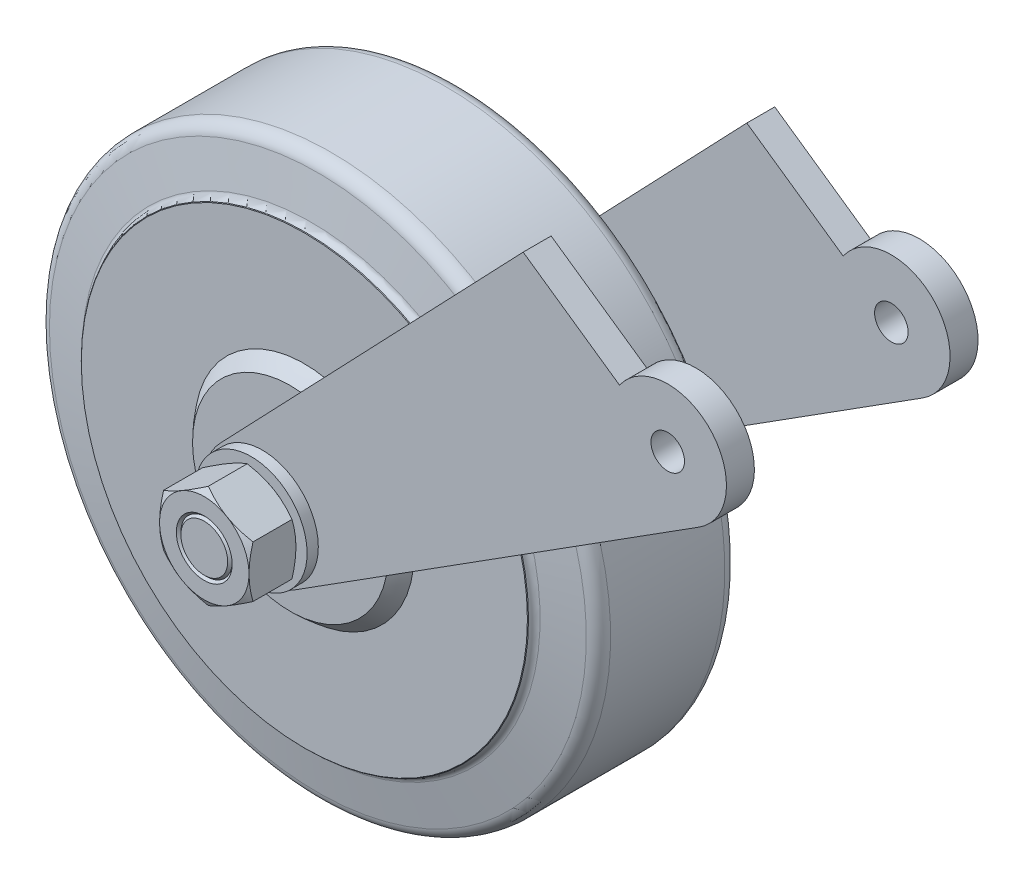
ISO-10303-21;
HEADER;
FILE_DESCRIPTION(('STEP AP214'),'2;1');
FILE_NAME('part.step','',(''),(''),'','','');
FILE_SCHEMA(('AUTOMOTIVE_DESIGN { 1 0 10303 214 1 1 1 1 }'));
ENDSEC;
DATA;
#1=APPLICATION_CONTEXT('core data for automotive mechanical design processes');
#2=APPLICATION_PROTOCOL_DEFINITION('international standard','automotive_design',2000,#1);
#3=PRODUCT_CONTEXT('',#1,'mechanical');
#4=PRODUCT('Part','Part','',(#3));
#5=PRODUCT_RELATED_PRODUCT_CATEGORY('part','',(#4));
#6=PRODUCT_DEFINITION_FORMATION('','',#4);
#7=PRODUCT_DEFINITION_CONTEXT('part definition',#1,'design');
#8=PRODUCT_DEFINITION('design','',#6,#7);
#9=PRODUCT_DEFINITION_SHAPE('','',#8);
#10=(LENGTH_UNIT() NAMED_UNIT(*) SI_UNIT(.MILLI.,.METRE.));
#11=(NAMED_UNIT(*) PLANE_ANGLE_UNIT() SI_UNIT($,.RADIAN.));
#12=(NAMED_UNIT(*) SI_UNIT($,.STERADIAN.) SOLID_ANGLE_UNIT());
#13=UNCERTAINTY_MEASURE_WITH_UNIT(LENGTH_MEASURE(1.E-05),#10,'distance_accuracy_value','');
#14=(GEOMETRIC_REPRESENTATION_CONTEXT(3) GLOBAL_UNCERTAINTY_ASSIGNED_CONTEXT((#13)) GLOBAL_UNIT_ASSIGNED_CONTEXT((#10,
#11,#12)) REPRESENTATION_CONTEXT('',''));
#15=CARTESIAN_POINT('',(0.,0.,0.));
#16=DIRECTION('',(0.,0.,1.));
#17=DIRECTION('',(1.,0.,0.));
#18=AXIS2_PLACEMENT_3D('',#15,#16,#17);
#19=CARTESIAN_POINT('',(-45.,-110.,-17.5));
#20=DIRECTION('',(0.,0.,-1.));
#21=DIRECTION('',(-1.,0.,0.));
#22=AXIS2_PLACEMENT_3D('',#19,#20,#21);
#23=PLANE('',#22);
#24=CARTESIAN_POINT('',(-45.,-110.,-17.5));
#25=DIRECTION('',(0.,0.,1.));
#26=DIRECTION('',(1.,0.,0.));
#27=AXIS2_PLACEMENT_3D('',#24,#25,#26);
#28=CIRCLE('',#27,10.5);
#29=CARTESIAN_POINT('',(-52.5900724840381,-102.744602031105,-17.5));
#30=VERTEX_POINT('',#29);
#31=CARTESIAN_POINT('',(-39.3746816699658,-118.86599084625,-17.5));
#32=VERTEX_POINT('',#31);
#33=EDGE_CURVE('E33',#30,#32,#28,.T.);
#34=ORIENTED_EDGE('',*,*,#33,.T.);
#35=DIRECTION('',(0.844380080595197,0.535744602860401,0.));
#36=VECTOR('',#35,1.);
#37=CARTESIAN_POINT('',(-39.3746816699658,-118.86599084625,-17.5));
#38=LINE('',#37,#36);
#39=CARTESIAN_POINT('',(-27.5533605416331,-111.365566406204,-17.5));
#40=VERTEX_POINT('',#39);
#41=EDGE_CURVE('E283',#32,#40,#38,.T.);
#42=ORIENTED_EDGE('',*,*,#41,.T.);
#43=CARTESIAN_POINT('',(-45.,-110.,-17.5));
#44=DIRECTION('',(0.,0.,1.));
#45=DIRECTION('',(1.,0.,0.));
#46=AXIS2_PLACEMENT_3D('',#43,#44,#45);
#47=CIRCLE('',#46,17.5);
#48=CARTESIAN_POINT('',(-42.9162085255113,-92.6245053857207,-17.5));
#49=VERTEX_POINT('',#48);
#50=EDGE_CURVE('E910',#40,#49,#47,.F.);
#51=ORIENTED_EDGE('',*,*,#50,.T.);
#52=DIRECTION('',(-0.690990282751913,-0.722864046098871,0.));
#53=VECTOR('',#52,1.);
#54=CARTESIAN_POINT('',(1.64148614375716,-46.0114686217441,-17.5));
#55=LINE('',#54,#53);
#56=EDGE_CURVE('E38',#49,#30,#55,.T.);
#57=ORIENTED_EDGE('',*,*,#56,.T.);
#58=EDGE_LOOP('',(#34,#42,#51,#57));
#59=FACE_BOUND('',#58,.T.);
#60=ADVANCED_FACE('F17',(#59),#23,.T.);
#61=CARTESIAN_POINT('',(-45.,-110.,17.5));
#62=DIRECTION('',(0.,0.,-1.));
#63=DIRECTION('',(-1.,0.,0.));
#64=AXIS2_PLACEMENT_3D('',#61,#62,#63);
#65=PLANE('',#64);
#66=DIRECTION('',(0.844380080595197,0.535744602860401,0.));
#67=VECTOR('',#66,1.);
#68=CARTESIAN_POINT('',(-39.3746816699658,-118.86599084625,17.5));
#69=LINE('',#68,#67);
#70=CARTESIAN_POINT('',(-39.3746816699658,-118.86599084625,17.5));
#71=VERTEX_POINT('',#70);
#72=CARTESIAN_POINT('',(-27.5533605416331,-111.365566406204,17.5));
#73=VERTEX_POINT('',#72);
#74=EDGE_CURVE('E356',#71,#73,#69,.T.);
#75=ORIENTED_EDGE('',*,*,#74,.F.);
#76=CARTESIAN_POINT('',(-45.,-110.,17.5));
#77=DIRECTION('',(0.,0.,1.));
#78=DIRECTION('',(1.,0.,0.));
#79=AXIS2_PLACEMENT_3D('',#76,#77,#78);
#80=CIRCLE('',#79,10.5);
#81=CARTESIAN_POINT('',(-52.5900724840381,-102.744602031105,17.5));
#82=VERTEX_POINT('',#81);
#83=EDGE_CURVE('E339',#82,#71,#80,.T.);
#84=ORIENTED_EDGE('',*,*,#83,.F.);
#85=DIRECTION('',(-0.690990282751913,-0.722864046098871,0.));
#86=VECTOR('',#85,1.);
#87=CARTESIAN_POINT('',(1.64148614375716,-46.0114686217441,17.5));
#88=LINE('',#87,#86);
#89=CARTESIAN_POINT('',(-42.9162085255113,-92.6245053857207,17.5));
#90=VERTEX_POINT('',#89);
#91=EDGE_CURVE('E347',#90,#82,#88,.T.);
#92=ORIENTED_EDGE('',*,*,#91,.F.);
#93=CARTESIAN_POINT('',(-45.,-110.,17.5));
#94=DIRECTION('',(0.,0.,-1.));
#95=DIRECTION('',(-1.,0.,0.));
#96=AXIS2_PLACEMENT_3D('',#93,#94,#95);
#97=CIRCLE('',#96,17.5);
#98=EDGE_CURVE('E991',#73,#90,#97,.T.);
#99=ORIENTED_EDGE('',*,*,#98,.F.);
#100=EDGE_LOOP('',(#75,#84,#92,#99));
#101=FACE_BOUND('',#100,.T.);
#102=ADVANCED_FACE('F546',(#101),#65,.F.);
#103=CARTESIAN_POINT('',(-45.,-110.,15.));
#104=DIRECTION('',(0.,0.,-1.));
#105=DIRECTION('',(-1.,0.,0.));
#106=AXIS2_PLACEMENT_3D('',#103,#104,#105);
#107=TOROIDAL_SURFACE('',#106,41.2,1.2);
#108=CARTESIAN_POINT('',(-45.,-110.,14.9038576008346));
#109=DIRECTION('',(0.,0.,1.));
#110=DIRECTION('',(1.,0.,0.));
#111=AXIS2_PLACEMENT_3D('',#108,#109,#110);
#112=CIRCLE('',#111,40.0038576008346);
#113=CARTESIAN_POINT('',(-4.9961423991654,-110.,14.9038576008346));
#114=VERTEX_POINT('',#113);
#115=EDGE_CURVE('E909',#114,#114,#112,.T.);
#116=ORIENTED_EDGE('',*,*,#115,.F.);
#117=EDGE_LOOP('',(#116));
#118=FACE_BOUND('',#117,.T.);
#119=CARTESIAN_POINT('',(-45.,-110.,13.8182306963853));
#120=DIRECTION('',(0.,0.,-1.));
#121=DIRECTION('',(-1.,0.,0.));
#122=AXIS2_PLACEMENT_3D('',#119,#120,#121);
#123=CIRCLE('',#122,40.9916221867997);
#124=CARTESIAN_POINT('',(-85.9916221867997,-110.,13.8182306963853));
#125=VERTEX_POINT('',#124);
#126=EDGE_CURVE('E971',#125,#125,#123,.T.);
#127=ORIENTED_EDGE('',*,*,#126,.F.);
#128=EDGE_LOOP('',(#127));
#129=FACE_BOUND('',#128,.T.);
#130=ADVANCED_FACE('F552',(#118,#129),#107,.F.);
#131=CARTESIAN_POINT('',(-45.,-110.,12.5795101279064));
#132=DIRECTION('',(0.,0.,-1.));
#133=DIRECTION('',(-1.,0.,0.));
#134=AXIS2_PLACEMENT_3D('',#131,#132,#133);
#135=CONICAL_SURFACE('',#134,48.0167556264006,1.39626340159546);
#136=ORIENTED_EDGE('',*,*,#126,.T.);
#137=EDGE_LOOP('',(#136));
#138=FACE_BOUND('',#137,.T.);
#139=CARTESIAN_POINT('',(-45.,-110.,12.5795101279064));
#140=DIRECTION('',(0.,0.,-1.));
#141=DIRECTION('',(-1.,0.,0.));
#142=AXIS2_PLACEMENT_3D('',#139,#140,#141);
#143=CIRCLE('',#142,48.0167556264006);
#144=CARTESIAN_POINT('',(-93.0167556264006,-110.,12.5795101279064));
#145=VERTEX_POINT('',#144);
#146=EDGE_CURVE('E967',#145,#145,#143,.T.);
#147=ORIENTED_EDGE('',*,*,#146,.F.);
#148=EDGE_LOOP('',(#147));
#149=FACE_BOUND('',#148,.T.);
#150=ADVANCED_FACE('F558',(#138,#149),#135,.T.);
#151=CARTESIAN_POINT('',(-45.,-110.,10.2159715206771));
#152=DIRECTION('',(0.,0.,-1.));
#153=DIRECTION('',(-1.,0.,0.));
#154=AXIS2_PLACEMENT_3D('',#151,#152,#153);
#155=TOROIDAL_SURFACE('',#154,47.6,2.4);
#156=CARTESIAN_POINT('',(-45.,-110.,10.2159715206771));
#157=DIRECTION('',(0.,0.,-1.));
#158=DIRECTION('',(-1.,0.,0.));
#159=AXIS2_PLACEMENT_3D('',#156,#157,#158);
#160=CIRCLE('',#159,50.);
#161=CARTESIAN_POINT('',(-95.,-110.,10.2159715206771));
#162=VERTEX_POINT('',#161);
#163=EDGE_CURVE('E963',#162,#162,#160,.T.);
#164=ORIENTED_EDGE('',*,*,#163,.F.);
#165=EDGE_LOOP('',(#164));
#166=FACE_BOUND('',#165,.T.);
#167=ORIENTED_EDGE('',*,*,#146,.T.);
#168=EDGE_LOOP('',(#167));
#169=FACE_BOUND('',#168,.T.);
#170=ADVANCED_FACE('F593',(#166,#169),#155,.T.);
#171=CARTESIAN_POINT('',(-45.,-110.,-17.5));
#172=DIRECTION('',(0.,0.,-1.));
#173=DIRECTION('',(-1.,0.,0.));
#174=AXIS2_PLACEMENT_3D('',#171,#172,#173);
#175=CYLINDRICAL_SURFACE('',#174,50.);
#176=ORIENTED_EDGE('',*,*,#163,.T.);
#177=EDGE_LOOP('',(#176));
#178=FACE_BOUND('',#177,.T.);
#179=CARTESIAN_POINT('',(-45.,-110.,-10.2159715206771));
#180=DIRECTION('',(0.,0.,-1.));
#181=DIRECTION('',(-1.,0.,0.));
#182=AXIS2_PLACEMENT_3D('',#179,#180,#181);
#183=CIRCLE('',#182,50.);
#184=CARTESIAN_POINT('',(-95.,-110.,-10.2159715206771));
#185=VERTEX_POINT('',#184);
#186=EDGE_CURVE('E959',#185,#185,#183,.T.);
#187=ORIENTED_EDGE('',*,*,#186,.F.);
#188=EDGE_LOOP('',(#187));
#189=FACE_BOUND('',#188,.T.);
#190=ADVANCED_FACE('F597',(#178,#189),#175,.T.);
#191=CARTESIAN_POINT('',(-45.,-110.,-10.2159715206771));
#192=DIRECTION('',(0.,0.,-1.));
#193=DIRECTION('',(-1.,0.,0.));
#194=AXIS2_PLACEMENT_3D('',#191,#192,#193);
#195=TOROIDAL_SURFACE('',#194,47.6,2.4);
#196=CARTESIAN_POINT('',(-45.,-110.,-12.5795101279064));
#197=DIRECTION('',(0.,0.,-1.));
#198=DIRECTION('',(-1.,0.,0.));
#199=AXIS2_PLACEMENT_3D('',#196,#197,#198);
#200=CIRCLE('',#199,48.0167556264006);
#201=CARTESIAN_POINT('',(-93.0167556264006,-110.,-12.5795101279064));
#202=VERTEX_POINT('',#201);
#203=EDGE_CURVE('E955',#202,#202,#200,.T.);
#204=ORIENTED_EDGE('',*,*,#203,.F.);
#205=EDGE_LOOP('',(#204));
#206=FACE_BOUND('',#205,.T.);
#207=ORIENTED_EDGE('',*,*,#186,.T.);
#208=EDGE_LOOP('',(#207));
#209=FACE_BOUND('',#208,.T.);
#210=ADVANCED_FACE('F601',(#206,#209),#195,.T.);
#211=CARTESIAN_POINT('',(-45.,-110.,-12.5795101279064));
#212=DIRECTION('',(0.,0.,1.));
#213=DIRECTION('',(1.,0.,0.));
#214=AXIS2_PLACEMENT_3D('',#211,#212,#213);
#215=CONICAL_SURFACE('',#214,48.0167556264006,1.39626340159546);
#216=CARTESIAN_POINT('',(-45.,-110.,-13.8182306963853));
#217=DIRECTION('',(0.,0.,-1.));
#218=DIRECTION('',(-1.,0.,0.));
#219=AXIS2_PLACEMENT_3D('',#216,#217,#218);
#220=CIRCLE('',#219,40.9916221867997);
#221=CARTESIAN_POINT('',(-85.9916221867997,-110.,-13.8182306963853));
#222=VERTEX_POINT('',#221);
#223=EDGE_CURVE('E951',#222,#222,#220,.T.);
#224=ORIENTED_EDGE('',*,*,#223,.F.);
#225=EDGE_LOOP('',(#224));
#226=FACE_BOUND('',#225,.T.);
#227=ORIENTED_EDGE('',*,*,#203,.T.);
#228=EDGE_LOOP('',(#227));
#229=FACE_BOUND('',#228,.T.);
#230=ADVANCED_FACE('F605',(#226,#229),#215,.T.);
#231=CARTESIAN_POINT('',(-45.,-110.,-15.));
#232=DIRECTION('',(0.,0.,-1.));
#233=DIRECTION('',(-1.,0.,0.));
#234=AXIS2_PLACEMENT_3D('',#231,#232,#233);
#235=TOROIDAL_SURFACE('',#234,41.2,1.2);
#236=CARTESIAN_POINT('',(-45.,-110.,-14.9038576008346));
#237=DIRECTION('',(0.,0.,-1.));
#238=DIRECTION('',(-1.,0.,0.));
#239=AXIS2_PLACEMENT_3D('',#236,#237,#238);
#240=CIRCLE('',#239,40.0038576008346);
#241=CARTESIAN_POINT('',(-85.0038576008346,-110.,-14.9038576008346));
#242=VERTEX_POINT('',#241);
#243=EDGE_CURVE('E900',#242,#242,#240,.T.);
#244=ORIENTED_EDGE('',*,*,#243,.F.);
#245=EDGE_LOOP('',(#244));
#246=FACE_BOUND('',#245,.T.);
#247=ORIENTED_EDGE('',*,*,#223,.T.);
#248=EDGE_LOOP('',(#247));
#249=FACE_BOUND('',#248,.T.);
#250=ADVANCED_FACE('F609',(#246,#249),#235,.F.);
#251=CARTESIAN_POINT('',(-45.,-110.,15.));
#252=DIRECTION('',(0.,0.,-1.));
#253=DIRECTION('',(-1.,0.,0.));
#254=AXIS2_PLACEMENT_3D('',#251,#252,#253);
#255=CONICAL_SURFACE('',#254,39.9,0.785398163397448);
#256=CARTESIAN_POINT('',(-45.,-110.,14.9));
#257=DIRECTION('',(0.,0.,-1.));
#258=DIRECTION('',(-1.,0.,0.));
#259=AXIS2_PLACEMENT_3D('',#256,#257,#258);
#260=CIRCLE('',#259,40.);
#261=CARTESIAN_POINT('',(-85.,-110.,14.9));
#262=VERTEX_POINT('',#261);
#263=EDGE_CURVE('E901',#262,#262,#260,.T.);
#264=ORIENTED_EDGE('',*,*,#263,.F.);
#265=EDGE_LOOP('',(#264));
#266=FACE_BOUND('',#265,.T.);
#267=CARTESIAN_POINT('',(-45.,-110.,15.));
#268=DIRECTION('',(0.,0.,-1.));
#269=DIRECTION('',(-1.,0.,0.));
#270=AXIS2_PLACEMENT_3D('',#267,#268,#269);
#271=CIRCLE('',#270,39.9);
#272=CARTESIAN_POINT('',(-84.9,-110.,15.));
#273=VERTEX_POINT('',#272);
#274=EDGE_CURVE('E905',#273,#273,#271,.T.);
#275=ORIENTED_EDGE('',*,*,#274,.T.);
#276=EDGE_LOOP('',(#275));
#277=FACE_BOUND('',#276,.T.);
#278=ADVANCED_FACE('F613',(#266,#277),#255,.T.);
#279=CARTESIAN_POINT('',(-45.,-110.,14.9));
#280=DIRECTION('',(0.,0.,1.));
#281=DIRECTION('',(1.,0.,0.));
#282=AXIS2_PLACEMENT_3D('',#279,#280,#281);
#283=CONICAL_SURFACE('',#282,40.,0.785398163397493);
#284=ORIENTED_EDGE('',*,*,#115,.T.);
#285=EDGE_LOOP('',(#284));
#286=FACE_BOUND('',#285,.T.);
#287=ORIENTED_EDGE('',*,*,#263,.T.);
#288=EDGE_LOOP('',(#287));
#289=FACE_BOUND('',#288,.T.);
#290=ADVANCED_FACE('F648',(#286,#289),#283,.F.);
#291=CARTESIAN_POINT('',(-45.,-110.,0.353571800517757));
#292=DIRECTION('',(-1.,0.,0.));
#293=DIRECTION('',(0.,0.,1.));
#294=AXIS2_PLACEMENT_3D('',#291,#292,#293);
#295=SPHERICAL_SURFACE('',#294,24.5);
#296=CARTESIAN_POINT('',(-45.,-110.,0.353571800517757));
#297=DIRECTION('',(0.,0.,1.));
#298=DIRECTION('',(1.,0.,0.));
#299=AXIS2_PLACEMENT_3D('',#296,#297,#298);
#300=SPHERICAL_SURFACE('',#299,24.5);
#301=CARTESIAN_POINT('',(-45.,-110.,15.));
#302=DIRECTION('',(0.,0.,1.));
#303=DIRECTION('',(1.,0.,0.));
#304=AXIS2_PLACEMENT_3D('',#301,#302,#303);
#305=CIRCLE('',#304,19.640064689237);
#306=CARTESIAN_POINT('',(-25.359935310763,-110.,15.));
#307=VERTEX_POINT('',#306);
#308=EDGE_CURVE('E922',#307,#307,#305,.T.);
#309=ORIENTED_EDGE('',*,*,#308,.T.);
#310=EDGE_LOOP('',(#309));
#311=FACE_BOUND('',#310,.T.);
#312=EDGE_CURVE('E935',#90,#73,#97,.T.);
#313=ORIENTED_EDGE('',*,*,#312,.T.);
#314=ORIENTED_EDGE('',*,*,#98,.T.);
#315=EDGE_LOOP('',(#313,#314));
#316=FACE_BOUND('',#315,.T.);
#317=ADVANCED_FACE('F588',(#311,#316),#300,.T.);
#318=CARTESIAN_POINT('',(-45.,-74.5,15.));
#319=DIRECTION('',(0.,0.,-1.));
#320=DIRECTION('',(-1.,0.,0.));
#321=AXIS2_PLACEMENT_3D('',#318,#319,#320);
#322=PLANE('',#321);
#323=ORIENTED_EDGE('',*,*,#274,.F.);
#324=EDGE_LOOP('',(#323));
#325=FACE_BOUND('',#324,.T.);
#326=ORIENTED_EDGE('',*,*,#308,.F.);
#327=EDGE_LOOP('',(#326));
#328=FACE_BOUND('',#327,.T.);
#329=ADVANCED_FACE('F585',(#325,#328),#322,.F.);
#330=CARTESIAN_POINT('',(-45.,-110.,-15.));
#331=DIRECTION('',(0.,0.,1.));
#332=DIRECTION('',(1.,0.,0.));
#333=AXIS2_PLACEMENT_3D('',#330,#331,#332);
#334=CONICAL_SURFACE('',#333,39.9,0.785398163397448);
#335=CARTESIAN_POINT('',(-45.,-110.,-14.9));
#336=DIRECTION('',(0.,0.,1.));
#337=DIRECTION('',(1.,0.,0.));
#338=AXIS2_PLACEMENT_3D('',#335,#336,#337);
#339=CIRCLE('',#338,40.);
#340=CARTESIAN_POINT('',(-5.,-110.,-14.9));
#341=VERTEX_POINT('',#340);
#342=EDGE_CURVE('E892',#341,#341,#339,.T.);
#343=ORIENTED_EDGE('',*,*,#342,.F.);
#344=EDGE_LOOP('',(#343));
#345=FACE_BOUND('',#344,.T.);
#346=CARTESIAN_POINT('',(-45.,-110.,-15.));
#347=DIRECTION('',(0.,0.,1.));
#348=DIRECTION('',(1.,0.,0.));
#349=AXIS2_PLACEMENT_3D('',#346,#347,#348);
#350=CIRCLE('',#349,39.9);
#351=CARTESIAN_POINT('',(-5.1,-110.,-15.));
#352=VERTEX_POINT('',#351);
#353=EDGE_CURVE('E896',#352,#352,#350,.T.);
#354=ORIENTED_EDGE('',*,*,#353,.T.);
#355=EDGE_LOOP('',(#354));
#356=FACE_BOUND('',#355,.T.);
#357=ADVANCED_FACE('F587',(#345,#356),#334,.T.);
#358=CARTESIAN_POINT('',(-45.,-110.,-14.9));
#359=DIRECTION('',(0.,0.,-1.));
#360=DIRECTION('',(-1.,0.,0.));
#361=AXIS2_PLACEMENT_3D('',#358,#359,#360);
#362=CONICAL_SURFACE('',#361,40.,0.785398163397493);
#363=ORIENTED_EDGE('',*,*,#243,.T.);
#364=EDGE_LOOP('',(#363));
#365=FACE_BOUND('',#364,.T.);
#366=ORIENTED_EDGE('',*,*,#342,.T.);
#367=EDGE_LOOP('',(#366));
#368=FACE_BOUND('',#367,.T.);
#369=ADVANCED_FACE('F654',(#365,#368),#362,.F.);
#370=CARTESIAN_POINT('',(-45.,-110.,-0.353571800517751));
#371=DIRECTION('',(1.,0.,0.));
#372=DIRECTION('',(0.,0.,-1.));
#373=AXIS2_PLACEMENT_3D('',#370,#371,#372);
#374=SPHERICAL_SURFACE('',#373,24.5);
#375=CARTESIAN_POINT('',(-45.,-110.,-0.353571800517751));
#376=DIRECTION('',(0.,0.,-1.));
#377=DIRECTION('',(-1.,0.,0.));
#378=AXIS2_PLACEMENT_3D('',#375,#376,#377);
#379=SPHERICAL_SURFACE('',#378,24.5);
#380=CARTESIAN_POINT('',(-45.,-110.,-15.));
#381=DIRECTION('',(0.,0.,-1.));
#382=DIRECTION('',(-1.,0.,0.));
#383=AXIS2_PLACEMENT_3D('',#380,#381,#382);
#384=CIRCLE('',#383,19.640064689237);
#385=CARTESIAN_POINT('',(-64.6400646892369,-110.,-15.));
#386=VERTEX_POINT('',#385);
#387=EDGE_CURVE('E914',#386,#386,#384,.T.);
#388=ORIENTED_EDGE('',*,*,#387,.T.);
#389=EDGE_LOOP('',(#388));
#390=FACE_BOUND('',#389,.T.);
#391=ORIENTED_EDGE('',*,*,#50,.F.);
#392=CARTESIAN_POINT('',(-45.,-110.,-17.5));
#393=DIRECTION('',(0.,0.,1.));
#394=DIRECTION('',(1.,0.,0.));
#395=AXIS2_PLACEMENT_3D('',#392,#393,#394);
#396=CIRCLE('',#395,17.5);
#397=EDGE_CURVE('E329',#49,#40,#396,.F.);
#398=ORIENTED_EDGE('',*,*,#397,.F.);
#399=EDGE_LOOP('',(#391,#398));
#400=FACE_BOUND('',#399,.T.);
#401=ADVANCED_FACE('F619',(#390,#400),#379,.T.);
#402=CARTESIAN_POINT('',(-45.,-74.5,-15.));
#403=DIRECTION('',(0.,0.,-1.));
#404=DIRECTION('',(-1.,0.,0.));
#405=AXIS2_PLACEMENT_3D('',#402,#403,#404);
#406=PLANE('',#405);
#407=ORIENTED_EDGE('',*,*,#353,.F.);
#408=EDGE_LOOP('',(#407));
#409=FACE_BOUND('',#408,.T.);
#410=ORIENTED_EDGE('',*,*,#387,.F.);
#411=EDGE_LOOP('',(#410));
#412=FACE_BOUND('',#411,.T.);
#413=ADVANCED_FACE('F615',(#409,#412),#406,.T.);
#414=CARTESIAN_POINT('',(-39.3746816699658,-118.86599084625,22.5));
#415=DIRECTION('',(-0.535744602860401,0.844380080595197,0.));
#416=DIRECTION('',(-0.844380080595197,-0.535744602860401,0.));
#417=AXIS2_PLACEMENT_3D('',#414,#415,#416);
#418=PLANE('',#417);
#419=ORIENTED_EDGE('',*,*,#74,.T.);
#420=CARTESIAN_POINT('',(33.1253183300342,-72.8659908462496,17.5));
#421=VERTEX_POINT('',#420);
#422=EDGE_CURVE('E338',#73,#421,#69,.T.);
#423=ORIENTED_EDGE('',*,*,#422,.T.);
#424=DIRECTION('',(0.,0.,-1.));
#425=VECTOR('',#424,1.);
#426=CARTESIAN_POINT('',(33.1253183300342,-72.8659908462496,22.5));
#427=LINE('',#426,#425);
#428=CARTESIAN_POINT('',(33.1253183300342,-72.8659908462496,22.5));
#429=VERTEX_POINT('',#428);
#430=EDGE_CURVE('E376',#429,#421,#427,.T.);
#431=ORIENTED_EDGE('',*,*,#430,.F.);
#432=DIRECTION('',(0.844380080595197,0.535744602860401,0.));
#433=VECTOR('',#432,1.);
#434=CARTESIAN_POINT('',(-39.3746816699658,-118.86599084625,22.5));
#435=LINE('',#434,#433);
#436=CARTESIAN_POINT('',(-39.3746816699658,-118.86599084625,22.5));
#437=VERTEX_POINT('',#436);
#438=EDGE_CURVE('E342',#437,#429,#435,.T.);
#439=ORIENTED_EDGE('',*,*,#438,.F.);
#440=DIRECTION('',(0.,0.,-1.));
#441=VECTOR('',#440,1.);
#442=CARTESIAN_POINT('',(-39.3746816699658,-118.86599084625,22.5));
#443=LINE('',#442,#441);
#444=EDGE_CURVE('E362',#437,#71,#443,.T.);
#445=ORIENTED_EDGE('',*,*,#444,.T.);
#446=EDGE_LOOP('',(#419,#423,#431,#439,#445));
#447=FACE_BOUND('',#446,.T.);
#448=ADVANCED_FACE('F618',(#447),#418,.F.);
#449=CARTESIAN_POINT('',(27.5,-64.,22.5));
#450=DIRECTION('',(0.,0.,-1.));
#451=DIRECTION('',(-1.,0.,0.));
#452=AXIS2_PLACEMENT_3D('',#449,#450,#451);
#453=CYLINDRICAL_SURFACE('',#452,10.5);
#454=CARTESIAN_POINT('',(27.5,-64.,17.5));
#455=DIRECTION('',(0.,0.,1.));
#456=DIRECTION('',(1.,0.,0.));
#457=AXIS2_PLACEMENT_3D('',#454,#455,#456);
#458=CIRCLE('',#457,10.5);
#459=CARTESIAN_POINT('',(18.8804953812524,-58.0038228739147,17.5));
#460=VERTEX_POINT('',#459);
#461=EDGE_CURVE('E352',#421,#460,#458,.T.);
#462=ORIENTED_EDGE('',*,*,#461,.T.);
#463=DIRECTION('',(0.,0.,-1.));
#464=VECTOR('',#463,1.);
#465=CARTESIAN_POINT('',(18.8804953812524,-58.0038228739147,22.5));
#466=LINE('',#465,#464);
#467=CARTESIAN_POINT('',(18.8804953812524,-58.0038228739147,22.5));
#468=VERTEX_POINT('',#467);
#469=EDGE_CURVE('E381',#468,#460,#466,.T.);
#470=ORIENTED_EDGE('',*,*,#469,.F.);
#471=CARTESIAN_POINT('',(27.5,-64.,22.5));
#472=DIRECTION('',(0.,0.,1.));
#473=DIRECTION('',(1.,0.,0.));
#474=AXIS2_PLACEMENT_3D('',#471,#472,#473);
#475=CIRCLE('',#474,10.5);
#476=EDGE_CURVE('E370',#429,#468,#475,.T.);
#477=ORIENTED_EDGE('',*,*,#476,.F.);
#478=ORIENTED_EDGE('',*,*,#430,.T.);
#479=EDGE_LOOP('',(#462,#470,#477,#478));
#480=FACE_BOUND('',#479,.T.);
#481=ADVANCED_FACE('F1945',(#480),#453,.T.);
#482=CARTESIAN_POINT('',(1.64148614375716,-46.0114686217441,22.5));
#483=DIRECTION('',(0.5710644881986,0.820905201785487,0.));
#484=DIRECTION('',(-0.820905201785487,0.5710644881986,0.));
#485=AXIS2_PLACEMENT_3D('',#482,#483,#484);
#486=PLANE('',#485);
#487=DIRECTION('',(0.820905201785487,-0.5710644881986,0.));
#488=VECTOR('',#487,1.);
#489=CARTESIAN_POINT('',(1.64148614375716,-46.0114686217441,17.5));
#490=LINE('',#489,#488);
#491=CARTESIAN_POINT('',(1.64148614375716,-46.0114686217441,17.5));
#492=VERTEX_POINT('',#491);
#493=EDGE_CURVE('E348',#492,#460,#490,.T.);
#494=ORIENTED_EDGE('',*,*,#493,.F.);
#495=DIRECTION('',(0.,0.,-1.));
#496=VECTOR('',#495,1.);
#497=CARTESIAN_POINT('',(1.64148614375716,-46.0114686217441,22.5));
#498=LINE('',#497,#496);
#499=CARTESIAN_POINT('',(1.64148614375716,-46.0114686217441,22.5));
#500=VERTEX_POINT('',#499);
#501=EDGE_CURVE('E384',#500,#492,#498,.T.);
#502=ORIENTED_EDGE('',*,*,#501,.F.);
#503=DIRECTION('',(0.820905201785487,-0.5710644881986,0.));
#504=VECTOR('',#503,1.);
#505=CARTESIAN_POINT('',(1.64148614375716,-46.0114686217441,22.5));
#506=LINE('',#505,#504);
#507=EDGE_CURVE('E366',#500,#468,#506,.T.);
#508=ORIENTED_EDGE('',*,*,#507,.T.);
#509=ORIENTED_EDGE('',*,*,#469,.T.);
#510=EDGE_LOOP('',(#494,#502,#508,#509));
#511=FACE_BOUND('',#510,.T.);
#512=ADVANCED_FACE('F1934',(#511),#486,.T.);
#513=CARTESIAN_POINT('',(1.64148614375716,-46.0114686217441,22.5));
#514=DIRECTION('',(0.722864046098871,-0.690990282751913,0.));
#515=DIRECTION('',(0.690990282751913,0.722864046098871,0.));
#516=AXIS2_PLACEMENT_3D('',#513,#514,#515);
#517=PLANE('',#516);
#518=EDGE_CURVE('E343',#492,#90,#88,.T.);
#519=ORIENTED_EDGE('',*,*,#518,.T.);
#520=ORIENTED_EDGE('',*,*,#91,.T.);
#521=DIRECTION('',(0.,0.,-1.));
#522=VECTOR('',#521,1.);
#523=CARTESIAN_POINT('',(-52.5900724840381,-102.744602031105,22.5));
#524=LINE('',#523,#522);
#525=CARTESIAN_POINT('',(-52.5900724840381,-102.744602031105,22.5));
#526=VERTEX_POINT('',#525);
#527=EDGE_CURVE('E387',#526,#82,#524,.T.);
#528=ORIENTED_EDGE('',*,*,#527,.F.);
#529=DIRECTION('',(-0.690990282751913,-0.722864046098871,0.));
#530=VECTOR('',#529,1.);
#531=CARTESIAN_POINT('',(1.64148614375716,-46.0114686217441,22.5));
#532=LINE('',#531,#530);
#533=EDGE_CURVE('E363',#500,#526,#532,.T.);
#534=ORIENTED_EDGE('',*,*,#533,.F.);
#535=ORIENTED_EDGE('',*,*,#501,.T.);
#536=EDGE_LOOP('',(#519,#520,#528,#534,#535));
#537=FACE_BOUND('',#536,.T.);
#538=ADVANCED_FACE('F1922',(#537),#517,.F.);
#539=CARTESIAN_POINT('',(-45.,-110.,22.5));
#540=DIRECTION('',(0.,0.,-1.));
#541=DIRECTION('',(-1.,0.,0.));
#542=AXIS2_PLACEMENT_3D('',#539,#540,#541);
#543=CYLINDRICAL_SURFACE('',#542,10.5);
#544=ORIENTED_EDGE('',*,*,#83,.T.);
#545=ORIENTED_EDGE('',*,*,#444,.F.);
#546=CARTESIAN_POINT('',(-45.,-110.,22.5));
#547=DIRECTION('',(0.,0.,1.));
#548=DIRECTION('',(1.,0.,0.));
#549=AXIS2_PLACEMENT_3D('',#546,#547,#548);
#550=CIRCLE('',#549,10.5);
#551=EDGE_CURVE('E359',#526,#437,#550,.T.);
#552=ORIENTED_EDGE('',*,*,#551,.F.);
#553=ORIENTED_EDGE('',*,*,#527,.T.);
#554=EDGE_LOOP('',(#544,#545,#552,#553));
#555=FACE_BOUND('',#554,.T.);
#556=ADVANCED_FACE('F1911',(#555),#543,.T.);
#557=CARTESIAN_POINT('',(27.5,-64.,22.5));
#558=DIRECTION('',(0.,0.,1.));
#559=DIRECTION('',(1.,0.,0.));
#560=AXIS2_PLACEMENT_3D('',#557,#558,#559);
#561=PLANE('',#560);
#562=CARTESIAN_POINT('',(-45.,-110.,22.5));
#563=DIRECTION('',(0.,0.,1.));
#564=DIRECTION('',(1.,0.,0.));
#565=AXIS2_PLACEMENT_3D('',#562,#563,#564);
#566=CIRCLE('',#565,10.);
#567=CARTESIAN_POINT('',(-35.,-110.,22.5));
#568=VERTEX_POINT('',#567);
#569=EDGE_CURVE('E380',#568,#568,#566,.F.);
#570=ORIENTED_EDGE('',*,*,#569,.T.);
#571=EDGE_LOOP('',(#570));
#572=FACE_BOUND('',#571,.T.);
#573=CARTESIAN_POINT('',(27.5,-64.,22.5));
#574=DIRECTION('',(0.,0.,1.));
#575=DIRECTION('',(1.,0.,0.));
#576=AXIS2_PLACEMENT_3D('',#573,#574,#575);
#577=CIRCLE('',#576,3.);
#578=CARTESIAN_POINT('',(30.5,-64.,22.5));
#579=VERTEX_POINT('',#578);
#580=EDGE_CURVE('E334',#579,#579,#577,.T.);
#581=ORIENTED_EDGE('',*,*,#580,.F.);
#582=EDGE_LOOP('',(#581));
#583=FACE_BOUND('',#582,.T.);
#584=ORIENTED_EDGE('',*,*,#438,.T.);
#585=ORIENTED_EDGE('',*,*,#476,.T.);
#586=ORIENTED_EDGE('',*,*,#507,.F.);
#587=ORIENTED_EDGE('',*,*,#533,.T.);
#588=ORIENTED_EDGE('',*,*,#551,.T.);
#589=EDGE_LOOP('',(#584,#585,#586,#587,#588));
#590=FACE_BOUND('',#589,.T.);
#591=ADVANCED_FACE('F1899',(#572,#583,#590),#561,.T.);
#592=CARTESIAN_POINT('',(27.5,-64.,17.5));
#593=DIRECTION('',(0.,0.,1.));
#594=DIRECTION('',(1.,0.,0.));
#595=AXIS2_PLACEMENT_3D('',#592,#593,#594);
#596=PLANE('',#595);
#597=ORIENTED_EDGE('',*,*,#312,.F.);
#598=ORIENTED_EDGE('',*,*,#518,.F.);
#599=ORIENTED_EDGE('',*,*,#493,.T.);
#600=ORIENTED_EDGE('',*,*,#461,.F.);
#601=ORIENTED_EDGE('',*,*,#422,.F.);
#602=EDGE_LOOP('',(#597,#598,#599,#600,#601));
#603=FACE_BOUND('',#602,.T.);
#604=CARTESIAN_POINT('',(27.5,-64.,17.5));
#605=DIRECTION('',(0.,0.,1.));
#606=DIRECTION('',(1.,0.,0.));
#607=AXIS2_PLACEMENT_3D('',#604,#605,#606);
#608=CIRCLE('',#607,3.);
#609=CARTESIAN_POINT('',(30.5,-64.,17.5));
#610=VERTEX_POINT('',#609);
#611=EDGE_CURVE('E333',#610,#610,#608,.T.);
#612=ORIENTED_EDGE('',*,*,#611,.T.);
#613=EDGE_LOOP('',(#612));
#614=FACE_BOUND('',#613,.T.);
#615=ADVANCED_FACE('F1888',(#603,#614),#596,.F.);
#616=CARTESIAN_POINT('',(27.5,-64.,0.));
#617=DIRECTION('',(0.,0.,1.));
#618=DIRECTION('',(0.,-1.,0.));
#619=AXIS2_PLACEMENT_3D('',#616,#617,#618);
#620=CYLINDRICAL_SURFACE('',#619,3.);
#621=ORIENTED_EDGE('',*,*,#580,.T.);
#622=EDGE_LOOP('',(#621));
#623=FACE_BOUND('',#622,.T.);
#624=ORIENTED_EDGE('',*,*,#611,.F.);
#625=EDGE_LOOP('',(#624));
#626=FACE_BOUND('',#625,.T.);
#627=ADVANCED_FACE('F672',(#623,#626),#620,.F.);
#628=CARTESIAN_POINT('',(-45.,-105.811875,32.9));
#629=DIRECTION('',(0.,0.,1.));
#630=DIRECTION('',(1.,0.,0.));
#631=AXIS2_PLACEMENT_3D('',#628,#629,#630);
#632=PLANE('',#631);
#633=CARTESIAN_POINT('',(-45.,-110.,32.9));
#634=DIRECTION('',(0.,0.,-1.));
#635=DIRECTION('',(-1.,0.,0.));
#636=AXIS2_PLACEMENT_3D('',#633,#634,#635);
#637=CIRCLE('',#636,4.188125);
#638=CARTESIAN_POINT('',(-49.188125,-110.,32.9));
#639=VERTEX_POINT('',#638);
#640=EDGE_CURVE('E888',#639,#639,#637,.T.);
#641=ORIENTED_EDGE('',*,*,#640,.F.);
#642=EDGE_LOOP('',(#641));
#643=FACE_BOUND('',#642,.T.);
#644=ADVANCED_FACE('F668',(#643),#632,.T.);
#645=CARTESIAN_POINT('',(-45.,-110.,32.088125));
#646=DIRECTION('',(0.,0.,-1.));
#647=DIRECTION('',(-1.,0.,0.));
#648=AXIS2_PLACEMENT_3D('',#645,#646,#647);
#649=CONICAL_SURFACE('',#648,5.,0.785398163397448);
#650=CARTESIAN_POINT('',(-45.,-110.,32.4940625));
#651=DIRECTION('',(0.,0.,1.));
#652=DIRECTION('',(0.,1.,0.));
#653=AXIS2_PLACEMENT_3D('',#650,#651,#652);
#654=CIRCLE('',#653,4.5940625);
#655=CARTESIAN_POINT('',(-45.,-105.4059375,32.4940625));
#656=VERTEX_POINT('',#655);
#657=EDGE_CURVE('E26',#656,#656,#654,.F.);
#658=ORIENTED_EDGE('',*,*,#657,.F.);
#659=EDGE_LOOP('',(#658));
#660=FACE_BOUND('',#659,.T.);
#661=ORIENTED_EDGE('',*,*,#640,.T.);
#662=EDGE_LOOP('',(#661));
#663=FACE_BOUND('',#662,.T.);
#664=ADVANCED_FACE('F671',(#660,#663),#649,.T.);
#665=CARTESIAN_POINT('',(-45.,-110.,32.9));
#666=DIRECTION('',(0.,0.,1.));
#667=DIRECTION('',(-1.,0.,0.));
#668=AXIS2_PLACEMENT_3D('',#665,#666,#667);
#669=CONICAL_SURFACE('',#668,5.,0.785398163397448);
#670=ORIENTED_EDGE('',*,*,#657,.T.);
#671=EDGE_LOOP('',(#670));
#672=FACE_BOUND('',#671,.T.);
#673=CARTESIAN_POINT('',(-45.,-110.,32.9));
#674=DIRECTION('',(0.,0.,-1.));
#675=DIRECTION('',(1.,0.,0.));
#676=AXIS2_PLACEMENT_3D('',#673,#674,#675);
#677=CIRCLE('',#676,5.);
#678=CARTESIAN_POINT('',(-40.,-110.,32.9));
#679=VERTEX_POINT('',#678);
#680=EDGE_CURVE('E1017',#679,#679,#677,.T.);
#681=ORIENTED_EDGE('',*,*,#680,.F.);
#682=EDGE_LOOP('',(#681));
#683=FACE_BOUND('',#682,.T.);
#684=ADVANCED_FACE('F676',(#672,#683),#669,.F.);
#685=CARTESIAN_POINT('',(-45.,-119.237604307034,32.9));
#686=DIRECTION('',(0.,0.,1.));
#687=DIRECTION('',(-1.,0.,0.));
#688=AXIS2_PLACEMENT_3D('',#685,#686,#687);
#689=PLANE('',#688);
#690=ORIENTED_EDGE('',*,*,#680,.T.);
#691=EDGE_LOOP('',(#690));
#692=FACE_BOUND('',#691,.T.);
#693=CARTESIAN_POINT('',(-45.,-110.,32.9));
#694=DIRECTION('',(0.,0.,1.));
#695=DIRECTION('',(-1.,0.,0.));
#696=AXIS2_PLACEMENT_3D('',#693,#694,#695);
#697=CIRCLE('',#696,8.);
#698=CARTESIAN_POINT('',(-49.,-103.071796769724,32.9));
#699=VERTEX_POINT('',#698);
#700=CARTESIAN_POINT('',(-53.,-110.,32.9));
#701=VERTEX_POINT('',#700);
#702=EDGE_CURVE('E862',#699,#701,#697,.T.);
#703=ORIENTED_EDGE('',*,*,#702,.T.);
#704=CARTESIAN_POINT('',(-49.,-116.928203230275,32.9));
#705=VERTEX_POINT('',#704);
#706=EDGE_CURVE('E875',#701,#705,#697,.T.);
#707=ORIENTED_EDGE('',*,*,#706,.T.);
#708=CARTESIAN_POINT('',(-41.,-116.928203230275,32.9));
#709=VERTEX_POINT('',#708);
#710=EDGE_CURVE('E2245',#705,#709,#697,.T.);
#711=ORIENTED_EDGE('',*,*,#710,.T.);
#712=CARTESIAN_POINT('',(-45.,-110.,32.9));
#713=DIRECTION('',(0.,0.,-1.));
#714=DIRECTION('',(1.,0.,0.));
#715=AXIS2_PLACEMENT_3D('',#712,#713,#714);
#716=CIRCLE('',#715,8.);
#717=CARTESIAN_POINT('',(-37.,-110.,32.9));
#718=VERTEX_POINT('',#717);
#719=EDGE_CURVE('E1020',#718,#709,#716,.T.);
#720=ORIENTED_EDGE('',*,*,#719,.F.);
#721=CARTESIAN_POINT('',(-41.,-103.071796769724,32.9));
#722=VERTEX_POINT('',#721);
#723=EDGE_CURVE('E2248',#718,#722,#697,.T.);
#724=ORIENTED_EDGE('',*,*,#723,.T.);
#725=EDGE_CURVE('E874',#722,#699,#697,.T.);
#726=ORIENTED_EDGE('',*,*,#725,.T.);
#727=EDGE_LOOP('',(#703,#707,#711,#720,#724,#726));
#728=FACE_BOUND('',#727,.T.);
#729=ADVANCED_FACE('F1014',(#692,#728),#689,.T.);
#730=CARTESIAN_POINT('',(-45.,-110.,32.1840856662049));
#731=DIRECTION('',(0.,0.,-1.));
#732=DIRECTION('',(1.,0.,0.));
#733=AXIS2_PLACEMENT_3D('',#730,#731,#732);
#734=CONICAL_SURFACE('',#733,9.24,1.0471975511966);
#735=ORIENTED_EDGE('',*,*,#710,.F.);
#736=CARTESIAN_POINT('',(-53.000002,-114.618800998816,32.1854681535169));
#737=CARTESIAN_POINT('',(-52.8241548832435,-114.720326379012,32.2440725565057));
#738=CARTESIAN_POINT('',(-52.6476521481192,-114.822230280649,32.3000170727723));
#739=CARTESIAN_POINT('',(-52.2932132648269,-115.026865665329,32.4058537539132));
#740=CARTESIAN_POINT('',(-52.1152765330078,-115.129597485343,32.455743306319));
#741=CARTESIAN_POINT('',(-51.5786175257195,-115.439437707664,32.5953500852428));
#742=CARTESIAN_POINT('',(-51.2177768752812,-115.647769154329,32.6747555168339));
#743=CARTESIAN_POINT('',(-50.6777858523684,-115.959533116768,32.7678658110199));
#744=CARTESIAN_POINT('',(-50.5002485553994,-116.062034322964,32.7943898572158));
#745=CARTESIAN_POINT('',(-50.1443711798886,-116.267500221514,32.8388652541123));
#746=CARTESIAN_POINT('',(-49.9660311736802,-116.370464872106,32.8568173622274));
#747=CARTESIAN_POINT('',(-49.6090441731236,-116.576571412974,32.8836939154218));
#748=CARTESIAN_POINT('',(-49.4303977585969,-116.679712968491,32.8926286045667));
#749=CARTESIAN_POINT('',(-49.0729400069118,-116.88609129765,32.9012787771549));
#750=CARTESIAN_POINT('',(-48.894128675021,-116.989328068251,32.900994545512));
#751=CARTESIAN_POINT('',(-48.5598471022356,-117.182325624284,32.8918488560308));
#752=CARTESIAN_POINT('',(-48.404353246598,-117.272100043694,32.8841030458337));
#753=CARTESIAN_POINT('',(-48.0937297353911,-117.451438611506,32.8617903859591));
#754=CARTESIAN_POINT('',(-47.9386001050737,-117.541002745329,32.8472230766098));
#755=CARTESIAN_POINT('',(-47.4738118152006,-117.809348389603,32.7936331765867));
#756=CARTESIAN_POINT('',(-47.1649758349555,-117.987654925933,32.7447293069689));
#757=CARTESIAN_POINT('',(-46.5440282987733,-118.346159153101,32.6224712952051));
#758=CARTESIAN_POINT('',(-46.2319959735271,-118.526311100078,32.5485990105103));
#759=CARTESIAN_POINT('',(-45.6125839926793,-118.883928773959,32.3809404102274));
#760=CARTESIAN_POINT('',(-45.3051964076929,-119.061399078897,32.2871934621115));
#761=CARTESIAN_POINT('',(-44.999998,-119.237605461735,32.1854681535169));
#762=B_SPLINE_CURVE_WITH_KNOTS('',3,(#736,#737,#738,#739,#740,#741,#742,#743,#744,#745,#746,
#747,#748,#749,#750,#751,#752,#753,#754,#755,#756,#757,#758,#759,#760,#761),.UNSPECIFIED.,.F.,
.F.,(4,2,2,2,2,2,2,2,2,2,2,2,4),(0.,0.633965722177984,1.26820400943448,2.5393153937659,
3.15930462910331,3.77923907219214,4.39846845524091,5.01767870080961,5.55669189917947,
6.09574142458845,7.17460809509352,8.2773988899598,9.37802536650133),.UNSPECIFIED.);
#763=CARTESIAN_POINT('',(-45.,-119.237604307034,32.1854688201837));
#764=VERTEX_POINT('',#763);
#765=EDGE_CURVE('E725',#705,#764,#762,.T.);
#766=ORIENTED_EDGE('',*,*,#765,.T.);
#767=CARTESIAN_POINT('',(-45.000002,-119.237605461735,32.1854681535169));
#768=CARTESIAN_POINT('',(-44.8241548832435,-119.136080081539,32.2440725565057));
#769=CARTESIAN_POINT('',(-44.6476521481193,-119.034176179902,32.3000170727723));
#770=CARTESIAN_POINT('',(-44.2932132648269,-118.829540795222,32.4058537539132));
#771=CARTESIAN_POINT('',(-44.1152765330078,-118.726808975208,32.455743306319));
#772=CARTESIAN_POINT('',(-43.5786175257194,-118.416968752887,32.5953500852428));
#773=CARTESIAN_POINT('',(-43.2177768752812,-118.208637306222,32.6747555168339));
#774=CARTESIAN_POINT('',(-42.6777858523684,-117.896873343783,32.7678658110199));
#775=CARTESIAN_POINT('',(-42.5002485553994,-117.794372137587,32.7943898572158));
#776=CARTESIAN_POINT('',(-42.1443711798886,-117.588906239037,32.8388652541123));
#777=CARTESIAN_POINT('',(-41.9660311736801,-117.485941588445,32.8568173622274));
#778=CARTESIAN_POINT('',(-41.6090441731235,-117.279835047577,32.8836939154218));
#779=CARTESIAN_POINT('',(-41.4303977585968,-117.17669349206,32.8926286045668));
#780=CARTESIAN_POINT('',(-41.0729400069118,-116.970315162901,32.9012787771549));
#781=CARTESIAN_POINT('',(-40.894128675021,-116.867078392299,32.900994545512));
#782=CARTESIAN_POINT('',(-40.5598471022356,-116.674080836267,32.8918488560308));
#783=CARTESIAN_POINT('',(-40.4043532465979,-116.584306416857,32.8841030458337));
#784=CARTESIAN_POINT('',(-40.0937297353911,-116.404967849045,32.8617903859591));
#785=CARTESIAN_POINT('',(-39.9386001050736,-116.315403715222,32.8472230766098));
#786=CARTESIAN_POINT('',(-39.4738118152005,-116.047058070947,32.7936331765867));
#787=CARTESIAN_POINT('',(-39.1649758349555,-115.868751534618,32.7447293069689));
#788=CARTESIAN_POINT('',(-38.5440282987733,-115.51024730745,32.6224712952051));
#789=CARTESIAN_POINT('',(-38.231995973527,-115.330095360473,32.5485990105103));
#790=CARTESIAN_POINT('',(-37.6125839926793,-114.972477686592,32.3809404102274));
#791=CARTESIAN_POINT('',(-37.3051964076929,-114.795007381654,32.2871934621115));
#792=CARTESIAN_POINT('',(-36.999998,-114.618800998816,32.1854681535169));
#793=B_SPLINE_CURVE_WITH_KNOTS('',3,(#767,#768,#769,#770,#771,#772,#773,#774,#775,#776,#777,
#778,#779,#780,#781,#782,#783,#784,#785,#786,#787,#788,#789,#790,#791,#792),.UNSPECIFIED.,.F.,
.F.,(4,2,2,2,2,2,2,2,2,2,2,2,4),(0.,0.633965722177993,1.26820400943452,2.53931539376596,
3.15930462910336,3.77923907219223,4.398468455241,5.01767870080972,5.55669189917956,
6.09574142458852,7.17460809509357,8.27739888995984,9.37802536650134),.UNSPECIFIED.);
#794=EDGE_CURVE('E735',#764,#709,#793,.T.);
#795=ORIENTED_EDGE('',*,*,#794,.T.);
#796=EDGE_LOOP('',(#735,#766,#795));
#797=FACE_BOUND('',#796,.T.);
#798=ADVANCED_FACE('F747',(#797),#734,.T.);
#799=ORIENTED_EDGE('',*,*,#719,.T.);
#800=CARTESIAN_POINT('',(-37.,-114.618802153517,32.1854688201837));
#801=VERTEX_POINT('',#800);
#802=EDGE_CURVE('E736',#709,#801,#793,.T.);
#803=ORIENTED_EDGE('',*,*,#802,.T.);
#804=CARTESIAN_POINT('',(-37.,-97.7500641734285,29.0716936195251));
#805=CARTESIAN_POINT('',(-37.,-98.1013109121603,29.241436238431));
#806=CARTESIAN_POINT('',(-37.,-98.453388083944,29.4094915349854));
#807=CARTESIAN_POINT('',(-37.,-99.1596523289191,29.741263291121));
#808=CARTESIAN_POINT('',(-37.,-99.5138397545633,29.9049789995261));
#809=CARTESIAN_POINT('',(-37.,-100.226686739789,30.227969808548));
#810=CARTESIAN_POINT('',(-37.,-100.5853602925,30.3872141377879));
#811=CARTESIAN_POINT('',(-37.,-101.305655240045,30.6988631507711));
#812=CARTESIAN_POINT('',(-37.,-101.667276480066,30.8512681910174));
#813=CARTESIAN_POINT('',(-37.,-102.398532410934,31.1492296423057));
#814=CARTESIAN_POINT('',(-37.,-102.768210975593,31.2946789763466));
#815=CARTESIAN_POINT('',(-37.,-103.51192744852,31.5741866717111));
#816=CARTESIAN_POINT('',(-37.,-103.885965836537,31.7082437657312));
#817=CARTESIAN_POINT('',(-37.,-104.638233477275,31.9613645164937));
#818=CARTESIAN_POINT('',(-37.,-105.016451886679,32.0804600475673));
#819=CARTESIAN_POINT('',(-37.,-105.778251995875,32.2997919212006));
#820=CARTESIAN_POINT('',(-37.,-106.161831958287,32.4000342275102));
#821=CARTESIAN_POINT('',(-37.,-106.934681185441,32.5767859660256));
#822=CARTESIAN_POINT('',(-37.,-107.323951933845,32.653289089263));
#823=CARTESIAN_POINT('',(-37.,-107.911283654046,32.7464089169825));
#824=CARTESIAN_POINT('',(-37.,-108.107655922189,32.7738450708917));
#825=CARTESIAN_POINT('',(-37.,-108.501321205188,32.820965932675));
#826=CARTESIAN_POINT('',(-37.,-108.698614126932,32.8406514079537));
#827=CARTESIAN_POINT('',(-37.,-109.092602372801,32.8717411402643));
#828=CARTESIAN_POINT('',(-37.,-109.289293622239,32.8831968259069));
#829=CARTESIAN_POINT('',(-37.,-109.682984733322,32.8977664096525));
#830=CARTESIAN_POINT('',(-37.,-109.879984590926,32.9008804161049));
#831=CARTESIAN_POINT('',(-37.,-110.273882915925,32.8986924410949));
#832=CARTESIAN_POINT('',(-37.,-110.470781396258,32.8933928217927));
#833=CARTESIAN_POINT('',(-37.,-110.864183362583,32.874509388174));
#834=CARTESIAN_POINT('',(-37.,-111.060686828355,32.8609251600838));
#835=CARTESIAN_POINT('',(-37.,-111.536944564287,32.8182452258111));
#836=CARTESIAN_POINT('',(-37.,-111.816332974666,32.7849989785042));
#837=CARTESIAN_POINT('',(-37.,-112.372968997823,32.7036044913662));
#838=CARTESIAN_POINT('',(-37.,-112.6502160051,32.6554521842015));
#839=CARTESIAN_POINT('',(-37.,-113.202340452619,32.5459533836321));
#840=CARTESIAN_POINT('',(-37.,-113.477215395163,32.4845944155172));
#841=CARTESIAN_POINT('',(-37.,-114.024137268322,32.3505544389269));
#842=CARTESIAN_POINT('',(-37.,-114.296184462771,32.2778744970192));
#843=CARTESIAN_POINT('',(-37.,-114.844151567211,32.121031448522));
#844=CARTESIAN_POINT('',(-37.,-115.120002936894,32.0366305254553));
#845=CARTESIAN_POINT('',(-37.,-115.668789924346,31.8594889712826));
#846=CARTESIAN_POINT('',(-37.,-115.9417274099,31.766754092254));
#847=CARTESIAN_POINT('',(-37.,-116.483591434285,31.5748601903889));
#848=CARTESIAN_POINT('',(-37.,-116.752531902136,31.4757402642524));
#849=CARTESIAN_POINT('',(-37.,-117.288326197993,31.2716823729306));
#850=CARTESIAN_POINT('',(-37.,-117.55517913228,31.1667420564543));
#851=CARTESIAN_POINT('',(-37.,-117.821062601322,31.0594673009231));
#852=B_SPLINE_CURVE_WITH_KNOTS('',3,(#804,#805,#806,#807,#808,#809,#810,#811,#812,#813,#814,
#815,#816,#817,#818,#819,#820,#821,#822,#823,#824,#825,#826,#827,#828,#829,#830,#831,#832,#833,
#834,#835,#836,#837,#838,#839,#840,#841,#842,#843,#844,#845,#846,#847,#848,#849,#850,#851),
.UNSPECIFIED.,.F.,.F.,(4,2,2,2,2,2,2,2,2,2,2,2,2,2,2,2,2,2,2,2,2,2,2,4),(0.,1.17034960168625,
2.34090048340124,3.51814962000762,4.69533732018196,5.88698015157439,7.07875537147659,
8.26794693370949,9.45676168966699,10.6458921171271,11.2406020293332,11.8352530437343,
12.4261549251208,13.0170491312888,13.6077774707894,14.1985353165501,15.0421438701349,
15.8859828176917,16.7306223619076,17.5751823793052,18.4404453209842,19.3051155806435,
20.1649189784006,21.0250722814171),.UNSPECIFIED.);
#853=EDGE_CURVE('E781',#801,#718,#852,.F.);
#854=ORIENTED_EDGE('',*,*,#853,.T.);
#855=EDGE_LOOP('',(#799,#803,#854));
#856=FACE_BOUND('',#855,.T.);
#857=ADVANCED_FACE('F1834',(#856),#734,.T.);
#858=ORIENTED_EDGE('',*,*,#723,.F.);
#859=CARTESIAN_POINT('',(-37.,-105.381197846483,32.1854688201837));
#860=VERTEX_POINT('',#859);
#861=EDGE_CURVE('E775',#718,#860,#852,.F.);
#862=ORIENTED_EDGE('',*,*,#861,.T.);
#863=CARTESIAN_POINT('',(-36.999998,-105.381199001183,32.1854681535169));
#864=CARTESIAN_POINT('',(-37.1758451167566,-105.279673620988,32.2440725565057));
#865=CARTESIAN_POINT('',(-37.3523478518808,-105.177769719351,32.3000170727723));
#866=CARTESIAN_POINT('',(-37.7067867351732,-104.973134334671,32.4058537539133));
#867=CARTESIAN_POINT('',(-37.8847234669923,-104.870402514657,32.455743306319));
#868=CARTESIAN_POINT('',(-38.4213824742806,-104.560562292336,32.5953500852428));
#869=CARTESIAN_POINT('',(-38.7822231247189,-104.352230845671,32.6747555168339));
#870=CARTESIAN_POINT('',(-39.3222141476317,-104.040466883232,32.7678658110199));
#871=CARTESIAN_POINT('',(-39.4997514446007,-103.937965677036,32.7943898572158));
#872=CARTESIAN_POINT('',(-39.8556288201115,-103.732499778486,32.8388652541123));
#873=CARTESIAN_POINT('',(-40.0339688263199,-103.629535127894,32.8568173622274));
#874=CARTESIAN_POINT('',(-40.3909558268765,-103.423428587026,32.8836939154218));
#875=CARTESIAN_POINT('',(-40.5696022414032,-103.320287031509,32.8926286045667));
#876=CARTESIAN_POINT('',(-40.9270599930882,-103.11390870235,32.9012787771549));
#877=CARTESIAN_POINT('',(-41.105871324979,-103.010671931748,32.900994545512));
#878=CARTESIAN_POINT('',(-41.4401528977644,-102.817674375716,32.8918488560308));
#879=CARTESIAN_POINT('',(-41.5956467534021,-102.727899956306,32.8841030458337));
#880=CARTESIAN_POINT('',(-41.9062702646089,-102.548561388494,32.8617903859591));
#881=CARTESIAN_POINT('',(-42.0613998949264,-102.458997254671,32.8472230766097));
#882=CARTESIAN_POINT('',(-42.5261881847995,-102.190651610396,32.7936331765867));
#883=CARTESIAN_POINT('',(-42.8350241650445,-102.012345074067,32.7447293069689));
#884=CARTESIAN_POINT('',(-43.4559717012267,-101.653840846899,32.6224712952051));
#885=CARTESIAN_POINT('',(-43.768004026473,-101.473688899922,32.5485990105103));
#886=CARTESIAN_POINT('',(-44.3874160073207,-101.116071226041,32.3809404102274));
#887=CARTESIAN_POINT('',(-44.6948035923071,-100.938600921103,32.2871934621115));
#888=CARTESIAN_POINT('',(-45.000002,-100.762394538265,32.1854681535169));
#889=B_SPLINE_CURVE_WITH_KNOTS('',3,(#863,#864,#865,#866,#867,#868,#869,#870,#871,#872,#873,
#874,#875,#876,#877,#878,#879,#880,#881,#882,#883,#884,#885,#886,#887,#888),.UNSPECIFIED.,.F.,
.F.,(4,2,2,2,2,2,2,2,2,2,2,2,4),(0.,0.633965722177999,1.2682040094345,2.53931539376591,
3.15930462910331,3.77923907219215,4.39846845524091,5.01767870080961,5.55669189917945,
6.09574142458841,7.17460809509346,8.27739888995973,9.37802536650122),.UNSPECIFIED.);
#890=EDGE_CURVE('E782',#860,#722,#889,.T.);
#891=ORIENTED_EDGE('',*,*,#890,.T.);
#892=EDGE_LOOP('',(#858,#862,#891));
#893=FACE_BOUND('',#892,.T.);
#894=ADVANCED_FACE('F1824',(#893),#734,.T.);
#895=ORIENTED_EDGE('',*,*,#725,.F.);
#896=CARTESIAN_POINT('',(-45.,-100.762395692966,32.1854688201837));
#897=VERTEX_POINT('',#896);
#898=EDGE_CURVE('E770',#722,#897,#889,.T.);
#899=ORIENTED_EDGE('',*,*,#898,.T.);
#900=CARTESIAN_POINT('',(-44.999998,-100.762394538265,32.1854681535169));
#901=CARTESIAN_POINT('',(-45.1758451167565,-100.863919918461,32.2440725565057));
#902=CARTESIAN_POINT('',(-45.3523478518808,-100.965823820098,32.3000170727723));
#903=CARTESIAN_POINT('',(-45.7067867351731,-101.170459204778,32.4058537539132));
#904=CARTESIAN_POINT('',(-45.8847234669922,-101.273191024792,32.455743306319));
#905=CARTESIAN_POINT('',(-46.4213824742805,-101.583031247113,32.5953500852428));
#906=CARTESIAN_POINT('',(-46.7822231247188,-101.791362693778,32.6747555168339));
#907=CARTESIAN_POINT('',(-47.3222141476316,-102.103126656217,32.7678658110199));
#908=CARTESIAN_POINT('',(-47.4997514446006,-102.205627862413,32.7943898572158));
#909=CARTESIAN_POINT('',(-47.8556288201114,-102.411093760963,32.8388652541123));
#910=CARTESIAN_POINT('',(-48.0339688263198,-102.514058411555,32.8568173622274));
#911=CARTESIAN_POINT('',(-48.3909558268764,-102.720164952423,32.8836939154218));
#912=CARTESIAN_POINT('',(-48.5696022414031,-102.82330650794,32.8926286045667));
#913=CARTESIAN_POINT('',(-48.9270599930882,-103.029684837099,32.9012787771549));
#914=CARTESIAN_POINT('',(-49.105871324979,-103.1329216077,32.900994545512));
#915=CARTESIAN_POINT('',(-49.4401528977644,-103.325919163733,32.8918488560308));
#916=CARTESIAN_POINT('',(-49.595646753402,-103.415693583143,32.8841030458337));
#917=CARTESIAN_POINT('',(-49.9062702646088,-103.595032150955,32.8617903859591));
#918=CARTESIAN_POINT('',(-50.0613998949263,-103.684596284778,32.8472230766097));
#919=CARTESIAN_POINT('',(-50.5261881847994,-103.952941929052,32.7936331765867));
#920=CARTESIAN_POINT('',(-50.8350241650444,-104.131248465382,32.7447293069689));
#921=CARTESIAN_POINT('',(-51.4559717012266,-104.48975269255,32.6224712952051));
#922=CARTESIAN_POINT('',(-51.7680040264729,-104.669904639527,32.5485990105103));
#923=CARTESIAN_POINT('',(-52.3874160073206,-105.027522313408,32.3809404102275));
#924=CARTESIAN_POINT('',(-52.6948035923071,-105.204992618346,32.2871934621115));
#925=CARTESIAN_POINT('',(-53.000002,-105.381199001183,32.1854681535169));
#926=B_SPLINE_CURVE_WITH_KNOTS('',3,(#900,#901,#902,#903,#904,#905,#906,#907,#908,#909,#910,
#911,#912,#913,#914,#915,#916,#917,#918,#919,#920,#921,#922,#923,#924,#925),.UNSPECIFIED.,.F.,
.F.,(4,2,2,2,2,2,2,2,2,2,2,2,4),(0.,0.633965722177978,1.26820400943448,2.53931539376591,
3.15930462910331,3.77923907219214,4.3984684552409,5.0176787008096,5.55669189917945,
6.09574142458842,7.17460809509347,8.27739888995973,9.37802536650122),.UNSPECIFIED.);
#927=EDGE_CURVE('E2278',#897,#699,#926,.T.);
#928=ORIENTED_EDGE('',*,*,#927,.T.);
#929=EDGE_LOOP('',(#895,#899,#928));
#930=FACE_BOUND('',#929,.T.);
#931=ADVANCED_FACE('F1814',(#930),#734,.T.);
#932=ORIENTED_EDGE('',*,*,#702,.F.);
#933=CARTESIAN_POINT('',(-53.,-105.381197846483,32.1854688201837));
#934=VERTEX_POINT('',#933);
#935=EDGE_CURVE('E763',#699,#934,#926,.T.);
#936=ORIENTED_EDGE('',*,*,#935,.T.);
#937=CARTESIAN_POINT('',(-53.,-97.7500641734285,29.0716936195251));
#938=CARTESIAN_POINT('',(-53.,-98.1013109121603,29.241436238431));
#939=CARTESIAN_POINT('',(-53.,-98.453388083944,29.4094915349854));
#940=CARTESIAN_POINT('',(-53.,-99.159652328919,29.741263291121));
#941=CARTESIAN_POINT('',(-53.,-99.5138397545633,29.9049789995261));
#942=CARTESIAN_POINT('',(-53.,-100.226686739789,30.227969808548));
#943=CARTESIAN_POINT('',(-53.,-100.585360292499,30.3872141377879));
#944=CARTESIAN_POINT('',(-53.,-101.305655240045,30.6988631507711));
#945=CARTESIAN_POINT('',(-53.,-101.667276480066,30.8512681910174));
#946=CARTESIAN_POINT('',(-53.,-102.398532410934,31.1492296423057));
#947=CARTESIAN_POINT('',(-53.,-102.768210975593,31.2946789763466));
#948=CARTESIAN_POINT('',(-53.,-103.51192744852,31.574186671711));
#949=CARTESIAN_POINT('',(-53.,-103.885965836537,31.7082437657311));
#950=CARTESIAN_POINT('',(-53.,-104.638233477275,31.9613645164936));
#951=CARTESIAN_POINT('',(-53.,-105.016451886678,32.0804600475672));
#952=CARTESIAN_POINT('',(-53.,-105.778251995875,32.2997919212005));
#953=CARTESIAN_POINT('',(-53.,-106.161831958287,32.4000342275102));
#954=CARTESIAN_POINT('',(-53.,-106.934681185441,32.5767859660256));
#955=CARTESIAN_POINT('',(-53.,-107.323951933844,32.653289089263));
#956=CARTESIAN_POINT('',(-53.,-107.911283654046,32.7464089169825));
#957=CARTESIAN_POINT('',(-53.,-108.107655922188,32.7738450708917));
#958=CARTESIAN_POINT('',(-53.,-108.501321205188,32.820965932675));
#959=CARTESIAN_POINT('',(-53.,-108.698614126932,32.8406514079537));
#960=CARTESIAN_POINT('',(-53.,-109.092602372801,32.8717411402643));
#961=CARTESIAN_POINT('',(-53.,-109.289293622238,32.8831968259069));
#962=CARTESIAN_POINT('',(-53.,-109.682984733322,32.8977664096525));
#963=CARTESIAN_POINT('',(-53.,-109.879984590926,32.9008804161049));
#964=CARTESIAN_POINT('',(-53.,-110.273882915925,32.8986924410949));
#965=CARTESIAN_POINT('',(-53.,-110.470781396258,32.8933928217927));
#966=CARTESIAN_POINT('',(-53.,-110.864183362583,32.874509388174));
#967=CARTESIAN_POINT('',(-53.,-111.060686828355,32.8609251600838));
#968=CARTESIAN_POINT('',(-53.,-111.536944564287,32.8182452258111));
#969=CARTESIAN_POINT('',(-53.,-111.816332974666,32.7849989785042));
#970=CARTESIAN_POINT('',(-53.,-112.372968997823,32.7036044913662));
#971=CARTESIAN_POINT('',(-53.,-112.6502160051,32.6554521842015));
#972=CARTESIAN_POINT('',(-53.,-113.202340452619,32.5459533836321));
#973=CARTESIAN_POINT('',(-53.,-113.477215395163,32.4845944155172));
#974=CARTESIAN_POINT('',(-53.,-114.024137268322,32.3505544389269));
#975=CARTESIAN_POINT('',(-53.,-114.296184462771,32.2778744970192));
#976=CARTESIAN_POINT('',(-53.,-114.844151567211,32.121031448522));
#977=CARTESIAN_POINT('',(-53.,-115.120002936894,32.0366305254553));
#978=CARTESIAN_POINT('',(-53.,-115.668789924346,31.8594889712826));
#979=CARTESIAN_POINT('',(-53.,-115.9417274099,31.766754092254));
#980=CARTESIAN_POINT('',(-53.,-116.483591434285,31.5748601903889));
#981=CARTESIAN_POINT('',(-53.,-116.752531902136,31.4757402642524));
#982=CARTESIAN_POINT('',(-53.,-117.288326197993,31.2716823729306));
#983=CARTESIAN_POINT('',(-53.,-117.55517913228,31.1667420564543));
#984=CARTESIAN_POINT('',(-53.,-117.821062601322,31.0594673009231));
#985=B_SPLINE_CURVE_WITH_KNOTS('',3,(#937,#938,#939,#940,#941,#942,#943,#944,#945,#946,#947,
#948,#949,#950,#951,#952,#953,#954,#955,#956,#957,#958,#959,#960,#961,#962,#963,#964,#965,#966,
#967,#968,#969,#970,#971,#972,#973,#974,#975,#976,#977,#978,#979,#980,#981,#982,#983,#984),
.UNSPECIFIED.,.F.,.F.,(4,2,2,2,2,2,2,2,2,2,2,2,2,2,2,2,2,2,2,2,2,2,2,4),(0.,1.17034960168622,
2.3409004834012,3.51814962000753,4.69533732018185,5.88698015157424,7.07875537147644,
8.26794693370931,9.45676168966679,10.6458921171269,11.2406020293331,11.8352530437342,
12.4261549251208,13.0170491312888,13.6077774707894,14.1985353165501,15.0421438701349,
15.8859828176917,16.7306223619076,17.5751823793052,18.4404453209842,19.3051155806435,
20.1649189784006,21.0250722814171),.UNSPECIFIED.);
#986=EDGE_CURVE('E1073',#934,#701,#985,.T.);
#987=ORIENTED_EDGE('',*,*,#986,.T.);
#988=EDGE_LOOP('',(#932,#936,#987));
#989=FACE_BOUND('',#988,.T.);
#990=ADVANCED_FACE('F745',(#989),#734,.T.);
#991=CARTESIAN_POINT('',(-53.,-114.618802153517,32.1854688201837));
#992=VERTEX_POINT('',#991);
#993=EDGE_CURVE('E754',#701,#992,#985,.T.);
#994=ORIENTED_EDGE('',*,*,#993,.T.);
#995=EDGE_CURVE('E734',#992,#705,#762,.T.);
#996=ORIENTED_EDGE('',*,*,#995,.T.);
#997=ORIENTED_EDGE('',*,*,#706,.F.);
#998=EDGE_LOOP('',(#994,#996,#997));
#999=FACE_BOUND('',#998,.T.);
#1000=ADVANCED_FACE('F711',(#999),#734,.T.);
#1001=CARTESIAN_POINT('',(-53.,-114.618802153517,32.9));
#1002=DIRECTION('',(0.5,0.866025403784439,0.));
#1003=DIRECTION('',(-0.866025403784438,0.5,0.));
#1004=AXIS2_PLACEMENT_3D('',#1001,#1002,#1003);
#1005=PLANE('',#1004);
#1006=CARTESIAN_POINT('',(-44.999998,-119.237605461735,25.2145318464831));
#1007=CARTESIAN_POINT('',(-45.1758451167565,-119.136080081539,25.1559274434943));
#1008=CARTESIAN_POINT('',(-45.3523478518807,-119.034176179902,25.0999829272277));
#1009=CARTESIAN_POINT('',(-45.7067867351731,-118.829540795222,24.9941462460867));
#1010=CARTESIAN_POINT('',(-45.8847234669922,-118.726808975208,24.944256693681));
#1011=CARTESIAN_POINT('',(-46.4213824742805,-118.416968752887,24.8046499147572));
#1012=CARTESIAN_POINT('',(-46.7822231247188,-118.208637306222,24.7252444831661));
#1013=CARTESIAN_POINT('',(-47.3222141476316,-117.896873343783,24.6321341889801));
#1014=CARTESIAN_POINT('',(-47.4997514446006,-117.794372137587,24.6056101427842));
#1015=CARTESIAN_POINT('',(-47.8556288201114,-117.588906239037,24.5611347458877));
#1016=CARTESIAN_POINT('',(-48.0339688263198,-117.485941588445,24.5431826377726));
#1017=CARTESIAN_POINT('',(-48.3909558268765,-117.279835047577,24.5163060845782));
#1018=CARTESIAN_POINT('',(-48.5696022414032,-117.17669349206,24.5073713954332));
#1019=CARTESIAN_POINT('',(-48.9270599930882,-116.970315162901,24.4987212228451));
#1020=CARTESIAN_POINT('',(-49.105871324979,-116.867078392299,24.499005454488));
#1021=CARTESIAN_POINT('',(-49.4401528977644,-116.674080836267,24.5081511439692));
#1022=CARTESIAN_POINT('',(-49.5956467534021,-116.584306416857,24.5158969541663));
#1023=CARTESIAN_POINT('',(-49.906270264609,-116.404967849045,24.5382096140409));
#1024=CARTESIAN_POINT('',(-50.0613998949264,-116.315403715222,24.5527769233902));
#1025=CARTESIAN_POINT('',(-50.5261881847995,-116.047058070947,24.6063668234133));
#1026=CARTESIAN_POINT('',(-50.8350241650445,-115.868751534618,24.6552706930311));
#1027=CARTESIAN_POINT('',(-51.4559717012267,-115.51024730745,24.7775287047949));
#1028=CARTESIAN_POINT('',(-51.768004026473,-115.330095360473,24.8514009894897));
#1029=CARTESIAN_POINT('',(-52.3874160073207,-114.972477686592,25.0190595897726));
#1030=CARTESIAN_POINT('',(-52.6948035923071,-114.795007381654,25.1128065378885));
#1031=CARTESIAN_POINT('',(-53.000002,-114.618800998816,25.2145318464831));
#1032=B_SPLINE_CURVE_WITH_KNOTS('',3,(#1006,#1007,#1008,#1009,#1010,#1011,#1012,#1013,#1014,
#1015,#1016,#1017,#1018,#1019,#1020,#1021,#1022,#1023,#1024,#1025,#1026,#1027,#1028,#1029,#1030,
#1031),.UNSPECIFIED.,.F.,.F.,(4,2,2,2,2,2,2,2,2,2,2,2,4),(0.,0.633965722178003,1.26820400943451,
2.53931539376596,3.15930462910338,3.77923907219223,4.39846845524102,5.01767870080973,
5.55669189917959,6.09574142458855,7.17460809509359,8.27739888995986,9.37802536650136),.UNSPECIFIED.);
#1033=CARTESIAN_POINT('',(-45.,-119.237604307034,25.2145311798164));
#1034=VERTEX_POINT('',#1033);
#1035=CARTESIAN_POINT('',(-49.,-116.928203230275,24.5));
#1036=VERTEX_POINT('',#1035);
#1037=EDGE_CURVE('E821',#1034,#1036,#1032,.T.);
#1038=ORIENTED_EDGE('',*,*,#1037,.F.);
#1039=DIRECTION('',(0.,0.,-1.));
#1040=VECTOR('',#1039,1.);
#1041=CARTESIAN_POINT('',(-45.,-119.237604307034,32.9));
#1042=LINE('',#1041,#1040);
#1043=EDGE_CURVE('E847',#764,#1034,#1042,.T.);
#1044=ORIENTED_EDGE('',*,*,#1043,.F.);
#1045=ORIENTED_EDGE('',*,*,#765,.F.);
#1046=ORIENTED_EDGE('',*,*,#995,.F.);
#1047=DIRECTION('',(0.,0.,-1.));
#1048=VECTOR('',#1047,1.);
#1049=CARTESIAN_POINT('',(-53.,-114.618802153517,32.9));
#1050=LINE('',#1049,#1048);
#1051=CARTESIAN_POINT('',(-53.,-114.618802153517,25.2145311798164));
#1052=VERTEX_POINT('',#1051);
#1053=EDGE_CURVE('E741',#992,#1052,#1050,.T.);
#1054=ORIENTED_EDGE('',*,*,#1053,.T.);
#1055=EDGE_CURVE('E717',#1036,#1052,#1032,.T.);
#1056=ORIENTED_EDGE('',*,*,#1055,.F.);
#1057=EDGE_LOOP('',(#1038,#1044,#1045,#1046,#1054,#1056));
#1058=FACE_BOUND('',#1057,.T.);
#1059=ADVANCED_FACE('F706',(#1058),#1005,.F.);
#1060=CARTESIAN_POINT('',(-45.,-119.237604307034,32.9));
#1061=DIRECTION('',(-0.5,0.866025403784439,0.));
#1062=DIRECTION('',(-0.866025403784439,-0.5,0.));
#1063=AXIS2_PLACEMENT_3D('',#1060,#1061,#1062);
#1064=PLANE('',#1063);
#1065=CARTESIAN_POINT('',(-36.999998,-114.618800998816,25.2145318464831));
#1066=CARTESIAN_POINT('',(-37.1758451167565,-114.720326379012,25.1559274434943));
#1067=CARTESIAN_POINT('',(-37.3523478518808,-114.822230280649,25.0999829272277));
#1068=CARTESIAN_POINT('',(-37.7067867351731,-115.026865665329,24.9941462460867));
#1069=CARTESIAN_POINT('',(-37.8847234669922,-115.129597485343,24.944256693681));
#1070=CARTESIAN_POINT('',(-38.4213824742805,-115.439437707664,24.8046499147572));
#1071=CARTESIAN_POINT('',(-38.7822231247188,-115.647769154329,24.7252444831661));
#1072=CARTESIAN_POINT('',(-39.3222141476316,-115.959533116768,24.6321341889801));
#1073=CARTESIAN_POINT('',(-39.4997514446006,-116.062034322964,24.6056101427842));
#1074=CARTESIAN_POINT('',(-39.8556288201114,-116.267500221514,24.5611347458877));
#1075=CARTESIAN_POINT('',(-40.0339688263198,-116.370464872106,24.5431826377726));
#1076=CARTESIAN_POINT('',(-40.3909558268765,-116.576571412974,24.5163060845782));
#1077=CARTESIAN_POINT('',(-40.5696022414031,-116.679712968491,24.5073713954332));
#1078=CARTESIAN_POINT('',(-40.9270599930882,-116.88609129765,24.4987212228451));
#1079=CARTESIAN_POINT('',(-41.105871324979,-116.989328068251,24.499005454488));
#1080=CARTESIAN_POINT('',(-41.4401528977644,-117.182325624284,24.5081511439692));
#1081=CARTESIAN_POINT('',(-41.595646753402,-117.272100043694,24.5158969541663));
#1082=CARTESIAN_POINT('',(-41.9062702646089,-117.451438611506,24.5382096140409));
#1083=CARTESIAN_POINT('',(-42.0613998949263,-117.541002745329,24.5527769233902));
#1084=CARTESIAN_POINT('',(-42.5261881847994,-117.809348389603,24.6063668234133));
#1085=CARTESIAN_POINT('',(-42.8350241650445,-117.987654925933,24.6552706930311));
#1086=CARTESIAN_POINT('',(-43.4559717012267,-118.346159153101,24.7775287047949));
#1087=CARTESIAN_POINT('',(-43.7680040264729,-118.526311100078,24.8514009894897));
#1088=CARTESIAN_POINT('',(-44.3874160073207,-118.883928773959,25.0190595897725));
#1089=CARTESIAN_POINT('',(-44.6948035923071,-119.061399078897,25.1128065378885));
#1090=CARTESIAN_POINT('',(-45.000002,-119.237605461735,25.2145318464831));
#1091=B_SPLINE_CURVE_WITH_KNOTS('',3,(#1065,#1066,#1067,#1068,#1069,#1070,#1071,#1072,#1073,
#1074,#1075,#1076,#1077,#1078,#1079,#1080,#1081,#1082,#1083,#1084,#1085,#1086,#1087,#1088,#1089,
#1090),.UNSPECIFIED.,.F.,.F.,(4,2,2,2,2,2,2,2,2,2,2,2,4),(0.,0.633965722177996,1.2682040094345,
2.53931539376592,3.15930462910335,3.77923907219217,4.39846845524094,5.01767870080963,
5.55669189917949,6.09574142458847,7.17460809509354,8.27739888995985,9.37802536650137),.UNSPECIFIED.);
#1092=CARTESIAN_POINT('',(-37.,-114.618802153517,25.2145311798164));
#1093=VERTEX_POINT('',#1092);
#1094=CARTESIAN_POINT('',(-41.,-116.928203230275,24.5));
#1095=VERTEX_POINT('',#1094);
#1096=EDGE_CURVE('E805',#1093,#1095,#1091,.T.);
#1097=ORIENTED_EDGE('',*,*,#1096,.F.);
#1098=DIRECTION('',(0.,0.,-1.));
#1099=VECTOR('',#1098,1.);
#1100=CARTESIAN_POINT('',(-37.,-114.618802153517,32.9));
#1101=LINE('',#1100,#1099);
#1102=EDGE_CURVE('E2299',#801,#1093,#1101,.T.);
#1103=ORIENTED_EDGE('',*,*,#1102,.F.);
#1104=ORIENTED_EDGE('',*,*,#802,.F.);
#1105=ORIENTED_EDGE('',*,*,#794,.F.);
#1106=ORIENTED_EDGE('',*,*,#1043,.T.);
#1107=EDGE_CURVE('E799',#1095,#1034,#1091,.T.);
#1108=ORIENTED_EDGE('',*,*,#1107,.F.);
#1109=EDGE_LOOP('',(#1097,#1103,#1104,#1105,#1106,#1108));
#1110=FACE_BOUND('',#1109,.T.);
#1111=ADVANCED_FACE('F710',(#1110),#1064,.F.);
#1112=CARTESIAN_POINT('',(-37.,-114.618802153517,32.9));
#1113=DIRECTION('',(-1.,0.,0.));
#1114=DIRECTION('',(0.,-1.,0.));
#1115=AXIS2_PLACEMENT_3D('',#1112,#1113,#1114);
#1116=PLANE('',#1115);
#1117=CARTESIAN_POINT('',(-37.,-97.7500641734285,28.328306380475));
#1118=CARTESIAN_POINT('',(-37.,-98.1013109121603,28.158563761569));
#1119=CARTESIAN_POINT('',(-37.,-98.453388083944,27.9905084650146));
#1120=CARTESIAN_POINT('',(-37.,-99.159652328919,27.658736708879));
#1121=CARTESIAN_POINT('',(-37.,-99.5138397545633,27.4950210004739));
#1122=CARTESIAN_POINT('',(-37.,-100.226686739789,27.172030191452));
#1123=CARTESIAN_POINT('',(-37.,-100.5853602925,27.0127858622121));
#1124=CARTESIAN_POINT('',(-37.,-101.305655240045,26.7011368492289));
#1125=CARTESIAN_POINT('',(-37.,-101.667276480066,26.5487318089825));
#1126=CARTESIAN_POINT('',(-37.,-102.398532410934,26.2507703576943));
#1127=CARTESIAN_POINT('',(-37.,-102.768210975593,26.1053210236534));
#1128=CARTESIAN_POINT('',(-37.,-103.51192744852,25.8258133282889));
#1129=CARTESIAN_POINT('',(-37.,-103.885965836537,25.6917562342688));
#1130=CARTESIAN_POINT('',(-37.,-104.638233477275,25.4386354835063));
#1131=CARTESIAN_POINT('',(-37.,-105.016451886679,25.3195399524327));
#1132=CARTESIAN_POINT('',(-37.,-105.778251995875,25.1002080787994));
#1133=CARTESIAN_POINT('',(-37.,-106.161831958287,24.9999657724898));
#1134=CARTESIAN_POINT('',(-37.,-106.934681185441,24.8232140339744));
#1135=CARTESIAN_POINT('',(-37.,-107.323951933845,24.746710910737));
#1136=CARTESIAN_POINT('',(-37.,-107.911283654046,24.6535910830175));
#1137=CARTESIAN_POINT('',(-37.,-108.107655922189,24.6261549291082));
#1138=CARTESIAN_POINT('',(-37.,-108.501321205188,24.5790340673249));
#1139=CARTESIAN_POINT('',(-37.,-108.698614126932,24.5593485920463));
#1140=CARTESIAN_POINT('',(-37.,-109.092602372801,24.5282588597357));
#1141=CARTESIAN_POINT('',(-37.,-109.289293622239,24.5168031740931));
#1142=CARTESIAN_POINT('',(-37.,-109.682984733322,24.5022335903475));
#1143=CARTESIAN_POINT('',(-37.,-109.879984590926,24.4991195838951));
#1144=CARTESIAN_POINT('',(-37.,-110.273882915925,24.5013075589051));
#1145=CARTESIAN_POINT('',(-37.,-110.470781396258,24.5066071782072));
#1146=CARTESIAN_POINT('',(-37.,-110.864183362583,24.525490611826));
#1147=CARTESIAN_POINT('',(-37.,-111.060686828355,24.5390748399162));
#1148=CARTESIAN_POINT('',(-37.,-111.536944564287,24.5817547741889));
#1149=CARTESIAN_POINT('',(-37.,-111.816332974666,24.6150010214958));
#1150=CARTESIAN_POINT('',(-37.,-112.372968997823,24.6963955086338));
#1151=CARTESIAN_POINT('',(-37.,-112.6502160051,24.7445478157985));
#1152=CARTESIAN_POINT('',(-37.,-113.202340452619,24.8540466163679));
#1153=CARTESIAN_POINT('',(-37.,-113.477215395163,24.9154055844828));
#1154=CARTESIAN_POINT('',(-37.,-114.024137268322,25.0494455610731));
#1155=CARTESIAN_POINT('',(-37.,-114.296184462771,25.1221255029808));
#1156=CARTESIAN_POINT('',(-37.,-114.844151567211,25.278968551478));
#1157=CARTESIAN_POINT('',(-37.,-115.120002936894,25.3633694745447));
#1158=CARTESIAN_POINT('',(-37.,-115.668789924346,25.5405110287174));
#1159=CARTESIAN_POINT('',(-37.,-115.9417274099,25.633245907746));
#1160=CARTESIAN_POINT('',(-37.,-116.483591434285,25.825139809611));
#1161=CARTESIAN_POINT('',(-37.,-116.752531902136,25.9242597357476));
#1162=CARTESIAN_POINT('',(-37.,-117.288326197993,26.1283176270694));
#1163=CARTESIAN_POINT('',(-37.,-117.55517913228,26.2332579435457));
#1164=CARTESIAN_POINT('',(-37.,-117.821062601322,26.3405326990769));
#1165=B_SPLINE_CURVE_WITH_KNOTS('',3,(#1117,#1118,#1119,#1120,#1121,#1122,#1123,#1124,#1125,
#1126,#1127,#1128,#1129,#1130,#1131,#1132,#1133,#1134,#1135,#1136,#1137,#1138,#1139,#1140,#1141,
#1142,#1143,#1144,#1145,#1146,#1147,#1148,#1149,#1150,#1151,#1152,#1153,#1154,#1155,#1156,#1157,
#1158,#1159,#1160,#1161,#1162,#1163,#1164),.UNSPECIFIED.,.F.,.F.,(4,2,2,2,2,2,2,2,2,2,2,2,2,2,2,
2,2,2,2,2,2,2,2,4),(0.,1.17034960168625,2.34090048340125,3.51814962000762,4.69533732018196,
5.8869801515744,7.07875537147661,8.26794693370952,9.45676168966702,10.6458921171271,
11.2406020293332,11.8352530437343,12.4261549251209,13.0170491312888,13.6077774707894,
14.1985353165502,15.0421438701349,15.8859828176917,16.7306223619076,17.5751823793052,
18.4404453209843,19.3051155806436,20.1649189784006,21.0250722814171),.UNSPECIFIED.);
#1166=CARTESIAN_POINT('',(-37.,-105.381197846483,25.2145311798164));
#1167=VERTEX_POINT('',#1166);
#1168=CARTESIAN_POINT('',(-37.,-110.,24.5));
#1169=VERTEX_POINT('',#1168);
#1170=EDGE_CURVE('E797',#1167,#1169,#1165,.T.);
#1171=ORIENTED_EDGE('',*,*,#1170,.F.);
#1172=DIRECTION('',(0.,0.,-1.));
#1173=VECTOR('',#1172,1.);
#1174=CARTESIAN_POINT('',(-37.,-105.381197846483,32.9));
#1175=LINE('',#1174,#1173);
#1176=EDGE_CURVE('E2313',#860,#1167,#1175,.T.);
#1177=ORIENTED_EDGE('',*,*,#1176,.F.);
#1178=ORIENTED_EDGE('',*,*,#861,.F.);
#1179=ORIENTED_EDGE('',*,*,#853,.F.);
#1180=ORIENTED_EDGE('',*,*,#1102,.T.);
#1181=EDGE_CURVE('E790',#1169,#1093,#1165,.T.);
#1182=ORIENTED_EDGE('',*,*,#1181,.F.);
#1183=EDGE_LOOP('',(#1171,#1177,#1178,#1179,#1180,#1182));
#1184=FACE_BOUND('',#1183,.T.);
#1185=ADVANCED_FACE('F783',(#1184),#1116,.F.);
#1186=CARTESIAN_POINT('',(-37.,-105.381197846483,32.9));
#1187=DIRECTION('',(-0.5,-0.866025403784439,0.));
#1188=DIRECTION('',(0.866025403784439,-0.5,0.));
#1189=AXIS2_PLACEMENT_3D('',#1186,#1187,#1188);
#1190=PLANE('',#1189);
#1191=CARTESIAN_POINT('',(-45.000002,-100.762394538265,25.2145318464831));
#1192=CARTESIAN_POINT('',(-44.8241548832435,-100.863919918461,25.1559274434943));
#1193=CARTESIAN_POINT('',(-44.6476521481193,-100.965823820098,25.0999829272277));
#1194=CARTESIAN_POINT('',(-44.2932132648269,-101.170459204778,24.9941462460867));
#1195=CARTESIAN_POINT('',(-44.1152765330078,-101.273191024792,24.944256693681));
#1196=CARTESIAN_POINT('',(-43.5786175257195,-101.583031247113,24.8046499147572));
#1197=CARTESIAN_POINT('',(-43.2177768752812,-101.791362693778,24.7252444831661));
#1198=CARTESIAN_POINT('',(-42.6777858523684,-102.103126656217,24.6321341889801));
#1199=CARTESIAN_POINT('',(-42.5002485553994,-102.205627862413,24.6056101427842));
#1200=CARTESIAN_POINT('',(-42.1443711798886,-102.411093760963,24.5611347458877));
#1201=CARTESIAN_POINT('',(-41.9660311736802,-102.514058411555,24.5431826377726));
#1202=CARTESIAN_POINT('',(-41.6090441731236,-102.720164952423,24.5163060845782));
#1203=CARTESIAN_POINT('',(-41.4303977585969,-102.82330650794,24.5073713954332));
#1204=CARTESIAN_POINT('',(-41.0729400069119,-103.029684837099,24.4987212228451));
#1205=CARTESIAN_POINT('',(-40.894128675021,-103.1329216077,24.499005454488));
#1206=CARTESIAN_POINT('',(-40.5598471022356,-103.325919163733,24.5081511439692));
#1207=CARTESIAN_POINT('',(-40.404353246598,-103.415693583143,24.5158969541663));
#1208=CARTESIAN_POINT('',(-40.0937297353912,-103.595032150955,24.5382096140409));
#1209=CARTESIAN_POINT('',(-39.9386001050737,-103.684596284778,24.5527769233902));
#1210=CARTESIAN_POINT('',(-39.4738118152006,-103.952941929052,24.6063668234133));
#1211=CARTESIAN_POINT('',(-39.1649758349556,-104.131248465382,24.6552706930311));
#1212=CARTESIAN_POINT('',(-38.5440282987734,-104.48975269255,24.7775287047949));
#1213=CARTESIAN_POINT('',(-38.2319959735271,-104.669904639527,24.8514009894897));
#1214=CARTESIAN_POINT('',(-37.6125839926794,-105.027522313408,25.0190595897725));
#1215=CARTESIAN_POINT('',(-37.3051964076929,-105.204992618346,25.1128065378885));
#1216=CARTESIAN_POINT('',(-36.999998,-105.381199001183,25.2145318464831));
#1217=B_SPLINE_CURVE_WITH_KNOTS('',3,(#1191,#1192,#1193,#1194,#1195,#1196,#1197,#1198,#1199,
#1200,#1201,#1202,#1203,#1204,#1205,#1206,#1207,#1208,#1209,#1210,#1211,#1212,#1213,#1214,#1215,
#1216),.UNSPECIFIED.,.F.,.F.,(4,2,2,2,2,2,2,2,2,2,2,2,4),(0.,0.633965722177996,1.26820400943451,
2.53931539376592,3.15930462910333,3.77923907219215,4.39846845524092,5.01767870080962,
5.55669189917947,6.09574142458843,7.17460809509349,8.27739888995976,9.37802536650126),.UNSPECIFIED.);
#1218=CARTESIAN_POINT('',(-45.,-100.762395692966,25.2145311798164));
#1219=VERTEX_POINT('',#1218);
#1220=CARTESIAN_POINT('',(-41.,-103.071796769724,24.5));
#1221=VERTEX_POINT('',#1220);
#1222=EDGE_CURVE('E806',#1219,#1221,#1217,.T.);
#1223=ORIENTED_EDGE('',*,*,#1222,.F.);
#1224=DIRECTION('',(0.,0.,-1.));
#1225=VECTOR('',#1224,1.);
#1226=CARTESIAN_POINT('',(-45.,-100.762395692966,32.9));
#1227=LINE('',#1226,#1225);
#1228=EDGE_CURVE('E1075',#897,#1219,#1227,.T.);
#1229=ORIENTED_EDGE('',*,*,#1228,.F.);
#1230=ORIENTED_EDGE('',*,*,#898,.F.);
#1231=ORIENTED_EDGE('',*,*,#890,.F.);
#1232=ORIENTED_EDGE('',*,*,#1176,.T.);
#1233=EDGE_CURVE('E798',#1221,#1167,#1217,.T.);
#1234=ORIENTED_EDGE('',*,*,#1233,.F.);
#1235=EDGE_LOOP('',(#1223,#1229,#1230,#1231,#1232,#1234));
#1236=FACE_BOUND('',#1235,.T.);
#1237=ADVANCED_FACE('F786',(#1236),#1190,.F.);
#1238=CARTESIAN_POINT('',(-45.,-100.762395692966,32.9));
#1239=DIRECTION('',(0.5,-0.866025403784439,0.));
#1240=DIRECTION('',(0.866025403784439,0.5,0.));
#1241=AXIS2_PLACEMENT_3D('',#1238,#1239,#1240);
#1242=PLANE('',#1241);
#1243=CARTESIAN_POINT('',(-53.000002,-105.381199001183,25.2145318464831));
#1244=CARTESIAN_POINT('',(-52.8241548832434,-105.279673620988,25.1559274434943));
#1245=CARTESIAN_POINT('',(-52.6476521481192,-105.177769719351,25.0999829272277));
#1246=CARTESIAN_POINT('',(-52.2932132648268,-104.973134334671,24.9941462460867));
#1247=CARTESIAN_POINT('',(-52.1152765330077,-104.870402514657,24.944256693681));
#1248=CARTESIAN_POINT('',(-51.5786175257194,-104.560562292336,24.8046499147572));
#1249=CARTESIAN_POINT('',(-51.2177768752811,-104.352230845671,24.7252444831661));
#1250=CARTESIAN_POINT('',(-50.6777858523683,-104.040466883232,24.6321341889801));
#1251=CARTESIAN_POINT('',(-50.5002485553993,-103.937965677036,24.6056101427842));
#1252=CARTESIAN_POINT('',(-50.1443711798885,-103.732499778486,24.5611347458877));
#1253=CARTESIAN_POINT('',(-49.9660311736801,-103.629535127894,24.5431826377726));
#1254=CARTESIAN_POINT('',(-49.6090441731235,-103.423428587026,24.5163060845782));
#1255=CARTESIAN_POINT('',(-49.4303977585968,-103.320287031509,24.5073713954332));
#1256=CARTESIAN_POINT('',(-49.0729400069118,-103.11390870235,24.4987212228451));
#1257=CARTESIAN_POINT('',(-48.894128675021,-103.010671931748,24.499005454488));
#1258=CARTESIAN_POINT('',(-48.5598471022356,-102.817674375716,24.5081511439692));
#1259=CARTESIAN_POINT('',(-48.4043532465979,-102.727899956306,24.5158969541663));
#1260=CARTESIAN_POINT('',(-48.0937297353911,-102.548561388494,24.5382096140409));
#1261=CARTESIAN_POINT('',(-47.9386001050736,-102.458997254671,24.5527769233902));
#1262=CARTESIAN_POINT('',(-47.4738118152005,-102.190651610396,24.6063668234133));
#1263=CARTESIAN_POINT('',(-47.1649758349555,-102.012345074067,24.6552706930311));
#1264=CARTESIAN_POINT('',(-46.5440282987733,-101.653840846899,24.7775287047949));
#1265=CARTESIAN_POINT('',(-46.231995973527,-101.473688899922,24.8514009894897));
#1266=CARTESIAN_POINT('',(-45.6125839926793,-101.116071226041,25.0190595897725));
#1267=CARTESIAN_POINT('',(-45.3051964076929,-100.938600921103,25.1128065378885));
#1268=CARTESIAN_POINT('',(-44.999998,-100.762394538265,25.2145318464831));
#1269=B_SPLINE_CURVE_WITH_KNOTS('',3,(#1243,#1244,#1245,#1246,#1247,#1248,#1249,#1250,#1251,
#1252,#1253,#1254,#1255,#1256,#1257,#1258,#1259,#1260,#1261,#1262,#1263,#1264,#1265,#1266,#1267,
#1268),.UNSPECIFIED.,.F.,.F.,(4,2,2,2,2,2,2,2,2,2,2,2,4),(0.,0.633965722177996,1.2682040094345,
2.53931539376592,3.15930462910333,3.77923907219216,4.39846845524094,5.01767870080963,
5.55669189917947,6.09574142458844,7.17460809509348,8.27739888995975,9.37802536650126),.UNSPECIFIED.);
#1270=CARTESIAN_POINT('',(-53.,-105.381197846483,25.2145311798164));
#1271=VERTEX_POINT('',#1270);
#1272=CARTESIAN_POINT('',(-49.,-103.071796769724,24.5));
#1273=VERTEX_POINT('',#1272);
#1274=EDGE_CURVE('E822',#1271,#1273,#1269,.T.);
#1275=ORIENTED_EDGE('',*,*,#1274,.F.);
#1276=DIRECTION('',(0.,0.,-1.));
#1277=VECTOR('',#1276,1.);
#1278=CARTESIAN_POINT('',(-53.,-105.381197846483,32.9));
#1279=LINE('',#1278,#1277);
#1280=EDGE_CURVE('E1066',#934,#1271,#1279,.T.);
#1281=ORIENTED_EDGE('',*,*,#1280,.F.);
#1282=ORIENTED_EDGE('',*,*,#935,.F.);
#1283=ORIENTED_EDGE('',*,*,#927,.F.);
#1284=ORIENTED_EDGE('',*,*,#1228,.T.);
#1285=EDGE_CURVE('E812',#1273,#1219,#1269,.T.);
#1286=ORIENTED_EDGE('',*,*,#1285,.F.);
#1287=EDGE_LOOP('',(#1275,#1281,#1282,#1283,#1284,#1286));
#1288=FACE_BOUND('',#1287,.T.);
#1289=ADVANCED_FACE('F1051',(#1288),#1242,.F.);
#1290=CARTESIAN_POINT('',(-53.,-105.381197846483,32.9));
#1291=DIRECTION('',(1.,0.,0.));
#1292=DIRECTION('',(0.,1.,0.));
#1293=AXIS2_PLACEMENT_3D('',#1290,#1291,#1292);
#1294=PLANE('',#1293);
#1295=CARTESIAN_POINT('',(-53.,-97.7500641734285,28.328306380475));
#1296=CARTESIAN_POINT('',(-53.,-98.1013109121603,28.158563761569));
#1297=CARTESIAN_POINT('',(-53.,-98.453388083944,27.9905084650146));
#1298=CARTESIAN_POINT('',(-53.,-99.159652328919,27.6587367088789));
#1299=CARTESIAN_POINT('',(-53.,-99.5138397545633,27.4950210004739));
#1300=CARTESIAN_POINT('',(-53.,-100.226686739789,27.172030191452));
#1301=CARTESIAN_POINT('',(-53.,-100.5853602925,27.0127858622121));
#1302=CARTESIAN_POINT('',(-53.,-101.305655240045,26.7011368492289));
#1303=CARTESIAN_POINT('',(-53.,-101.667276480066,26.5487318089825));
#1304=CARTESIAN_POINT('',(-53.,-102.398532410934,26.2507703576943));
#1305=CARTESIAN_POINT('',(-53.,-102.768210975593,26.1053210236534));
#1306=CARTESIAN_POINT('',(-53.,-103.51192744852,25.8258133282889));
#1307=CARTESIAN_POINT('',(-53.,-103.885965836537,25.6917562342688));
#1308=CARTESIAN_POINT('',(-53.,-104.638233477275,25.4386354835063));
#1309=CARTESIAN_POINT('',(-53.,-105.016451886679,25.3195399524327));
#1310=CARTESIAN_POINT('',(-53.,-105.778251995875,25.1002080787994));
#1311=CARTESIAN_POINT('',(-53.,-106.161831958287,24.9999657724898));
#1312=CARTESIAN_POINT('',(-53.,-106.934681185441,24.8232140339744));
#1313=CARTESIAN_POINT('',(-53.,-107.323951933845,24.7467109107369));
#1314=CARTESIAN_POINT('',(-53.,-107.911283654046,24.6535910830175));
#1315=CARTESIAN_POINT('',(-53.,-108.107655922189,24.6261549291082));
#1316=CARTESIAN_POINT('',(-53.,-108.501321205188,24.5790340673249));
#1317=CARTESIAN_POINT('',(-53.,-108.698614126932,24.5593485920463));
#1318=CARTESIAN_POINT('',(-53.,-109.092602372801,24.5282588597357));
#1319=CARTESIAN_POINT('',(-53.,-109.289293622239,24.5168031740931));
#1320=CARTESIAN_POINT('',(-53.,-109.682984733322,24.5022335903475));
#1321=CARTESIAN_POINT('',(-53.,-109.879984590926,24.4991195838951));
#1322=CARTESIAN_POINT('',(-53.,-110.273882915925,24.5013075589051));
#1323=CARTESIAN_POINT('',(-53.,-110.470781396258,24.5066071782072));
#1324=CARTESIAN_POINT('',(-53.,-110.864183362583,24.525490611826));
#1325=CARTESIAN_POINT('',(-53.,-111.060686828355,24.5390748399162));
#1326=CARTESIAN_POINT('',(-53.,-111.536944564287,24.5817547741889));
#1327=CARTESIAN_POINT('',(-53.,-111.816332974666,24.6150010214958));
#1328=CARTESIAN_POINT('',(-53.,-112.372968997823,24.6963955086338));
#1329=CARTESIAN_POINT('',(-53.,-112.6502160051,24.7445478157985));
#1330=CARTESIAN_POINT('',(-53.,-113.202340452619,24.8540466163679));
#1331=CARTESIAN_POINT('',(-53.,-113.477215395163,24.9154055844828));
#1332=CARTESIAN_POINT('',(-53.,-114.024137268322,25.0494455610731));
#1333=CARTESIAN_POINT('',(-53.,-114.296184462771,25.1221255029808));
#1334=CARTESIAN_POINT('',(-53.,-114.844151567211,25.278968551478));
#1335=CARTESIAN_POINT('',(-53.,-115.120002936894,25.3633694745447));
#1336=CARTESIAN_POINT('',(-53.,-115.668789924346,25.5405110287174));
#1337=CARTESIAN_POINT('',(-53.,-115.9417274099,25.633245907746));
#1338=CARTESIAN_POINT('',(-53.,-116.483591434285,25.8251398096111));
#1339=CARTESIAN_POINT('',(-53.,-116.752531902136,25.9242597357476));
#1340=CARTESIAN_POINT('',(-53.,-117.288326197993,26.1283176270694));
#1341=CARTESIAN_POINT('',(-53.,-117.55517913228,26.2332579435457));
#1342=CARTESIAN_POINT('',(-53.,-117.821062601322,26.3405326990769));
#1343=B_SPLINE_CURVE_WITH_KNOTS('',3,(#1295,#1296,#1297,#1298,#1299,#1300,#1301,#1302,#1303,
#1304,#1305,#1306,#1307,#1308,#1309,#1310,#1311,#1312,#1313,#1314,#1315,#1316,#1317,#1318,#1319,
#1320,#1321,#1322,#1323,#1324,#1325,#1326,#1327,#1328,#1329,#1330,#1331,#1332,#1333,#1334,#1335,
#1336,#1337,#1338,#1339,#1340,#1341,#1342),.UNSPECIFIED.,.F.,.F.,(4,2,2,2,2,2,2,2,2,2,2,2,2,2,2,
2,2,2,2,2,2,2,2,4),(0.,1.17034960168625,2.34090048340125,3.51814962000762,4.69533732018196,
5.8869801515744,7.07875537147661,8.26794693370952,9.45676168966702,10.6458921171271,
11.2406020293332,11.8352530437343,12.4261549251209,13.0170491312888,13.6077774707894,
14.1985353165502,15.0421438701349,15.8859828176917,16.7306223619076,17.5751823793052,
18.4404453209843,19.3051155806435,20.1649189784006,21.0250722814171),.UNSPECIFIED.);
#1344=CARTESIAN_POINT('',(-53.,-110.,24.5));
#1345=VERTEX_POINT('',#1344);
#1346=EDGE_CURVE('E1043',#1052,#1345,#1343,.F.);
#1347=ORIENTED_EDGE('',*,*,#1346,.F.);
#1348=ORIENTED_EDGE('',*,*,#1053,.F.);
#1349=ORIENTED_EDGE('',*,*,#993,.F.);
#1350=ORIENTED_EDGE('',*,*,#986,.F.);
#1351=ORIENTED_EDGE('',*,*,#1280,.T.);
#1352=EDGE_CURVE('E1037',#1345,#1271,#1343,.F.);
#1353=ORIENTED_EDGE('',*,*,#1352,.F.);
#1354=EDGE_LOOP('',(#1347,#1348,#1349,#1350,#1351,#1353));
#1355=FACE_BOUND('',#1354,.T.);
#1356=ADVANCED_FACE('F1047',(#1355),#1294,.F.);
#1357=CARTESIAN_POINT('',(-45.,-110.,24.5));
#1358=DIRECTION('',(0.,0.,1.));
#1359=DIRECTION('',(-1.,0.,0.));
#1360=AXIS2_PLACEMENT_3D('',#1357,#1358,#1359);
#1361=CONICAL_SURFACE('',#1360,8.,1.0471975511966);
#1362=CARTESIAN_POINT('',(-45.,-110.,24.5));
#1363=DIRECTION('',(0.,0.,1.));
#1364=DIRECTION('',(-1.,0.,0.));
#1365=AXIS2_PLACEMENT_3D('',#1362,#1363,#1364);
#1366=CIRCLE('',#1365,8.);
#1367=EDGE_CURVE('E854',#1345,#1036,#1366,.T.);
#1368=ORIENTED_EDGE('',*,*,#1367,.T.);
#1369=ORIENTED_EDGE('',*,*,#1055,.T.);
#1370=ORIENTED_EDGE('',*,*,#1346,.T.);
#1371=EDGE_LOOP('',(#1368,#1369,#1370));
#1372=FACE_BOUND('',#1371,.T.);
#1373=ADVANCED_FACE('F1050',(#1372),#1361,.T.);
#1374=EDGE_CURVE('E850',#1036,#1095,#1366,.T.);
#1375=ORIENTED_EDGE('',*,*,#1374,.T.);
#1376=ORIENTED_EDGE('',*,*,#1107,.T.);
#1377=ORIENTED_EDGE('',*,*,#1037,.T.);
#1378=EDGE_LOOP('',(#1375,#1376,#1377));
#1379=FACE_BOUND('',#1378,.T.);
#1380=ADVANCED_FACE('F851',(#1379),#1361,.T.);
#1381=CARTESIAN_POINT('',(-45.,-110.,24.5));
#1382=DIRECTION('',(0.,0.,-1.));
#1383=DIRECTION('',(1.,0.,0.));
#1384=AXIS2_PLACEMENT_3D('',#1381,#1382,#1383);
#1385=CIRCLE('',#1384,8.);
#1386=EDGE_CURVE('E839',#1169,#1095,#1385,.T.);
#1387=ORIENTED_EDGE('',*,*,#1386,.F.);
#1388=ORIENTED_EDGE('',*,*,#1181,.T.);
#1389=ORIENTED_EDGE('',*,*,#1096,.T.);
#1390=EDGE_LOOP('',(#1387,#1388,#1389));
#1391=FACE_BOUND('',#1390,.T.);
#1392=ADVANCED_FACE('F838',(#1391),#1361,.T.);
#1393=ORIENTED_EDGE('',*,*,#1233,.T.);
#1394=ORIENTED_EDGE('',*,*,#1170,.T.);
#1395=EDGE_CURVE('E855',#1169,#1221,#1366,.T.);
#1396=ORIENTED_EDGE('',*,*,#1395,.T.);
#1397=EDGE_LOOP('',(#1393,#1394,#1396));
#1398=FACE_BOUND('',#1397,.T.);
#1399=ADVANCED_FACE('F748',(#1398),#1361,.T.);
#1400=ORIENTED_EDGE('',*,*,#1285,.T.);
#1401=ORIENTED_EDGE('',*,*,#1222,.T.);
#1402=EDGE_CURVE('E865',#1221,#1273,#1366,.T.);
#1403=ORIENTED_EDGE('',*,*,#1402,.T.);
#1404=EDGE_LOOP('',(#1400,#1401,#1403));
#1405=FACE_BOUND('',#1404,.T.);
#1406=ADVANCED_FACE('F1092',(#1405),#1361,.T.);
#1407=ORIENTED_EDGE('',*,*,#1352,.T.);
#1408=ORIENTED_EDGE('',*,*,#1274,.T.);
#1409=EDGE_CURVE('E863',#1273,#1345,#1366,.T.);
#1410=ORIENTED_EDGE('',*,*,#1409,.T.);
#1411=EDGE_LOOP('',(#1407,#1408,#1410));
#1412=FACE_BOUND('',#1411,.T.);
#1413=ADVANCED_FACE('F695',(#1412),#1361,.T.);
#1414=CARTESIAN_POINT('',(-45.,-110.,24.5));
#1415=DIRECTION('',(0.,0.,1.));
#1416=DIRECTION('',(1.,0.,0.));
#1417=AXIS2_PLACEMENT_3D('',#1414,#1415,#1416);
#1418=PLANE('',#1417);
#1419=ORIENTED_EDGE('',*,*,#1409,.F.);
#1420=ORIENTED_EDGE('',*,*,#1402,.F.);
#1421=ORIENTED_EDGE('',*,*,#1395,.F.);
#1422=ORIENTED_EDGE('',*,*,#1386,.T.);
#1423=ORIENTED_EDGE('',*,*,#1374,.F.);
#1424=ORIENTED_EDGE('',*,*,#1367,.F.);
#1425=EDGE_LOOP('',(#1419,#1420,#1421,#1422,#1423,#1424));
#1426=FACE_BOUND('',#1425,.T.);
#1427=CARTESIAN_POINT('',(-45.,-110.,24.5));
#1428=DIRECTION('',(0.,0.,-1.));
#1429=DIRECTION('',(0.,-1.,0.));
#1430=AXIS2_PLACEMENT_3D('',#1427,#1428,#1429);
#1431=CIRCLE('',#1430,10.);
#1432=CARTESIAN_POINT('',(-45.,-120.,24.5));
#1433=VERTEX_POINT('',#1432);
#1434=EDGE_CURVE('E880',#1433,#1433,#1431,.T.);
#1435=ORIENTED_EDGE('',*,*,#1434,.F.);
#1436=EDGE_LOOP('',(#1435));
#1437=FACE_BOUND('',#1436,.T.);
#1438=ADVANCED_FACE('F691',(#1426,#1437),#1418,.T.);
#1439=CARTESIAN_POINT('',(-45.,-110.,22.5));
#1440=DIRECTION('',(0.,0.,1.));
#1441=DIRECTION('',(0.,-1.,0.));
#1442=AXIS2_PLACEMENT_3D('',#1439,#1440,#1441);
#1443=CYLINDRICAL_SURFACE('',#1442,10.);
#1444=ORIENTED_EDGE('',*,*,#1434,.T.);
#1445=EDGE_LOOP('',(#1444));
#1446=FACE_BOUND('',#1445,.T.);
#1447=ORIENTED_EDGE('',*,*,#569,.F.);
#1448=EDGE_LOOP('',(#1447));
#1449=FACE_BOUND('',#1448,.T.);
#1450=ADVANCED_FACE('F687',(#1446,#1449),#1443,.T.);
#1451=CARTESIAN_POINT('',(-39.3746816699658,-118.86599084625,-17.5));
#1452=DIRECTION('',(-0.535744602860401,0.844380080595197,0.));
#1453=DIRECTION('',(-0.844380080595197,-0.535744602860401,0.));
#1454=AXIS2_PLACEMENT_3D('',#1451,#1452,#1453);
#1455=PLANE('',#1454);
#1456=DIRECTION('',(0.844380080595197,0.535744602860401,0.));
#1457=VECTOR('',#1456,1.);
#1458=CARTESIAN_POINT('',(-39.3746816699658,-118.86599084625,-22.5));
#1459=LINE('',#1458,#1457);
#1460=CARTESIAN_POINT('',(-39.3746816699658,-118.86599084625,-22.5));
#1461=VERTEX_POINT('',#1460);
#1462=CARTESIAN_POINT('',(33.1253183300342,-72.8659908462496,-22.5));
#1463=VERTEX_POINT('',#1462);
#1464=EDGE_CURVE('E274',#1461,#1463,#1459,.T.);
#1465=ORIENTED_EDGE('',*,*,#1464,.T.);
#1466=DIRECTION('',(0.,0.,-1.));
#1467=VECTOR('',#1466,1.);
#1468=CARTESIAN_POINT('',(33.1253183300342,-72.8659908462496,-17.5));
#1469=LINE('',#1468,#1467);
#1470=CARTESIAN_POINT('',(33.1253183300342,-72.8659908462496,-17.5));
#1471=VERTEX_POINT('',#1470);
#1472=EDGE_CURVE('E310',#1471,#1463,#1469,.T.);
#1473=ORIENTED_EDGE('',*,*,#1472,.F.);
#1474=EDGE_CURVE('E276',#40,#1471,#38,.T.);
#1475=ORIENTED_EDGE('',*,*,#1474,.F.);
#1476=ORIENTED_EDGE('',*,*,#41,.F.);
#1477=DIRECTION('',(0.,0.,-1.));
#1478=VECTOR('',#1477,1.);
#1479=CARTESIAN_POINT('',(-39.3746816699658,-118.86599084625,-17.5));
#1480=LINE('',#1479,#1478);
#1481=EDGE_CURVE('E269',#32,#1461,#1480,.T.);
#1482=ORIENTED_EDGE('',*,*,#1481,.T.);
#1483=EDGE_LOOP('',(#1465,#1473,#1475,#1476,#1482));
#1484=FACE_BOUND('',#1483,.T.);
#1485=ADVANCED_FACE('F690',(#1484),#1455,.F.);
#1486=CARTESIAN_POINT('',(27.5,-64.,-17.5));
#1487=DIRECTION('',(0.,0.,-1.));
#1488=DIRECTION('',(-1.,0.,0.));
#1489=AXIS2_PLACEMENT_3D('',#1486,#1487,#1488);
#1490=CYLINDRICAL_SURFACE('',#1489,10.5);
#1491=CARTESIAN_POINT('',(27.5,-64.,-22.5));
#1492=DIRECTION('',(0.,0.,1.));
#1493=DIRECTION('',(1.,0.,0.));
#1494=AXIS2_PLACEMENT_3D('',#1491,#1492,#1493);
#1495=CIRCLE('',#1494,10.5);
#1496=CARTESIAN_POINT('',(18.8804953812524,-58.0038228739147,-22.5));
#1497=VERTEX_POINT('',#1496);
#1498=EDGE_CURVE('E290',#1463,#1497,#1495,.T.);
#1499=ORIENTED_EDGE('',*,*,#1498,.T.);
#1500=DIRECTION('',(0.,0.,-1.));
#1501=VECTOR('',#1500,1.);
#1502=CARTESIAN_POINT('',(18.8804953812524,-58.0038228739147,-17.5));
#1503=LINE('',#1502,#1501);
#1504=CARTESIAN_POINT('',(18.8804953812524,-58.0038228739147,-17.5));
#1505=VERTEX_POINT('',#1504);
#1506=EDGE_CURVE('E315',#1505,#1497,#1503,.T.);
#1507=ORIENTED_EDGE('',*,*,#1506,.F.);
#1508=CARTESIAN_POINT('',(27.5,-64.,-17.5));
#1509=DIRECTION('',(0.,0.,1.));
#1510=DIRECTION('',(1.,0.,0.));
#1511=AXIS2_PLACEMENT_3D('',#1508,#1509,#1510);
#1512=CIRCLE('',#1511,10.5);
#1513=EDGE_CURVE('E306',#1471,#1505,#1512,.T.);
#1514=ORIENTED_EDGE('',*,*,#1513,.F.);
#1515=ORIENTED_EDGE('',*,*,#1472,.T.);
#1516=EDGE_LOOP('',(#1499,#1507,#1514,#1515));
#1517=FACE_BOUND('',#1516,.T.);
#1518=ADVANCED_FACE('F1161',(#1517),#1490,.T.);
#1519=CARTESIAN_POINT('',(1.64148614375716,-46.0114686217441,-17.5));
#1520=DIRECTION('',(0.5710644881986,0.820905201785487,0.));
#1521=DIRECTION('',(-0.820905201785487,0.5710644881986,0.));
#1522=AXIS2_PLACEMENT_3D('',#1519,#1520,#1521);
#1523=PLANE('',#1522);
#1524=DIRECTION('',(0.820905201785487,-0.5710644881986,0.));
#1525=VECTOR('',#1524,1.);
#1526=CARTESIAN_POINT('',(1.64148614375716,-46.0114686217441,-22.5));
#1527=LINE('',#1526,#1525);
#1528=CARTESIAN_POINT('',(1.64148614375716,-46.0114686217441,-22.5));
#1529=VERTEX_POINT('',#1528);
#1530=EDGE_CURVE('E263',#1529,#1497,#1527,.T.);
#1531=ORIENTED_EDGE('',*,*,#1530,.F.);
#1532=DIRECTION('',(0.,0.,-1.));
#1533=VECTOR('',#1532,1.);
#1534=CARTESIAN_POINT('',(1.64148614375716,-46.0114686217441,-17.5));
#1535=LINE('',#1534,#1533);
#1536=CARTESIAN_POINT('',(1.64148614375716,-46.0114686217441,-17.5));
#1537=VERTEX_POINT('',#1536);
#1538=EDGE_CURVE('E256',#1537,#1529,#1535,.T.);
#1539=ORIENTED_EDGE('',*,*,#1538,.F.);
#1540=DIRECTION('',(0.820905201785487,-0.5710644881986,0.));
#1541=VECTOR('',#1540,1.);
#1542=CARTESIAN_POINT('',(1.64148614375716,-46.0114686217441,-17.5));
#1543=LINE('',#1542,#1541);
#1544=EDGE_CURVE('E302',#1537,#1505,#1543,.T.);
#1545=ORIENTED_EDGE('',*,*,#1544,.T.);
#1546=ORIENTED_EDGE('',*,*,#1506,.T.);
#1547=EDGE_LOOP('',(#1531,#1539,#1545,#1546));
#1548=FACE_BOUND('',#1547,.T.);
#1549=ADVANCED_FACE('F1173',(#1548),#1523,.T.);
#1550=CARTESIAN_POINT('',(1.64148614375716,-46.0114686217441,-17.5));
#1551=DIRECTION('',(0.722864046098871,-0.690990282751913,0.));
#1552=DIRECTION('',(0.690990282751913,0.722864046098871,0.));
#1553=AXIS2_PLACEMENT_3D('',#1550,#1551,#1552);
#1554=PLANE('',#1553);
#1555=DIRECTION('',(-0.690990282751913,-0.722864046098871,0.));
#1556=VECTOR('',#1555,1.);
#1557=CARTESIAN_POINT('',(1.64148614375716,-46.0114686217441,-22.5));
#1558=LINE('',#1557,#1556);
#1559=CARTESIAN_POINT('',(-52.5900724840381,-102.744602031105,-22.5));
#1560=VERTEX_POINT('',#1559);
#1561=EDGE_CURVE('E251',#1529,#1560,#1558,.T.);
#1562=ORIENTED_EDGE('',*,*,#1561,.T.);
#1563=DIRECTION('',(0.,0.,-1.));
#1564=VECTOR('',#1563,1.);
#1565=CARTESIAN_POINT('',(-52.5900724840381,-102.744602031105,-17.5));
#1566=LINE('',#1565,#1564);
#1567=EDGE_CURVE('E254',#30,#1560,#1566,.T.);
#1568=ORIENTED_EDGE('',*,*,#1567,.F.);
#1569=ORIENTED_EDGE('',*,*,#56,.F.);
#1570=EDGE_CURVE('E298',#1537,#49,#55,.T.);
#1571=ORIENTED_EDGE('',*,*,#1570,.F.);
#1572=ORIENTED_EDGE('',*,*,#1538,.T.);
#1573=EDGE_LOOP('',(#1562,#1568,#1569,#1571,#1572));
#1574=FACE_BOUND('',#1573,.T.);
#1575=ADVANCED_FACE('F253',(#1574),#1554,.F.);
#1576=CARTESIAN_POINT('',(-45.,-110.,-17.5));
#1577=DIRECTION('',(0.,0.,-1.));
#1578=DIRECTION('',(-1.,0.,0.));
#1579=AXIS2_PLACEMENT_3D('',#1576,#1577,#1578);
#1580=CYLINDRICAL_SURFACE('',#1579,10.5);
#1581=CARTESIAN_POINT('',(-45.,-110.,-22.5));
#1582=DIRECTION('',(0.,0.,1.));
#1583=DIRECTION('',(1.,0.,0.));
#1584=AXIS2_PLACEMENT_3D('',#1581,#1582,#1583);
#1585=CIRCLE('',#1584,10.5);
#1586=EDGE_CURVE('E262',#1560,#1461,#1585,.T.);
#1587=ORIENTED_EDGE('',*,*,#1586,.T.);
#1588=ORIENTED_EDGE('',*,*,#1481,.F.);
#1589=ORIENTED_EDGE('',*,*,#33,.F.);
#1590=ORIENTED_EDGE('',*,*,#1567,.T.);
#1591=EDGE_LOOP('',(#1587,#1588,#1589,#1590));
#1592=FACE_BOUND('',#1591,.T.);
#1593=ADVANCED_FACE('F266',(#1592),#1580,.T.);
#1594=CARTESIAN_POINT('',(27.5,-64.,-17.5));
#1595=DIRECTION('',(0.,0.,1.));
#1596=DIRECTION('',(1.,0.,0.));
#1597=AXIS2_PLACEMENT_3D('',#1594,#1595,#1596);
#1598=PLANE('',#1597);
#1599=CARTESIAN_POINT('',(27.5,-64.,-17.5));
#1600=DIRECTION('',(0.,0.,1.));
#1601=DIRECTION('',(1.,0.,0.));
#1602=AXIS2_PLACEMENT_3D('',#1599,#1600,#1601);
#1603=CIRCLE('',#1602,3.);
#1604=CARTESIAN_POINT('',(30.5,-64.,-17.5));
#1605=VERTEX_POINT('',#1604);
#1606=EDGE_CURVE('E286',#1605,#1605,#1603,.T.);
#1607=ORIENTED_EDGE('',*,*,#1606,.F.);
#1608=EDGE_LOOP('',(#1607));
#1609=FACE_BOUND('',#1608,.T.);
#1610=ORIENTED_EDGE('',*,*,#1570,.T.);
#1611=ORIENTED_EDGE('',*,*,#397,.T.);
#1612=ORIENTED_EDGE('',*,*,#1474,.T.);
#1613=ORIENTED_EDGE('',*,*,#1513,.T.);
#1614=ORIENTED_EDGE('',*,*,#1544,.F.);
#1615=EDGE_LOOP('',(#1610,#1611,#1612,#1613,#1614));
#1616=FACE_BOUND('',#1615,.T.);
#1617=ADVANCED_FACE('F1205',(#1609,#1616),#1598,.T.);
#1618=CARTESIAN_POINT('',(27.5,-64.,-22.5));
#1619=DIRECTION('',(0.,0.,1.));
#1620=DIRECTION('',(1.,0.,0.));
#1621=AXIS2_PLACEMENT_3D('',#1618,#1619,#1620);
#1622=PLANE('',#1621);
#1623=CARTESIAN_POINT('',(-45.,-110.,-22.5));
#1624=DIRECTION('',(0.,0.,1.));
#1625=DIRECTION('',(1.,0.,0.));
#1626=AXIS2_PLACEMENT_3D('',#1623,#1624,#1625);
#1627=CIRCLE('',#1626,10.);
#1628=CARTESIAN_POINT('',(-35.,-110.,-22.5));
#1629=VERTEX_POINT('',#1628);
#1630=EDGE_CURVE('E314',#1629,#1629,#1627,.F.);
#1631=ORIENTED_EDGE('',*,*,#1630,.F.);
#1632=EDGE_LOOP('',(#1631));
#1633=FACE_BOUND('',#1632,.T.);
#1634=CARTESIAN_POINT('',(27.5,-64.,-22.5));
#1635=DIRECTION('',(0.,0.,1.));
#1636=DIRECTION('',(1.,0.,0.));
#1637=AXIS2_PLACEMENT_3D('',#1634,#1635,#1636);
#1638=CIRCLE('',#1637,3.);
#1639=CARTESIAN_POINT('',(30.5,-64.,-22.5));
#1640=VERTEX_POINT('',#1639);
#1641=EDGE_CURVE('E322',#1640,#1640,#1638,.T.);
#1642=ORIENTED_EDGE('',*,*,#1641,.T.);
#1643=EDGE_LOOP('',(#1642));
#1644=FACE_BOUND('',#1643,.T.);
#1645=ORIENTED_EDGE('',*,*,#1464,.F.);
#1646=ORIENTED_EDGE('',*,*,#1586,.F.);
#1647=ORIENTED_EDGE('',*,*,#1561,.F.);
#1648=ORIENTED_EDGE('',*,*,#1530,.T.);
#1649=ORIENTED_EDGE('',*,*,#1498,.F.);
#1650=EDGE_LOOP('',(#1645,#1646,#1647,#1648,#1649));
#1651=FACE_BOUND('',#1650,.T.);
#1652=ADVANCED_FACE('F272',(#1633,#1644,#1651),#1622,.F.);
#1653=CARTESIAN_POINT('',(27.5,-64.,-40.));
#1654=DIRECTION('',(0.,0.,1.));
#1655=DIRECTION('',(0.,-1.,0.));
#1656=AXIS2_PLACEMENT_3D('',#1653,#1654,#1655);
#1657=CYLINDRICAL_SURFACE('',#1656,3.);
#1658=ORIENTED_EDGE('',*,*,#1606,.T.);
#1659=EDGE_LOOP('',(#1658));
#1660=FACE_BOUND('',#1659,.T.);
#1661=ORIENTED_EDGE('',*,*,#1641,.F.);
#1662=EDGE_LOOP('',(#1661));
#1663=FACE_BOUND('',#1662,.T.);
#1664=ADVANCED_FACE('F685',(#1660,#1663),#1657,.F.);
#1665=CARTESIAN_POINT('',(-45.,-110.,-32.9));
#1666=DIRECTION('',(0.,0.,-1.));
#1667=DIRECTION('',(-1.,0.,0.));
#1668=AXIS2_PLACEMENT_3D('',#1665,#1666,#1667);
#1669=PLANE('',#1668);
#1670=CARTESIAN_POINT('',(-45.,-110.,-32.9));
#1671=DIRECTION('',(0.,0.,-1.));
#1672=DIRECTION('',(-1.,0.,0.));
#1673=AXIS2_PLACEMENT_3D('',#1670,#1671,#1672);
#1674=CIRCLE('',#1673,4.188125);
#1675=CARTESIAN_POINT('',(-49.188125,-110.,-32.9));
#1676=VERTEX_POINT('',#1675);
#1677=EDGE_CURVE('E884',#1676,#1676,#1674,.T.);
#1678=ORIENTED_EDGE('',*,*,#1677,.T.);
#1679=EDGE_LOOP('',(#1678));
#1680=FACE_BOUND('',#1679,.T.);
#1681=ADVANCED_FACE('F681',(#1680),#1669,.T.);
#1682=CARTESIAN_POINT('',(-45.,-110.,-32.9));
#1683=DIRECTION('',(0.,0.,1.));
#1684=DIRECTION('',(1.,0.,0.));
#1685=AXIS2_PLACEMENT_3D('',#1682,#1683,#1684);
#1686=CONICAL_SURFACE('',#1685,4.188125,0.785398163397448);
#1687=CARTESIAN_POINT('',(-45.,-110.,-32.4940625));
#1688=DIRECTION('',(0.,0.,-1.));
#1689=DIRECTION('',(-1.,0.,0.));
#1690=AXIS2_PLACEMENT_3D('',#1687,#1688,#1689);
#1691=CIRCLE('',#1690,4.5940625);
#1692=CARTESIAN_POINT('',(-49.5940625,-110.,-32.4940625));
#1693=VERTEX_POINT('',#1692);
#1694=EDGE_CURVE('E11',#1693,#1693,#1691,.F.);
#1695=ORIENTED_EDGE('',*,*,#1694,.F.);
#1696=EDGE_LOOP('',(#1695));
#1697=FACE_BOUND('',#1696,.T.);
#1698=ORIENTED_EDGE('',*,*,#1677,.F.);
#1699=EDGE_LOOP('',(#1698));
#1700=FACE_BOUND('',#1699,.T.);
#1701=ADVANCED_FACE('F678',(#1697,#1700),#1686,.T.);
#1702=CARTESIAN_POINT('',(-45.,-110.,-32.9));
#1703=DIRECTION('',(0.,0.,-1.));
#1704=DIRECTION('',(1.,0.,0.));
#1705=AXIS2_PLACEMENT_3D('',#1702,#1703,#1704);
#1706=CONICAL_SURFACE('',#1705,5.,0.785398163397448);
#1707=ORIENTED_EDGE('',*,*,#1694,.T.);
#1708=EDGE_LOOP('',(#1707));
#1709=FACE_BOUND('',#1708,.T.);
#1710=CARTESIAN_POINT('',(-45.,-110.,-32.9));
#1711=DIRECTION('',(0.,0.,1.));
#1712=DIRECTION('',(-1.,0.,0.));
#1713=AXIS2_PLACEMENT_3D('',#1710,#1711,#1712);
#1714=CIRCLE('',#1713,5.);
#1715=CARTESIAN_POINT('',(-50.,-110.,-32.9));
#1716=VERTEX_POINT('',#1715);
#1717=EDGE_CURVE('E400',#1716,#1716,#1714,.T.);
#1718=ORIENTED_EDGE('',*,*,#1717,.F.);
#1719=EDGE_LOOP('',(#1718));
#1720=FACE_BOUND('',#1719,.T.);
#1721=ADVANCED_FACE('F471',(#1709,#1720),#1706,.F.);
#1722=CARTESIAN_POINT('',(-45.,-119.237604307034,-32.9));
#1723=DIRECTION('',(0.,0.,-1.));
#1724=DIRECTION('',(1.,0.,0.));
#1725=AXIS2_PLACEMENT_3D('',#1722,#1723,#1724);
#1726=PLANE('',#1725);
#1727=ORIENTED_EDGE('',*,*,#1717,.T.);
#1728=EDGE_LOOP('',(#1727));
#1729=FACE_BOUND('',#1728,.T.);
#1730=CARTESIAN_POINT('',(-45.,-110.,-32.9));
#1731=DIRECTION('',(0.,0.,-1.));
#1732=DIRECTION('',(1.,0.,0.));
#1733=AXIS2_PLACEMENT_3D('',#1730,#1731,#1732);
#1734=CIRCLE('',#1733,8.);
#1735=CARTESIAN_POINT('',(-41.,-103.071796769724,-32.9));
#1736=VERTEX_POINT('',#1735);
#1737=CARTESIAN_POINT('',(-37.,-110.,-32.9));
#1738=VERTEX_POINT('',#1737);
#1739=EDGE_CURVE('E1032',#1736,#1738,#1734,.T.);
#1740=ORIENTED_EDGE('',*,*,#1739,.T.);
#1741=CARTESIAN_POINT('',(-41.,-116.928203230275,-32.9));
#1742=VERTEX_POINT('',#1741);
#1743=EDGE_CURVE('E1021',#1738,#1742,#1734,.T.);
#1744=ORIENTED_EDGE('',*,*,#1743,.T.);
#1745=CARTESIAN_POINT('',(-49.,-116.928203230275,-32.9));
#1746=VERTEX_POINT('',#1745);
#1747=EDGE_CURVE('E1030',#1742,#1746,#1734,.T.);
#1748=ORIENTED_EDGE('',*,*,#1747,.T.);
#1749=CARTESIAN_POINT('',(-45.,-110.,-32.9));
#1750=DIRECTION('',(0.,0.,1.));
#1751=DIRECTION('',(-1.,0.,0.));
#1752=AXIS2_PLACEMENT_3D('',#1749,#1750,#1751);
#1753=CIRCLE('',#1752,8.);
#1754=CARTESIAN_POINT('',(-53.,-110.,-32.9));
#1755=VERTEX_POINT('',#1754);
#1756=EDGE_CURVE('E404',#1755,#1746,#1753,.T.);
#1757=ORIENTED_EDGE('',*,*,#1756,.F.);
#1758=CARTESIAN_POINT('',(-49.,-103.071796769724,-32.9));
#1759=VERTEX_POINT('',#1758);
#1760=EDGE_CURVE('E1672',#1755,#1759,#1734,.T.);
#1761=ORIENTED_EDGE('',*,*,#1760,.T.);
#1762=EDGE_CURVE('E1609',#1759,#1736,#1734,.T.);
#1763=ORIENTED_EDGE('',*,*,#1762,.T.);
#1764=EDGE_LOOP('',(#1740,#1744,#1748,#1757,#1761,#1763));
#1765=FACE_BOUND('',#1764,.T.);
#1766=ADVANCED_FACE('F437',(#1729,#1765),#1726,.T.);
#1767=CARTESIAN_POINT('',(-45.,-110.,-32.1840856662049));
#1768=DIRECTION('',(0.,0.,1.));
#1769=DIRECTION('',(-1.,0.,0.));
#1770=AXIS2_PLACEMENT_3D('',#1767,#1768,#1769);
#1771=CONICAL_SURFACE('',#1770,9.24,1.0471975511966);
#1772=ORIENTED_EDGE('',*,*,#1747,.F.);
#1773=CARTESIAN_POINT('',(-36.999998,-114.618800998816,-32.1854681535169));
#1774=CARTESIAN_POINT('',(-37.1758451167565,-114.720326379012,-32.2440725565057));
#1775=CARTESIAN_POINT('',(-37.3523478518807,-114.822230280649,-32.3000170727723));
#1776=CARTESIAN_POINT('',(-37.7067867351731,-115.026865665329,-32.4058537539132));
#1777=CARTESIAN_POINT('',(-37.8847234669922,-115.129597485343,-32.455743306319));
#1778=CARTESIAN_POINT('',(-38.4213824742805,-115.439437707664,-32.5953500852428));
#1779=CARTESIAN_POINT('',(-38.7822231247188,-115.647769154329,-32.6747555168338));
#1780=CARTESIAN_POINT('',(-39.3222141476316,-115.959533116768,-32.7678658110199));
#1781=CARTESIAN_POINT('',(-39.4997514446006,-116.062034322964,-32.7943898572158));
#1782=CARTESIAN_POINT('',(-39.8556288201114,-116.267500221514,-32.8388652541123));
#1783=CARTESIAN_POINT('',(-40.0339688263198,-116.370464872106,-32.8568173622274));
#1784=CARTESIAN_POINT('',(-40.3909558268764,-116.576571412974,-32.8836939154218));
#1785=CARTESIAN_POINT('',(-40.5696022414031,-116.679712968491,-32.8926286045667));
#1786=CARTESIAN_POINT('',(-40.9270599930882,-116.88609129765,-32.9012787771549));
#1787=CARTESIAN_POINT('',(-41.105871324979,-116.989328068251,-32.900994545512));
#1788=CARTESIAN_POINT('',(-41.4401528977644,-117.182325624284,-32.8918488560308));
#1789=CARTESIAN_POINT('',(-41.595646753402,-117.272100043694,-32.8841030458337));
#1790=CARTESIAN_POINT('',(-41.9062702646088,-117.451438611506,-32.8617903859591));
#1791=CARTESIAN_POINT('',(-42.0613998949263,-117.541002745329,-32.8472230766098));
#1792=CARTESIAN_POINT('',(-42.5261881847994,-117.809348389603,-32.7936331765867));
#1793=CARTESIAN_POINT('',(-42.8350241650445,-117.987654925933,-32.7447293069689));
#1794=CARTESIAN_POINT('',(-43.4559717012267,-118.346159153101,-32.6224712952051));
#1795=CARTESIAN_POINT('',(-43.7680040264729,-118.526311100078,-32.5485990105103));
#1796=CARTESIAN_POINT('',(-44.3874160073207,-118.883928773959,-32.3809404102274));
#1797=CARTESIAN_POINT('',(-44.6948035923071,-119.061399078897,-32.2871934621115));
#1798=CARTESIAN_POINT('',(-45.000002,-119.237605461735,-32.1854681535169));
#1799=B_SPLINE_CURVE_WITH_KNOTS('',3,(#1773,#1774,#1775,#1776,#1777,#1778,#1779,#1780,#1781,
#1782,#1783,#1784,#1785,#1786,#1787,#1788,#1789,#1790,#1791,#1792,#1793,#1794,#1795,#1796,#1797,
#1798),.UNSPECIFIED.,.F.,.F.,(4,2,2,2,2,2,2,2,2,2,2,2,4),(0.,0.633965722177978,1.26820400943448,
2.53931539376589,3.1593046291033,3.77923907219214,4.39846845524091,5.01767870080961,
5.55669189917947,6.09574142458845,7.17460809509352,8.27739888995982,9.37802536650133),.UNSPECIFIED.);
#1800=CARTESIAN_POINT('',(-45.,-119.237604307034,-32.1854688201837));
#1801=VERTEX_POINT('',#1800);
#1802=EDGE_CURVE('E498',#1742,#1801,#1799,.T.);
#1803=ORIENTED_EDGE('',*,*,#1802,.T.);
#1804=CARTESIAN_POINT('',(-44.999998,-119.237605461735,-32.1854681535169));
#1805=CARTESIAN_POINT('',(-45.1758451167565,-119.136080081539,-32.2440725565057));
#1806=CARTESIAN_POINT('',(-45.3523478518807,-119.034176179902,-32.3000170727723));
#1807=CARTESIAN_POINT('',(-45.7067867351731,-118.829540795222,-32.4058537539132));
#1808=CARTESIAN_POINT('',(-45.8847234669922,-118.726808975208,-32.455743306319));
#1809=CARTESIAN_POINT('',(-46.4213824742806,-118.416968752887,-32.5953500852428));
#1810=CARTESIAN_POINT('',(-46.7822231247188,-118.208637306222,-32.6747555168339));
#1811=CARTESIAN_POINT('',(-47.3222141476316,-117.896873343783,-32.7678658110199));
#1812=CARTESIAN_POINT('',(-47.4997514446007,-117.794372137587,-32.7943898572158));
#1813=CARTESIAN_POINT('',(-47.8556288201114,-117.588906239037,-32.8388652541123));
#1814=CARTESIAN_POINT('',(-48.0339688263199,-117.485941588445,-32.8568173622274));
#1815=CARTESIAN_POINT('',(-48.3909558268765,-117.279835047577,-32.8836939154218));
#1816=CARTESIAN_POINT('',(-48.5696022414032,-117.17669349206,-32.8926286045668));
#1817=CARTESIAN_POINT('',(-48.9270599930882,-116.970315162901,-32.9012787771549));
#1818=CARTESIAN_POINT('',(-49.105871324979,-116.867078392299,-32.900994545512));
#1819=CARTESIAN_POINT('',(-49.4401528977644,-116.674080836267,-32.8918488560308));
#1820=CARTESIAN_POINT('',(-49.5956467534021,-116.584306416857,-32.8841030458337));
#1821=CARTESIAN_POINT('',(-49.9062702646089,-116.404967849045,-32.8617903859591));
#1822=CARTESIAN_POINT('',(-50.0613998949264,-116.315403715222,-32.8472230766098));
#1823=CARTESIAN_POINT('',(-50.5261881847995,-116.047058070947,-32.7936331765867));
#1824=CARTESIAN_POINT('',(-50.8350241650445,-115.868751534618,-32.7447293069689));
#1825=CARTESIAN_POINT('',(-51.4559717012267,-115.51024730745,-32.6224712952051));
#1826=CARTESIAN_POINT('',(-51.768004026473,-115.330095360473,-32.5485990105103));
#1827=CARTESIAN_POINT('',(-52.3874160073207,-114.972477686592,-32.3809404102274));
#1828=CARTESIAN_POINT('',(-52.6948035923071,-114.795007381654,-32.2871934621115));
#1829=CARTESIAN_POINT('',(-53.000002,-114.618800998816,-32.1854681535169));
#1830=B_SPLINE_CURVE_WITH_KNOTS('',3,(#1804,#1805,#1806,#1807,#1808,#1809,#1810,#1811,#1812,
#1813,#1814,#1815,#1816,#1817,#1818,#1819,#1820,#1821,#1822,#1823,#1824,#1825,#1826,#1827,#1828,
#1829),.UNSPECIFIED.,.F.,.F.,(4,2,2,2,2,2,2,2,2,2,2,2,4),(0.,0.633965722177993,1.26820400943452,
2.53931539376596,3.15930462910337,3.77923907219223,4.39846845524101,5.01767870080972,
5.55669189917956,6.09574142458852,7.17460809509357,8.27739888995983,9.37802536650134),.UNSPECIFIED.);
#1831=EDGE_CURVE('E496',#1801,#1746,#1830,.T.);
#1832=ORIENTED_EDGE('',*,*,#1831,.T.);
#1833=EDGE_LOOP('',(#1772,#1803,#1832));
#1834=FACE_BOUND('',#1833,.T.);
#1835=ADVANCED_FACE('F470',(#1834),#1771,.T.);
#1836=ORIENTED_EDGE('',*,*,#1756,.T.);
#1837=CARTESIAN_POINT('',(-53.,-114.618802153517,-32.1854688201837));
#1838=VERTEX_POINT('',#1837);
#1839=EDGE_CURVE('E489',#1746,#1838,#1830,.T.);
#1840=ORIENTED_EDGE('',*,*,#1839,.T.);
#1841=CARTESIAN_POINT('',(-53.,-97.7500641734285,-29.0716936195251));
#1842=CARTESIAN_POINT('',(-53.,-98.1013109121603,-29.241436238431));
#1843=CARTESIAN_POINT('',(-53.,-98.453388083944,-29.4094915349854));
#1844=CARTESIAN_POINT('',(-53.,-99.1596523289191,-29.741263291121));
#1845=CARTESIAN_POINT('',(-53.,-99.5138397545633,-29.9049789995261));
#1846=CARTESIAN_POINT('',(-53.,-100.226686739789,-30.227969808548));
#1847=CARTESIAN_POINT('',(-53.,-100.5853602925,-30.3872141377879));
#1848=CARTESIAN_POINT('',(-53.,-101.305655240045,-30.6988631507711));
#1849=CARTESIAN_POINT('',(-53.,-101.667276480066,-30.8512681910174));
#1850=CARTESIAN_POINT('',(-53.,-102.398532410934,-31.1492296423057));
#1851=CARTESIAN_POINT('',(-53.,-102.768210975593,-31.2946789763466));
#1852=CARTESIAN_POINT('',(-53.,-103.51192744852,-31.5741866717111));
#1853=CARTESIAN_POINT('',(-53.,-103.885965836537,-31.7082437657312));
#1854=CARTESIAN_POINT('',(-53.,-104.638233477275,-31.9613645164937));
#1855=CARTESIAN_POINT('',(-53.,-105.016451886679,-32.0804600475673));
#1856=CARTESIAN_POINT('',(-53.,-105.778251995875,-32.2997919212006));
#1857=CARTESIAN_POINT('',(-53.,-106.161831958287,-32.4000342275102));
#1858=CARTESIAN_POINT('',(-53.,-106.934681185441,-32.5767859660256));
#1859=CARTESIAN_POINT('',(-53.,-107.323951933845,-32.653289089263));
#1860=CARTESIAN_POINT('',(-53.,-107.911283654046,-32.7464089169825));
#1861=CARTESIAN_POINT('',(-53.,-108.107655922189,-32.7738450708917));
#1862=CARTESIAN_POINT('',(-53.,-108.501321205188,-32.820965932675));
#1863=CARTESIAN_POINT('',(-53.,-108.698614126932,-32.8406514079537));
#1864=CARTESIAN_POINT('',(-53.,-109.092602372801,-32.8717411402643));
#1865=CARTESIAN_POINT('',(-53.,-109.289293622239,-32.8831968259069));
#1866=CARTESIAN_POINT('',(-53.,-109.682984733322,-32.8977664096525));
#1867=CARTESIAN_POINT('',(-53.,-109.879984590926,-32.9008804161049));
#1868=CARTESIAN_POINT('',(-53.,-110.273882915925,-32.8986924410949));
#1869=CARTESIAN_POINT('',(-53.,-110.470781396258,-32.8933928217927));
#1870=CARTESIAN_POINT('',(-53.,-110.864183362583,-32.874509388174));
#1871=CARTESIAN_POINT('',(-53.,-111.060686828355,-32.8609251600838));
#1872=CARTESIAN_POINT('',(-53.,-111.536944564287,-32.8182452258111));
#1873=CARTESIAN_POINT('',(-53.,-111.816332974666,-32.7849989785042));
#1874=CARTESIAN_POINT('',(-53.,-112.372968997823,-32.7036044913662));
#1875=CARTESIAN_POINT('',(-53.,-112.6502160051,-32.6554521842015));
#1876=CARTESIAN_POINT('',(-53.,-113.202340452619,-32.5459533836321));
#1877=CARTESIAN_POINT('',(-53.,-113.477215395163,-32.4845944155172));
#1878=CARTESIAN_POINT('',(-53.,-114.024137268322,-32.3505544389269));
#1879=CARTESIAN_POINT('',(-53.,-114.296184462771,-32.2778744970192));
#1880=CARTESIAN_POINT('',(-53.,-114.844151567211,-32.121031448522));
#1881=CARTESIAN_POINT('',(-53.,-115.120002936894,-32.0366305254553));
#1882=CARTESIAN_POINT('',(-53.,-115.668789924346,-31.8594889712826));
#1883=CARTESIAN_POINT('',(-53.,-115.9417274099,-31.766754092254));
#1884=CARTESIAN_POINT('',(-53.,-116.483591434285,-31.5748601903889));
#1885=CARTESIAN_POINT('',(-53.,-116.752531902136,-31.4757402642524));
#1886=CARTESIAN_POINT('',(-53.,-117.288326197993,-31.2716823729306));
#1887=CARTESIAN_POINT('',(-53.,-117.55517913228,-31.1667420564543));
#1888=CARTESIAN_POINT('',(-53.,-117.821062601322,-31.0594673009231));
#1889=B_SPLINE_CURVE_WITH_KNOTS('',3,(#1841,#1842,#1843,#1844,#1845,#1846,#1847,#1848,#1849,
#1850,#1851,#1852,#1853,#1854,#1855,#1856,#1857,#1858,#1859,#1860,#1861,#1862,#1863,#1864,#1865,
#1866,#1867,#1868,#1869,#1870,#1871,#1872,#1873,#1874,#1875,#1876,#1877,#1878,#1879,#1880,#1881,
#1882,#1883,#1884,#1885,#1886,#1887,#1888),.UNSPECIFIED.,.F.,.F.,(4,2,2,2,2,2,2,2,2,2,2,2,2,2,2,
2,2,2,2,2,2,2,2,4),(0.,1.17034960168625,2.34090048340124,3.51814962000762,4.69533732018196,
5.88698015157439,7.07875537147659,8.26794693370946,9.45676168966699,10.6458921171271,
11.2406020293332,11.8352530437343,12.4261549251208,13.0170491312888,13.6077774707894,
14.1985353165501,15.0421438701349,15.8859828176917,16.7306223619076,17.5751823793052,
18.4404453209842,19.3051155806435,20.1649189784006,21.0250722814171),.UNSPECIFIED.);
#1890=EDGE_CURVE('E497',#1838,#1755,#1889,.F.);
#1891=ORIENTED_EDGE('',*,*,#1890,.T.);
#1892=EDGE_LOOP('',(#1836,#1840,#1891));
#1893=FACE_BOUND('',#1892,.T.);
#1894=ADVANCED_FACE('F1281',(#1893),#1771,.T.);
#1895=ORIENTED_EDGE('',*,*,#1760,.F.);
#1896=CARTESIAN_POINT('',(-53.,-105.381197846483,-32.1854688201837));
#1897=VERTEX_POINT('',#1896);
#1898=EDGE_CURVE('E484',#1755,#1897,#1889,.F.);
#1899=ORIENTED_EDGE('',*,*,#1898,.T.);
#1900=CARTESIAN_POINT('',(-53.000002,-105.381199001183,-32.1854681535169));
#1901=CARTESIAN_POINT('',(-52.8241548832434,-105.279673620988,-32.2440725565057));
#1902=CARTESIAN_POINT('',(-52.6476521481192,-105.177769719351,-32.3000170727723));
#1903=CARTESIAN_POINT('',(-52.2932132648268,-104.973134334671,-32.4058537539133));
#1904=CARTESIAN_POINT('',(-52.1152765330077,-104.870402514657,-32.455743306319));
#1905=CARTESIAN_POINT('',(-51.5786175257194,-104.560562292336,-32.5953500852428));
#1906=CARTESIAN_POINT('',(-51.2177768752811,-104.352230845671,-32.6747555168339));
#1907=CARTESIAN_POINT('',(-50.6777858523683,-104.040466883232,-32.7678658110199));
#1908=CARTESIAN_POINT('',(-50.5002485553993,-103.937965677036,-32.7943898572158));
#1909=CARTESIAN_POINT('',(-50.1443711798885,-103.732499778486,-32.8388652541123));
#1910=CARTESIAN_POINT('',(-49.9660311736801,-103.629535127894,-32.8568173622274));
#1911=CARTESIAN_POINT('',(-49.6090441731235,-103.423428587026,-32.8836939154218));
#1912=CARTESIAN_POINT('',(-49.4303977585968,-103.320287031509,-32.8926286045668));
#1913=CARTESIAN_POINT('',(-49.0729400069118,-103.11390870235,-32.9012787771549));
#1914=CARTESIAN_POINT('',(-48.894128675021,-103.010671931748,-32.900994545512));
#1915=CARTESIAN_POINT('',(-48.5598471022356,-102.817674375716,-32.8918488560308));
#1916=CARTESIAN_POINT('',(-48.4043532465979,-102.727899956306,-32.8841030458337));
#1917=CARTESIAN_POINT('',(-48.0937297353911,-102.548561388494,-32.8617903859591));
#1918=CARTESIAN_POINT('',(-47.9386001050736,-102.458997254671,-32.8472230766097));
#1919=CARTESIAN_POINT('',(-47.4738118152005,-102.190651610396,-32.7936331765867));
#1920=CARTESIAN_POINT('',(-47.1649758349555,-102.012345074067,-32.7447293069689));
#1921=CARTESIAN_POINT('',(-46.5440282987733,-101.653840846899,-32.6224712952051));
#1922=CARTESIAN_POINT('',(-46.231995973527,-101.473688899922,-32.5485990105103));
#1923=CARTESIAN_POINT('',(-45.6125839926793,-101.116071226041,-32.3809404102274));
#1924=CARTESIAN_POINT('',(-45.3051964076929,-100.938600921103,-32.2871934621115));
#1925=CARTESIAN_POINT('',(-44.999998,-100.762394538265,-32.1854681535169));
#1926=B_SPLINE_CURVE_WITH_KNOTS('',3,(#1900,#1901,#1902,#1903,#1904,#1905,#1906,#1907,#1908,
#1909,#1910,#1911,#1912,#1913,#1914,#1915,#1916,#1917,#1918,#1919,#1920,#1921,#1922,#1923,#1924,
#1925),.UNSPECIFIED.,.F.,.F.,(4,2,2,2,2,2,2,2,2,2,2,2,4),(0.,0.633965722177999,1.2682040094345,
2.53931539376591,3.15930462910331,3.77923907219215,4.39846845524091,5.01767870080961,
5.55669189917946,6.09574142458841,7.17460809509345,8.27739888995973,9.37802536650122),.UNSPECIFIED.);
#1927=EDGE_CURVE('E1688',#1897,#1759,#1926,.T.);
#1928=ORIENTED_EDGE('',*,*,#1927,.T.);
#1929=EDGE_LOOP('',(#1895,#1899,#1928));
#1930=FACE_BOUND('',#1929,.T.);
#1931=ADVANCED_FACE('F1293',(#1930),#1771,.T.);
#1932=ORIENTED_EDGE('',*,*,#1762,.F.);
#1933=CARTESIAN_POINT('',(-45.,-100.762395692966,-32.1854688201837));
#1934=VERTEX_POINT('',#1933);
#1935=EDGE_CURVE('E479',#1759,#1934,#1926,.T.);
#1936=ORIENTED_EDGE('',*,*,#1935,.T.);
#1937=CARTESIAN_POINT('',(-45.000002,-100.762394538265,-32.1854681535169));
#1938=CARTESIAN_POINT('',(-44.8241548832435,-100.863919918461,-32.2440725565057));
#1939=CARTESIAN_POINT('',(-44.6476521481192,-100.965823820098,-32.3000170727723));
#1940=CARTESIAN_POINT('',(-44.2932132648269,-101.170459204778,-32.4058537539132));
#1941=CARTESIAN_POINT('',(-44.1152765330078,-101.273191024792,-32.455743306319));
#1942=CARTESIAN_POINT('',(-43.5786175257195,-101.583031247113,-32.5953500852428));
#1943=CARTESIAN_POINT('',(-43.2177768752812,-101.791362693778,-32.6747555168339));
#1944=CARTESIAN_POINT('',(-42.6777858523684,-102.103126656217,-32.7678658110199));
#1945=CARTESIAN_POINT('',(-42.5002485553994,-102.205627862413,-32.7943898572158));
#1946=CARTESIAN_POINT('',(-42.1443711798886,-102.411093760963,-32.8388652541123));
#1947=CARTESIAN_POINT('',(-41.9660311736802,-102.514058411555,-32.8568173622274));
#1948=CARTESIAN_POINT('',(-41.6090441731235,-102.720164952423,-32.8836939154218));
#1949=CARTESIAN_POINT('',(-41.4303977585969,-102.82330650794,-32.8926286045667));
#1950=CARTESIAN_POINT('',(-41.0729400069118,-103.029684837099,-32.9012787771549));
#1951=CARTESIAN_POINT('',(-40.894128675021,-103.1329216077,-32.900994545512));
#1952=CARTESIAN_POINT('',(-40.5598471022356,-103.325919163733,-32.8918488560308));
#1953=CARTESIAN_POINT('',(-40.404353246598,-103.415693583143,-32.8841030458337));
#1954=CARTESIAN_POINT('',(-40.0937297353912,-103.595032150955,-32.8617903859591));
#1955=CARTESIAN_POINT('',(-39.9386001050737,-103.684596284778,-32.8472230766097));
#1956=CARTESIAN_POINT('',(-39.4738118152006,-103.952941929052,-32.7936331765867));
#1957=CARTESIAN_POINT('',(-39.1649758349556,-104.131248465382,-32.7447293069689));
#1958=CARTESIAN_POINT('',(-38.5440282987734,-104.48975269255,-32.6224712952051));
#1959=CARTESIAN_POINT('',(-38.2319959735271,-104.669904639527,-32.5485990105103));
#1960=CARTESIAN_POINT('',(-37.6125839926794,-105.027522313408,-32.3809404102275));
#1961=CARTESIAN_POINT('',(-37.3051964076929,-105.204992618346,-32.2871934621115));
#1962=CARTESIAN_POINT('',(-36.999998,-105.381199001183,-32.1854681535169));
#1963=B_SPLINE_CURVE_WITH_KNOTS('',3,(#1937,#1938,#1939,#1940,#1941,#1942,#1943,#1944,#1945,
#1946,#1947,#1948,#1949,#1950,#1951,#1952,#1953,#1954,#1955,#1956,#1957,#1958,#1959,#1960,#1961,
#1962),.UNSPECIFIED.,.F.,.F.,(4,2,2,2,2,2,2,2,2,2,2,2,4),(0.,0.633965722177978,1.26820400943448,
2.53931539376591,3.15930462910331,3.77923907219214,4.3984684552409,5.0176787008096,
5.55669189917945,6.09574142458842,7.17460809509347,8.27739888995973,9.37802536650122),.UNSPECIFIED.);
#1964=EDGE_CURVE('E1682',#1934,#1736,#1963,.T.);
#1965=ORIENTED_EDGE('',*,*,#1964,.T.);
#1966=EDGE_LOOP('',(#1932,#1936,#1965));
#1967=FACE_BOUND('',#1966,.T.);
#1968=ADVANCED_FACE('F1304',(#1967),#1771,.T.);
#1969=ORIENTED_EDGE('',*,*,#1739,.F.);
#1970=CARTESIAN_POINT('',(-37.,-105.381197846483,-32.1854688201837));
#1971=VERTEX_POINT('',#1970);
#1972=EDGE_CURVE('E458',#1736,#1971,#1963,.T.);
#1973=ORIENTED_EDGE('',*,*,#1972,.T.);
#1974=CARTESIAN_POINT('',(-37.,-97.7500641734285,-29.0716936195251));
#1975=CARTESIAN_POINT('',(-37.,-98.1013109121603,-29.241436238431));
#1976=CARTESIAN_POINT('',(-37.,-98.453388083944,-29.4094915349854));
#1977=CARTESIAN_POINT('',(-37.,-99.159652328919,-29.741263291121));
#1978=CARTESIAN_POINT('',(-37.,-99.5138397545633,-29.9049789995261));
#1979=CARTESIAN_POINT('',(-37.,-100.226686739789,-30.227969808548));
#1980=CARTESIAN_POINT('',(-37.,-100.585360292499,-30.3872141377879));
#1981=CARTESIAN_POINT('',(-37.,-101.305655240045,-30.6988631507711));
#1982=CARTESIAN_POINT('',(-37.,-101.667276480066,-30.8512681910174));
#1983=CARTESIAN_POINT('',(-37.,-102.398532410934,-31.1492296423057));
#1984=CARTESIAN_POINT('',(-37.,-102.768210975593,-31.2946789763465));
#1985=CARTESIAN_POINT('',(-37.,-103.51192744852,-31.574186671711));
#1986=CARTESIAN_POINT('',(-37.,-103.885965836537,-31.7082437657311));
#1987=CARTESIAN_POINT('',(-37.,-104.638233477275,-31.9613645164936));
#1988=CARTESIAN_POINT('',(-37.,-105.016451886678,-32.0804600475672));
#1989=CARTESIAN_POINT('',(-37.,-105.778251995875,-32.2997919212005));
#1990=CARTESIAN_POINT('',(-37.,-106.161831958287,-32.4000342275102));
#1991=CARTESIAN_POINT('',(-37.,-106.934681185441,-32.5767859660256));
#1992=CARTESIAN_POINT('',(-37.,-107.323951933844,-32.653289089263));
#1993=CARTESIAN_POINT('',(-37.,-107.911283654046,-32.7464089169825));
#1994=CARTESIAN_POINT('',(-37.,-108.107655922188,-32.7738450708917));
#1995=CARTESIAN_POINT('',(-37.,-108.501321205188,-32.820965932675));
#1996=CARTESIAN_POINT('',(-37.,-108.698614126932,-32.8406514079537));
#1997=CARTESIAN_POINT('',(-37.,-109.092602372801,-32.8717411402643));
#1998=CARTESIAN_POINT('',(-37.,-109.289293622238,-32.8831968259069));
#1999=CARTESIAN_POINT('',(-37.,-109.682984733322,-32.8977664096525));
#2000=CARTESIAN_POINT('',(-37.,-109.879984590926,-32.9008804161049));
#2001=CARTESIAN_POINT('',(-37.,-110.273882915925,-32.8986924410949));
#2002=CARTESIAN_POINT('',(-37.,-110.470781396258,-32.8933928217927));
#2003=CARTESIAN_POINT('',(-37.,-110.864183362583,-32.874509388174));
#2004=CARTESIAN_POINT('',(-37.,-111.060686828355,-32.8609251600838));
#2005=CARTESIAN_POINT('',(-37.,-111.536944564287,-32.8182452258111));
#2006=CARTESIAN_POINT('',(-37.,-111.816332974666,-32.7849989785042));
#2007=CARTESIAN_POINT('',(-37.,-112.372968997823,-32.7036044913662));
#2008=CARTESIAN_POINT('',(-37.,-112.6502160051,-32.6554521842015));
#2009=CARTESIAN_POINT('',(-37.,-113.202340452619,-32.5459533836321));
#2010=CARTESIAN_POINT('',(-37.,-113.477215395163,-32.4845944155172));
#2011=CARTESIAN_POINT('',(-37.,-114.024137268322,-32.3505544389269));
#2012=CARTESIAN_POINT('',(-37.,-114.296184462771,-32.2778744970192));
#2013=CARTESIAN_POINT('',(-37.,-114.844151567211,-32.121031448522));
#2014=CARTESIAN_POINT('',(-37.,-115.120002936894,-32.0366305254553));
#2015=CARTESIAN_POINT('',(-37.,-115.668789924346,-31.8594889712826));
#2016=CARTESIAN_POINT('',(-37.,-115.9417274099,-31.766754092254));
#2017=CARTESIAN_POINT('',(-37.,-116.483591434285,-31.5748601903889));
#2018=CARTESIAN_POINT('',(-37.,-116.752531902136,-31.4757402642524));
#2019=CARTESIAN_POINT('',(-37.,-117.288326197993,-31.2716823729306));
#2020=CARTESIAN_POINT('',(-37.,-117.55517913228,-31.1667420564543));
#2021=CARTESIAN_POINT('',(-37.,-117.821062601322,-31.0594673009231));
#2022=B_SPLINE_CURVE_WITH_KNOTS('',3,(#1974,#1975,#1976,#1977,#1978,#1979,#1980,#1981,#1982,
#1983,#1984,#1985,#1986,#1987,#1988,#1989,#1990,#1991,#1992,#1993,#1994,#1995,#1996,#1997,#1998,
#1999,#2000,#2001,#2002,#2003,#2004,#2005,#2006,#2007,#2008,#2009,#2010,#2011,#2012,#2013,#2014,
#2015,#2016,#2017,#2018,#2019,#2020,#2021),.UNSPECIFIED.,.F.,.F.,(4,2,2,2,2,2,2,2,2,2,2,2,2,2,2,
2,2,2,2,2,2,2,2,4),(0.,1.17034960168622,2.3409004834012,3.51814962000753,4.69533732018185,
5.88698015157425,7.07875537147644,8.26794693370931,9.45676168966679,10.6458921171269,
11.2406020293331,11.8352530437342,12.4261549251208,13.0170491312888,13.6077774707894,
14.1985353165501,15.0421438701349,15.8859828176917,16.7306223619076,17.5751823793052,
18.4404453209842,19.3051155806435,20.1649189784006,21.0250722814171),.UNSPECIFIED.);
#2023=EDGE_CURVE('E450',#1971,#1738,#2022,.T.);
#2024=ORIENTED_EDGE('',*,*,#2023,.T.);
#2025=EDGE_LOOP('',(#1969,#1973,#2024));
#2026=FACE_BOUND('',#2025,.T.);
#2027=ADVANCED_FACE('F468',(#2026),#1771,.T.);
#2028=CARTESIAN_POINT('',(-37.,-114.618802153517,-32.1854688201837));
#2029=VERTEX_POINT('',#2028);
#2030=EDGE_CURVE('E442',#1738,#2029,#2022,.T.);
#2031=ORIENTED_EDGE('',*,*,#2030,.T.);
#2032=EDGE_CURVE('E1656',#2029,#1742,#1799,.T.);
#2033=ORIENTED_EDGE('',*,*,#2032,.T.);
#2034=ORIENTED_EDGE('',*,*,#1743,.F.);
#2035=EDGE_LOOP('',(#2031,#2033,#2034));
#2036=FACE_BOUND('',#2035,.T.);
#2037=ADVANCED_FACE('F463',(#2036),#1771,.T.);
#2038=CARTESIAN_POINT('',(-37.,-114.618802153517,-32.9));
#2039=DIRECTION('',(-0.5,0.866025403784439,0.));
#2040=DIRECTION('',(0.866025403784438,0.5,0.));
#2041=AXIS2_PLACEMENT_3D('',#2038,#2039,#2040);
#2042=PLANE('',#2041);
#2043=CARTESIAN_POINT('',(-45.000002,-119.237605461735,-25.2145318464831));
#2044=CARTESIAN_POINT('',(-44.8241548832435,-119.136080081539,-25.1559274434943));
#2045=CARTESIAN_POINT('',(-44.6476521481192,-119.034176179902,-25.0999829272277));
#2046=CARTESIAN_POINT('',(-44.2932132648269,-118.829540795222,-24.9941462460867));
#2047=CARTESIAN_POINT('',(-44.1152765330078,-118.726808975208,-24.944256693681));
#2048=CARTESIAN_POINT('',(-43.5786175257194,-118.416968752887,-24.8046499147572));
#2049=CARTESIAN_POINT('',(-43.2177768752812,-118.208637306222,-24.7252444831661));
#2050=CARTESIAN_POINT('',(-42.6777858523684,-117.896873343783,-24.6321341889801));
#2051=CARTESIAN_POINT('',(-42.5002485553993,-117.794372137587,-24.6056101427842));
#2052=CARTESIAN_POINT('',(-42.1443711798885,-117.588906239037,-24.5611347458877));
#2053=CARTESIAN_POINT('',(-41.9660311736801,-117.485941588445,-24.5431826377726));
#2054=CARTESIAN_POINT('',(-41.6090441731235,-117.279835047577,-24.5163060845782));
#2055=CARTESIAN_POINT('',(-41.4303977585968,-117.17669349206,-24.5073713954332));
#2056=CARTESIAN_POINT('',(-41.0729400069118,-116.970315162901,-24.4987212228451));
#2057=CARTESIAN_POINT('',(-40.894128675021,-116.867078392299,-24.499005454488));
#2058=CARTESIAN_POINT('',(-40.5598471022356,-116.674080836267,-24.5081511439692));
#2059=CARTESIAN_POINT('',(-40.4043532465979,-116.584306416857,-24.5158969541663));
#2060=CARTESIAN_POINT('',(-40.0937297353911,-116.404967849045,-24.5382096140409));
#2061=CARTESIAN_POINT('',(-39.9386001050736,-116.315403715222,-24.5527769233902));
#2062=CARTESIAN_POINT('',(-39.4738118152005,-116.047058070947,-24.6063668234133));
#2063=CARTESIAN_POINT('',(-39.1649758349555,-115.868751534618,-24.6552706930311));
#2064=CARTESIAN_POINT('',(-38.5440282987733,-115.51024730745,-24.7775287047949));
#2065=CARTESIAN_POINT('',(-38.231995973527,-115.330095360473,-24.8514009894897));
#2066=CARTESIAN_POINT('',(-37.6125839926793,-114.972477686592,-25.0190595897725));
#2067=CARTESIAN_POINT('',(-37.3051964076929,-114.795007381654,-25.1128065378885));
#2068=CARTESIAN_POINT('',(-36.999998,-114.618800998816,-25.2145318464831));
#2069=B_SPLINE_CURVE_WITH_KNOTS('',3,(#2043,#2044,#2045,#2046,#2047,#2048,#2049,#2050,#2051,
#2052,#2053,#2054,#2055,#2056,#2057,#2058,#2059,#2060,#2061,#2062,#2063,#2064,#2065,#2066,#2067,
#2068),.UNSPECIFIED.,.F.,.F.,(4,2,2,2,2,2,2,2,2,2,2,2,4),(0.,0.633965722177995,1.26820400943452,
2.53931539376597,3.15930462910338,3.77923907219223,4.398468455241,5.01767870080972,
5.55669189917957,6.09574142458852,7.17460809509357,8.27739888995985,9.37802536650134),.UNSPECIFIED.);
#2070=CARTESIAN_POINT('',(-45.,-119.237604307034,-25.2145311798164));
#2071=VERTEX_POINT('',#2070);
#2072=CARTESIAN_POINT('',(-41.,-116.928203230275,-24.5));
#2073=VERTEX_POINT('',#2072);
#2074=EDGE_CURVE('E1638',#2071,#2073,#2069,.T.);
#2075=ORIENTED_EDGE('',*,*,#2074,.F.);
#2076=DIRECTION('',(0.,0.,1.));
#2077=VECTOR('',#2076,1.);
#2078=CARTESIAN_POINT('',(-45.,-119.237604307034,-32.9));
#2079=LINE('',#2078,#2077);
#2080=EDGE_CURVE('E1594',#1801,#2071,#2079,.T.);
#2081=ORIENTED_EDGE('',*,*,#2080,.F.);
#2082=ORIENTED_EDGE('',*,*,#1802,.F.);
#2083=ORIENTED_EDGE('',*,*,#2032,.F.);
#2084=DIRECTION('',(0.,0.,1.));
#2085=VECTOR('',#2084,1.);
#2086=CARTESIAN_POINT('',(-37.,-114.618802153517,-32.9));
#2087=LINE('',#2086,#2085);
#2088=CARTESIAN_POINT('',(-37.,-114.618802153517,-25.2145311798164));
#2089=VERTEX_POINT('',#2088);
#2090=EDGE_CURVE('E1642',#2029,#2089,#2087,.T.);
#2091=ORIENTED_EDGE('',*,*,#2090,.T.);
#2092=EDGE_CURVE('E529',#2073,#2089,#2069,.T.);
#2093=ORIENTED_EDGE('',*,*,#2092,.F.);
#2094=EDGE_LOOP('',(#2075,#2081,#2082,#2083,#2091,#2093));
#2095=FACE_BOUND('',#2094,.T.);
#2096=ADVANCED_FACE('F467',(#2095),#2042,.F.);
#2097=CARTESIAN_POINT('',(-45.,-119.237604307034,-32.9));
#2098=DIRECTION('',(0.5,0.866025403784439,0.));
#2099=DIRECTION('',(0.866025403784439,-0.5,0.));
#2100=AXIS2_PLACEMENT_3D('',#2097,#2098,#2099);
#2101=PLANE('',#2100);
#2102=CARTESIAN_POINT('',(-53.000002,-114.618800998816,-25.2145318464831));
#2103=CARTESIAN_POINT('',(-52.8241548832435,-114.720326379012,-25.1559274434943));
#2104=CARTESIAN_POINT('',(-52.6476521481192,-114.822230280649,-25.0999829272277));
#2105=CARTESIAN_POINT('',(-52.2932132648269,-115.026865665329,-24.9941462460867));
#2106=CARTESIAN_POINT('',(-52.1152765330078,-115.129597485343,-24.944256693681));
#2107=CARTESIAN_POINT('',(-51.5786175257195,-115.439437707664,-24.8046499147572));
#2108=CARTESIAN_POINT('',(-51.2177768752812,-115.647769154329,-24.7252444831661));
#2109=CARTESIAN_POINT('',(-50.6777858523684,-115.959533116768,-24.6321341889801));
#2110=CARTESIAN_POINT('',(-50.5002485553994,-116.062034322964,-24.6056101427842));
#2111=CARTESIAN_POINT('',(-50.1443711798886,-116.267500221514,-24.5611347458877));
#2112=CARTESIAN_POINT('',(-49.9660311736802,-116.370464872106,-24.5431826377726));
#2113=CARTESIAN_POINT('',(-49.6090441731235,-116.576571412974,-24.5163060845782));
#2114=CARTESIAN_POINT('',(-49.4303977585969,-116.679712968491,-24.5073713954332));
#2115=CARTESIAN_POINT('',(-49.0729400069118,-116.88609129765,-24.4987212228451));
#2116=CARTESIAN_POINT('',(-48.894128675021,-116.989328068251,-24.499005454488));
#2117=CARTESIAN_POINT('',(-48.5598471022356,-117.182325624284,-24.5081511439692));
#2118=CARTESIAN_POINT('',(-48.404353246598,-117.272100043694,-24.5158969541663));
#2119=CARTESIAN_POINT('',(-48.0937297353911,-117.451438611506,-24.5382096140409));
#2120=CARTESIAN_POINT('',(-47.9386001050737,-117.541002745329,-24.5527769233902));
#2121=CARTESIAN_POINT('',(-47.4738118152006,-117.809348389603,-24.6063668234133));
#2122=CARTESIAN_POINT('',(-47.1649758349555,-117.987654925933,-24.6552706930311));
#2123=CARTESIAN_POINT('',(-46.5440282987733,-118.346159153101,-24.7775287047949));
#2124=CARTESIAN_POINT('',(-46.2319959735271,-118.526311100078,-24.8514009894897));
#2125=CARTESIAN_POINT('',(-45.6125839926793,-118.883928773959,-25.0190595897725));
#2126=CARTESIAN_POINT('',(-45.3051964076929,-119.061399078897,-25.1128065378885));
#2127=CARTESIAN_POINT('',(-44.999998,-119.237605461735,-25.2145318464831));
#2128=B_SPLINE_CURVE_WITH_KNOTS('',3,(#2102,#2103,#2104,#2105,#2106,#2107,#2108,#2109,#2110,
#2111,#2112,#2113,#2114,#2115,#2116,#2117,#2118,#2119,#2120,#2121,#2122,#2123,#2124,#2125,#2126,
#2127),.UNSPECIFIED.,.F.,.F.,(4,2,2,2,2,2,2,2,2,2,2,2,4),(0.,0.633965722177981,1.26820400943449,
2.5393153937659,3.15930462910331,3.77923907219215,4.39846845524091,5.01767870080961,
5.55669189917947,6.09574142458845,7.17460809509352,8.27739888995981,9.37802536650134),.UNSPECIFIED.);
#2129=CARTESIAN_POINT('',(-53.,-114.618802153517,-25.2145311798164));
#2130=VERTEX_POINT('',#2129);
#2131=CARTESIAN_POINT('',(-49.,-116.928203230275,-24.5));
#2132=VERTEX_POINT('',#2131);
#2133=EDGE_CURVE('E520',#2130,#2132,#2128,.T.);
#2134=ORIENTED_EDGE('',*,*,#2133,.F.);
#2135=DIRECTION('',(0.,0.,1.));
#2136=VECTOR('',#2135,1.);
#2137=CARTESIAN_POINT('',(-53.,-114.618802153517,-32.9));
#2138=LINE('',#2137,#2136);
#2139=EDGE_CURVE('E1602',#1838,#2130,#2138,.T.);
#2140=ORIENTED_EDGE('',*,*,#2139,.F.);
#2141=ORIENTED_EDGE('',*,*,#1839,.F.);
#2142=ORIENTED_EDGE('',*,*,#1831,.F.);
#2143=ORIENTED_EDGE('',*,*,#2080,.T.);
#2144=EDGE_CURVE('E513',#2132,#2071,#2128,.T.);
#2145=ORIENTED_EDGE('',*,*,#2144,.F.);
#2146=EDGE_LOOP('',(#2134,#2140,#2141,#2142,#2143,#2145));
#2147=FACE_BOUND('',#2146,.T.);
#2148=ADVANCED_FACE('F504',(#2147),#2101,.F.);
#2149=CARTESIAN_POINT('',(-53.,-114.618802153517,-32.9));
#2150=DIRECTION('',(1.,0.,0.));
#2151=DIRECTION('',(0.,-1.,0.));
#2152=AXIS2_PLACEMENT_3D('',#2149,#2150,#2151);
#2153=PLANE('',#2152);
#2154=CARTESIAN_POINT('',(-53.,-97.7500641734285,-28.328306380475));
#2155=CARTESIAN_POINT('',(-53.,-98.1013109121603,-28.158563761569));
#2156=CARTESIAN_POINT('',(-53.,-98.453388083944,-27.9905084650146));
#2157=CARTESIAN_POINT('',(-53.,-99.1596523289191,-27.6587367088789));
#2158=CARTESIAN_POINT('',(-53.,-99.5138397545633,-27.4950210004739));
#2159=CARTESIAN_POINT('',(-53.,-100.226686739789,-27.172030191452));
#2160=CARTESIAN_POINT('',(-53.,-100.5853602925,-27.0127858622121));
#2161=CARTESIAN_POINT('',(-53.,-101.305655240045,-26.7011368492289));
#2162=CARTESIAN_POINT('',(-53.,-101.667276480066,-26.5487318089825));
#2163=CARTESIAN_POINT('',(-53.,-102.398532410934,-26.2507703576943));
#2164=CARTESIAN_POINT('',(-53.,-102.768210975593,-26.1053210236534));
#2165=CARTESIAN_POINT('',(-53.,-103.51192744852,-25.8258133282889));
#2166=CARTESIAN_POINT('',(-53.,-103.885965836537,-25.6917562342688));
#2167=CARTESIAN_POINT('',(-53.,-104.638233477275,-25.4386354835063));
#2168=CARTESIAN_POINT('',(-53.,-105.016451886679,-25.3195399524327));
#2169=CARTESIAN_POINT('',(-53.,-105.778251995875,-25.1002080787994));
#2170=CARTESIAN_POINT('',(-53.,-106.161831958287,-24.9999657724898));
#2171=CARTESIAN_POINT('',(-53.,-106.934681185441,-24.8232140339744));
#2172=CARTESIAN_POINT('',(-53.,-107.323951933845,-24.746710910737));
#2173=CARTESIAN_POINT('',(-53.,-107.911283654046,-24.6535910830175));
#2174=CARTESIAN_POINT('',(-53.,-108.107655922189,-24.6261549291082));
#2175=CARTESIAN_POINT('',(-53.,-108.501321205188,-24.5790340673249));
#2176=CARTESIAN_POINT('',(-53.,-108.698614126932,-24.5593485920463));
#2177=CARTESIAN_POINT('',(-53.,-109.092602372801,-24.5282588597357));
#2178=CARTESIAN_POINT('',(-53.,-109.289293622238,-24.5168031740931));
#2179=CARTESIAN_POINT('',(-53.,-109.682984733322,-24.5022335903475));
#2180=CARTESIAN_POINT('',(-53.,-109.879984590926,-24.4991195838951));
#2181=CARTESIAN_POINT('',(-53.,-110.273882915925,-24.5013075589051));
#2182=CARTESIAN_POINT('',(-53.,-110.470781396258,-24.5066071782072));
#2183=CARTESIAN_POINT('',(-53.,-110.864183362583,-24.525490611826));
#2184=CARTESIAN_POINT('',(-53.,-111.060686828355,-24.5390748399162));
#2185=CARTESIAN_POINT('',(-53.,-111.536944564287,-24.5817547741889));
#2186=CARTESIAN_POINT('',(-53.,-111.816332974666,-24.6150010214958));
#2187=CARTESIAN_POINT('',(-53.,-112.372968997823,-24.6963955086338));
#2188=CARTESIAN_POINT('',(-53.,-112.6502160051,-24.7445478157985));
#2189=CARTESIAN_POINT('',(-53.,-113.202340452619,-24.8540466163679));
#2190=CARTESIAN_POINT('',(-53.,-113.477215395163,-24.9154055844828));
#2191=CARTESIAN_POINT('',(-53.,-114.024137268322,-25.0494455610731));
#2192=CARTESIAN_POINT('',(-53.,-114.296184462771,-25.1221255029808));
#2193=CARTESIAN_POINT('',(-53.,-114.844151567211,-25.278968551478));
#2194=CARTESIAN_POINT('',(-53.,-115.120002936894,-25.3633694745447));
#2195=CARTESIAN_POINT('',(-53.,-115.668789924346,-25.5405110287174));
#2196=CARTESIAN_POINT('',(-53.,-115.9417274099,-25.633245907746));
#2197=CARTESIAN_POINT('',(-53.,-116.483591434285,-25.8251398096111));
#2198=CARTESIAN_POINT('',(-53.,-116.752531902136,-25.9242597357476));
#2199=CARTESIAN_POINT('',(-53.,-117.288326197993,-26.1283176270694));
#2200=CARTESIAN_POINT('',(-53.,-117.55517913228,-26.2332579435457));
#2201=CARTESIAN_POINT('',(-53.,-117.821062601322,-26.3405326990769));
#2202=B_SPLINE_CURVE_WITH_KNOTS('',3,(#2154,#2155,#2156,#2157,#2158,#2159,#2160,#2161,#2162,
#2163,#2164,#2165,#2166,#2167,#2168,#2169,#2170,#2171,#2172,#2173,#2174,#2175,#2176,#2177,#2178,
#2179,#2180,#2181,#2182,#2183,#2184,#2185,#2186,#2187,#2188,#2189,#2190,#2191,#2192,#2193,#2194,
#2195,#2196,#2197,#2198,#2199,#2200,#2201),.UNSPECIFIED.,.F.,.F.,(4,2,2,2,2,2,2,2,2,2,2,2,2,2,2,
2,2,2,2,2,2,2,2,4),(0.,1.17034960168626,2.34090048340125,3.51814962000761,4.69533732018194,
5.88698015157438,7.07875537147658,8.2679469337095,9.45676168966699,10.645892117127,
11.2406020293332,11.8352530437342,12.4261549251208,13.0170491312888,13.6077774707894,
14.1985353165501,15.0421438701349,15.8859828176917,16.7306223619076,17.5751823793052,
18.4404453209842,19.3051155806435,20.1649189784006,21.0250722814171),.UNSPECIFIED.);
#2203=CARTESIAN_POINT('',(-53.,-105.381197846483,-25.2145311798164));
#2204=VERTEX_POINT('',#2203);
#2205=CARTESIAN_POINT('',(-53.,-110.,-24.5));
#2206=VERTEX_POINT('',#2205);
#2207=EDGE_CURVE('E451',#2204,#2206,#2202,.T.);
#2208=ORIENTED_EDGE('',*,*,#2207,.F.);
#2209=DIRECTION('',(0.,0.,1.));
#2210=VECTOR('',#2209,1.);
#2211=CARTESIAN_POINT('',(-53.,-105.381197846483,-32.9));
#2212=LINE('',#2211,#2210);
#2213=EDGE_CURVE('E1628',#1897,#2204,#2212,.T.);
#2214=ORIENTED_EDGE('',*,*,#2213,.F.);
#2215=ORIENTED_EDGE('',*,*,#1898,.F.);
#2216=ORIENTED_EDGE('',*,*,#1890,.F.);
#2217=ORIENTED_EDGE('',*,*,#2139,.T.);
#2218=EDGE_CURVE('E452',#2206,#2130,#2202,.T.);
#2219=ORIENTED_EDGE('',*,*,#2218,.F.);
#2220=EDGE_LOOP('',(#2208,#2214,#2215,#2216,#2217,#2219));
#2221=FACE_BOUND('',#2220,.T.);
#2222=ADVANCED_FACE('F507',(#2221),#2153,.F.);
#2223=CARTESIAN_POINT('',(-53.,-105.381197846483,-32.9));
#2224=DIRECTION('',(0.5,-0.866025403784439,0.));
#2225=DIRECTION('',(-0.866025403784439,-0.5,0.));
#2226=AXIS2_PLACEMENT_3D('',#2223,#2224,#2225);
#2227=PLANE('',#2226);
#2228=CARTESIAN_POINT('',(-44.999998,-100.762394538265,-25.2145318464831));
#2229=CARTESIAN_POINT('',(-45.1758451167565,-100.863919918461,-25.1559274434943));
#2230=CARTESIAN_POINT('',(-45.3523478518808,-100.965823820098,-25.0999829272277));
#2231=CARTESIAN_POINT('',(-45.7067867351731,-101.170459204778,-24.9941462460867));
#2232=CARTESIAN_POINT('',(-45.8847234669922,-101.273191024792,-24.944256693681));
#2233=CARTESIAN_POINT('',(-46.4213824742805,-101.583031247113,-24.8046499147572));
#2234=CARTESIAN_POINT('',(-46.7822231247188,-101.791362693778,-24.7252444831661));
#2235=CARTESIAN_POINT('',(-47.3222141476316,-102.103126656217,-24.6321341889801));
#2236=CARTESIAN_POINT('',(-47.4997514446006,-102.205627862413,-24.6056101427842));
#2237=CARTESIAN_POINT('',(-47.8556288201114,-102.411093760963,-24.5611347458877));
#2238=CARTESIAN_POINT('',(-48.0339688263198,-102.514058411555,-24.5431826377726));
#2239=CARTESIAN_POINT('',(-48.3909558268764,-102.720164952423,-24.5163060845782));
#2240=CARTESIAN_POINT('',(-48.5696022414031,-102.82330650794,-24.5073713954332));
#2241=CARTESIAN_POINT('',(-48.9270599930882,-103.029684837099,-24.4987212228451));
#2242=CARTESIAN_POINT('',(-49.105871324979,-103.1329216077,-24.499005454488));
#2243=CARTESIAN_POINT('',(-49.4401528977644,-103.325919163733,-24.5081511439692));
#2244=CARTESIAN_POINT('',(-49.595646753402,-103.415693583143,-24.5158969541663));
#2245=CARTESIAN_POINT('',(-49.9062702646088,-103.595032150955,-24.5382096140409));
#2246=CARTESIAN_POINT('',(-50.0613998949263,-103.684596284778,-24.5527769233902));
#2247=CARTESIAN_POINT('',(-50.5261881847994,-103.952941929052,-24.6063668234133));
#2248=CARTESIAN_POINT('',(-50.8350241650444,-104.131248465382,-24.6552706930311));
#2249=CARTESIAN_POINT('',(-51.4559717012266,-104.48975269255,-24.7775287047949));
#2250=CARTESIAN_POINT('',(-51.7680040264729,-104.669904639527,-24.8514009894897));
#2251=CARTESIAN_POINT('',(-52.3874160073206,-105.027522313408,-25.0190595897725));
#2252=CARTESIAN_POINT('',(-52.6948035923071,-105.204992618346,-25.1128065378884));
#2253=CARTESIAN_POINT('',(-53.000002,-105.381199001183,-25.2145318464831));
#2254=B_SPLINE_CURVE_WITH_KNOTS('',3,(#2228,#2229,#2230,#2231,#2232,#2233,#2234,#2235,#2236,
#2237,#2238,#2239,#2240,#2241,#2242,#2243,#2244,#2245,#2246,#2247,#2248,#2249,#2250,#2251,#2252,
#2253),.UNSPECIFIED.,.F.,.F.,(4,2,2,2,2,2,2,2,2,2,2,2,4),(0.,0.633965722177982,1.26820400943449,
2.53931539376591,3.15930462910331,3.77923907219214,4.3984684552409,5.01767870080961,
5.55669189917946,6.09574142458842,7.17460809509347,8.27739888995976,9.37802536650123),.UNSPECIFIED.);
#2255=CARTESIAN_POINT('',(-45.,-100.762395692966,-25.2145311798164));
#2256=VERTEX_POINT('',#2255);
#2257=CARTESIAN_POINT('',(-49.,-103.071796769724,-24.5));
#2258=VERTEX_POINT('',#2257);
#2259=EDGE_CURVE('E521',#2256,#2258,#2254,.T.);
#2260=ORIENTED_EDGE('',*,*,#2259,.F.);
#2261=DIRECTION('',(0.,0.,1.));
#2262=VECTOR('',#2261,1.);
#2263=CARTESIAN_POINT('',(-45.,-100.762395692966,-32.9));
#2264=LINE('',#2263,#2262);
#2265=EDGE_CURVE('E1651',#1934,#2256,#2264,.T.);
#2266=ORIENTED_EDGE('',*,*,#2265,.F.);
#2267=ORIENTED_EDGE('',*,*,#1935,.F.);
#2268=ORIENTED_EDGE('',*,*,#1927,.F.);
#2269=ORIENTED_EDGE('',*,*,#2213,.T.);
#2270=EDGE_CURVE('E528',#2258,#2204,#2254,.T.);
#2271=ORIENTED_EDGE('',*,*,#2270,.F.);
#2272=EDGE_LOOP('',(#2260,#2266,#2267,#2268,#2269,#2271));
#2273=FACE_BOUND('',#2272,.T.);
#2274=ADVANCED_FACE('F533',(#2273),#2227,.F.);
#2275=CARTESIAN_POINT('',(-45.,-100.762395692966,-32.9));
#2276=DIRECTION('',(-0.5,-0.866025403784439,0.));
#2277=DIRECTION('',(-0.866025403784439,0.5,0.));
#2278=AXIS2_PLACEMENT_3D('',#2275,#2276,#2277);
#2279=PLANE('',#2278);
#2280=CARTESIAN_POINT('',(-36.999998,-105.381199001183,-25.2145318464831));
#2281=CARTESIAN_POINT('',(-37.1758451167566,-105.279673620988,-25.1559274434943));
#2282=CARTESIAN_POINT('',(-37.3523478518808,-105.177769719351,-25.0999829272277));
#2283=CARTESIAN_POINT('',(-37.7067867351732,-104.973134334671,-24.9941462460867));
#2284=CARTESIAN_POINT('',(-37.8847234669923,-104.870402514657,-24.944256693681));
#2285=CARTESIAN_POINT('',(-38.4213824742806,-104.560562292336,-24.8046499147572));
#2286=CARTESIAN_POINT('',(-38.7822231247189,-104.352230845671,-24.7252444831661));
#2287=CARTESIAN_POINT('',(-39.3222141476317,-104.040466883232,-24.6321341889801));
#2288=CARTESIAN_POINT('',(-39.4997514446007,-103.937965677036,-24.6056101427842));
#2289=CARTESIAN_POINT('',(-39.8556288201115,-103.732499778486,-24.5611347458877));
#2290=CARTESIAN_POINT('',(-40.0339688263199,-103.629535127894,-24.5431826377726));
#2291=CARTESIAN_POINT('',(-40.3909558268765,-103.423428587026,-24.5163060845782));
#2292=CARTESIAN_POINT('',(-40.5696022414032,-103.320287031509,-24.5073713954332));
#2293=CARTESIAN_POINT('',(-40.9270599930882,-103.11390870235,-24.4987212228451));
#2294=CARTESIAN_POINT('',(-41.105871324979,-103.010671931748,-24.499005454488));
#2295=CARTESIAN_POINT('',(-41.4401528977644,-102.817674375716,-24.5081511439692));
#2296=CARTESIAN_POINT('',(-41.5956467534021,-102.727899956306,-24.5158969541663));
#2297=CARTESIAN_POINT('',(-41.9062702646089,-102.548561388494,-24.5382096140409));
#2298=CARTESIAN_POINT('',(-42.0613998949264,-102.458997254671,-24.5527769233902));
#2299=CARTESIAN_POINT('',(-42.5261881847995,-102.190651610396,-24.6063668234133));
#2300=CARTESIAN_POINT('',(-42.8350241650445,-102.012345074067,-24.6552706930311));
#2301=CARTESIAN_POINT('',(-43.4559717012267,-101.653840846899,-24.7775287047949));
#2302=CARTESIAN_POINT('',(-43.768004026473,-101.473688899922,-24.8514009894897));
#2303=CARTESIAN_POINT('',(-44.3874160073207,-101.116071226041,-25.0190595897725));
#2304=CARTESIAN_POINT('',(-44.6948035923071,-100.938600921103,-25.1128065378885));
#2305=CARTESIAN_POINT('',(-45.000002,-100.762394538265,-25.2145318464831));
#2306=B_SPLINE_CURVE_WITH_KNOTS('',3,(#2280,#2281,#2282,#2283,#2284,#2285,#2286,#2287,#2288,
#2289,#2290,#2291,#2292,#2293,#2294,#2295,#2296,#2297,#2298,#2299,#2300,#2301,#2302,#2303,#2304,
#2305),.UNSPECIFIED.,.F.,.F.,(4,2,2,2,2,2,2,2,2,2,2,2,4),(0.,0.63396572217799,1.26820400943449,
2.53931539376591,3.1593046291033,3.77923907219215,4.39846845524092,5.01767870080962,
5.55669189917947,6.09574142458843,7.17460809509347,8.27739888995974,9.37802536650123),.UNSPECIFIED.);
#2307=CARTESIAN_POINT('',(-37.,-105.381197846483,-25.2145311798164));
#2308=VERTEX_POINT('',#2307);
#2309=CARTESIAN_POINT('',(-41.,-103.071796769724,-24.5));
#2310=VERTEX_POINT('',#2309);
#2311=EDGE_CURVE('E421',#2308,#2310,#2306,.T.);
#2312=ORIENTED_EDGE('',*,*,#2311,.F.);
#2313=DIRECTION('',(0.,0.,1.));
#2314=VECTOR('',#2313,1.);
#2315=CARTESIAN_POINT('',(-37.,-105.381197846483,-32.9));
#2316=LINE('',#2315,#2314);
#2317=EDGE_CURVE('E1648',#1971,#2308,#2316,.T.);
#2318=ORIENTED_EDGE('',*,*,#2317,.F.);
#2319=ORIENTED_EDGE('',*,*,#1972,.F.);
#2320=ORIENTED_EDGE('',*,*,#1964,.F.);
#2321=ORIENTED_EDGE('',*,*,#2265,.T.);
#2322=EDGE_CURVE('E527',#2310,#2256,#2306,.T.);
#2323=ORIENTED_EDGE('',*,*,#2322,.F.);
#2324=EDGE_LOOP('',(#2312,#2318,#2319,#2320,#2321,#2323));
#2325=FACE_BOUND('',#2324,.T.);
#2326=ADVANCED_FACE('F435',(#2325),#2279,.F.);
#2327=CARTESIAN_POINT('',(-37.,-105.381197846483,-32.9));
#2328=DIRECTION('',(-1.,0.,0.));
#2329=DIRECTION('',(0.,1.,0.));
#2330=AXIS2_PLACEMENT_3D('',#2327,#2328,#2329);
#2331=PLANE('',#2330);
#2332=CARTESIAN_POINT('',(-37.,-97.7500641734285,-28.328306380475));
#2333=CARTESIAN_POINT('',(-37.,-98.1013109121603,-28.1585637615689));
#2334=CARTESIAN_POINT('',(-37.,-98.453388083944,-27.9905084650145));
#2335=CARTESIAN_POINT('',(-37.,-99.1596523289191,-27.6587367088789));
#2336=CARTESIAN_POINT('',(-37.,-99.5138397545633,-27.4950210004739));
#2337=CARTESIAN_POINT('',(-37.,-100.226686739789,-27.172030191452));
#2338=CARTESIAN_POINT('',(-37.,-100.5853602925,-27.0127858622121));
#2339=CARTESIAN_POINT('',(-37.,-101.305655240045,-26.7011368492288));
#2340=CARTESIAN_POINT('',(-37.,-101.667276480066,-26.5487318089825));
#2341=CARTESIAN_POINT('',(-37.,-102.398532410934,-26.2507703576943));
#2342=CARTESIAN_POINT('',(-37.,-102.768210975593,-26.1053210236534));
#2343=CARTESIAN_POINT('',(-37.,-103.51192744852,-25.8258133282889));
#2344=CARTESIAN_POINT('',(-37.,-103.885965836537,-25.6917562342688));
#2345=CARTESIAN_POINT('',(-37.,-104.638233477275,-25.4386354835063));
#2346=CARTESIAN_POINT('',(-37.,-105.016451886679,-25.3195399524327));
#2347=CARTESIAN_POINT('',(-37.,-105.778251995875,-25.1002080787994));
#2348=CARTESIAN_POINT('',(-37.,-106.161831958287,-24.9999657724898));
#2349=CARTESIAN_POINT('',(-37.,-106.934681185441,-24.8232140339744));
#2350=CARTESIAN_POINT('',(-37.,-107.323951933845,-24.746710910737));
#2351=CARTESIAN_POINT('',(-37.,-107.911283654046,-24.6535910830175));
#2352=CARTESIAN_POINT('',(-37.,-108.107655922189,-24.6261549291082));
#2353=CARTESIAN_POINT('',(-37.,-108.501321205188,-24.5790340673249));
#2354=CARTESIAN_POINT('',(-37.,-108.698614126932,-24.5593485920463));
#2355=CARTESIAN_POINT('',(-37.,-109.092602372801,-24.5282588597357));
#2356=CARTESIAN_POINT('',(-37.,-109.289293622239,-24.5168031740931));
#2357=CARTESIAN_POINT('',(-37.,-109.682984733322,-24.5022335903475));
#2358=CARTESIAN_POINT('',(-37.,-109.879984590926,-24.4991195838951));
#2359=CARTESIAN_POINT('',(-37.,-110.273882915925,-24.5013075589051));
#2360=CARTESIAN_POINT('',(-37.,-110.470781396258,-24.5066071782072));
#2361=CARTESIAN_POINT('',(-37.,-110.864183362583,-24.525490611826));
#2362=CARTESIAN_POINT('',(-37.,-111.060686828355,-24.5390748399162));
#2363=CARTESIAN_POINT('',(-37.,-111.536944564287,-24.5817547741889));
#2364=CARTESIAN_POINT('',(-37.,-111.816332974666,-24.6150010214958));
#2365=CARTESIAN_POINT('',(-37.,-112.372968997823,-24.6963955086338));
#2366=CARTESIAN_POINT('',(-37.,-112.6502160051,-24.7445478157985));
#2367=CARTESIAN_POINT('',(-37.,-113.202340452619,-24.8540466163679));
#2368=CARTESIAN_POINT('',(-37.,-113.477215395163,-24.9154055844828));
#2369=CARTESIAN_POINT('',(-37.,-114.024137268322,-25.0494455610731));
#2370=CARTESIAN_POINT('',(-37.,-114.296184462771,-25.1221255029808));
#2371=CARTESIAN_POINT('',(-37.,-114.844151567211,-25.278968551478));
#2372=CARTESIAN_POINT('',(-37.,-115.120002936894,-25.3633694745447));
#2373=CARTESIAN_POINT('',(-37.,-115.668789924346,-25.5405110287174));
#2374=CARTESIAN_POINT('',(-37.,-115.9417274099,-25.633245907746));
#2375=CARTESIAN_POINT('',(-37.,-116.483591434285,-25.8251398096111));
#2376=CARTESIAN_POINT('',(-37.,-116.752531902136,-25.9242597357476));
#2377=CARTESIAN_POINT('',(-37.,-117.288326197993,-26.1283176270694));
#2378=CARTESIAN_POINT('',(-37.,-117.55517913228,-26.2332579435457));
#2379=CARTESIAN_POINT('',(-37.,-117.821062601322,-26.3405326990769));
#2380=B_SPLINE_CURVE_WITH_KNOTS('',3,(#2332,#2333,#2334,#2335,#2336,#2337,#2338,#2339,#2340,
#2341,#2342,#2343,#2344,#2345,#2346,#2347,#2348,#2349,#2350,#2351,#2352,#2353,#2354,#2355,#2356,
#2357,#2358,#2359,#2360,#2361,#2362,#2363,#2364,#2365,#2366,#2367,#2368,#2369,#2370,#2371,#2372,
#2373,#2374,#2375,#2376,#2377,#2378,#2379),.UNSPECIFIED.,.F.,.F.,(4,2,2,2,2,2,2,2,2,2,2,2,2,2,2,
2,2,2,2,2,2,2,2,4),(0.,1.17034960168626,2.34090048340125,3.51814962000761,4.69533732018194,
5.8869801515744,7.07875537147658,8.2679469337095,9.45676168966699,10.645892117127,
11.2406020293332,11.8352530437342,12.4261549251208,13.0170491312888,13.6077774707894,
14.1985353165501,15.0421438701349,15.8859828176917,16.7306223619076,17.5751823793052,
18.4404453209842,19.3051155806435,20.1649189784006,21.0250722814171),.UNSPECIFIED.);
#2381=CARTESIAN_POINT('',(-37.,-110.,-24.5));
#2382=VERTEX_POINT('',#2381);
#2383=EDGE_CURVE('E420',#2089,#2382,#2380,.F.);
#2384=ORIENTED_EDGE('',*,*,#2383,.F.);
#2385=ORIENTED_EDGE('',*,*,#2090,.F.);
#2386=ORIENTED_EDGE('',*,*,#2030,.F.);
#2387=ORIENTED_EDGE('',*,*,#2023,.F.);
#2388=ORIENTED_EDGE('',*,*,#2317,.T.);
#2389=EDGE_CURVE('E411',#2382,#2308,#2380,.F.);
#2390=ORIENTED_EDGE('',*,*,#2389,.F.);
#2391=EDGE_LOOP('',(#2384,#2385,#2386,#2387,#2388,#2390));
#2392=FACE_BOUND('',#2391,.T.);
#2393=ADVANCED_FACE('F431',(#2392),#2331,.F.);
#2394=CARTESIAN_POINT('',(-45.,-110.,-24.5));
#2395=DIRECTION('',(0.,0.,-1.));
#2396=DIRECTION('',(1.,0.,0.));
#2397=AXIS2_PLACEMENT_3D('',#2394,#2395,#2396);
#2398=CONICAL_SURFACE('',#2397,8.,1.0471975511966);
#2399=CARTESIAN_POINT('',(-45.,-110.,-24.5));
#2400=DIRECTION('',(0.,0.,-1.));
#2401=DIRECTION('',(1.,0.,0.));
#2402=AXIS2_PLACEMENT_3D('',#2399,#2400,#2401);
#2403=CIRCLE('',#2402,8.);
#2404=EDGE_CURVE('E1595',#2382,#2073,#2403,.T.);
#2405=ORIENTED_EDGE('',*,*,#2404,.T.);
#2406=ORIENTED_EDGE('',*,*,#2092,.T.);
#2407=ORIENTED_EDGE('',*,*,#2383,.T.);
#2408=EDGE_LOOP('',(#2405,#2406,#2407));
#2409=FACE_BOUND('',#2408,.T.);
#2410=ADVANCED_FACE('F434',(#2409),#2398,.T.);
#2411=EDGE_CURVE('E1605',#2073,#2132,#2403,.T.);
#2412=ORIENTED_EDGE('',*,*,#2411,.T.);
#2413=ORIENTED_EDGE('',*,*,#2144,.T.);
#2414=ORIENTED_EDGE('',*,*,#2074,.T.);
#2415=EDGE_LOOP('',(#2412,#2413,#2414));
#2416=FACE_BOUND('',#2415,.T.);
#2417=ADVANCED_FACE('F1399',(#2416),#2398,.T.);
#2418=CARTESIAN_POINT('',(-45.,-110.,-24.5));
#2419=DIRECTION('',(0.,0.,1.));
#2420=DIRECTION('',(-1.,0.,0.));
#2421=AXIS2_PLACEMENT_3D('',#2418,#2419,#2420);
#2422=CIRCLE('',#2421,8.);
#2423=EDGE_CURVE('E408',#2206,#2132,#2422,.T.);
#2424=ORIENTED_EDGE('',*,*,#2423,.F.);
#2425=ORIENTED_EDGE('',*,*,#2218,.T.);
#2426=ORIENTED_EDGE('',*,*,#2133,.T.);
#2427=EDGE_LOOP('',(#2424,#2425,#2426));
#2428=FACE_BOUND('',#2427,.T.);
#2429=ADVANCED_FACE('F1411',(#2428),#2398,.T.);
#2430=ORIENTED_EDGE('',*,*,#2270,.T.);
#2431=ORIENTED_EDGE('',*,*,#2207,.T.);
#2432=EDGE_CURVE('E1599',#2206,#2258,#2403,.T.);
#2433=ORIENTED_EDGE('',*,*,#2432,.T.);
#2434=EDGE_LOOP('',(#2430,#2431,#2433));
#2435=FACE_BOUND('',#2434,.T.);
#2436=ADVANCED_FACE('F427',(#2435),#2398,.T.);
#2437=ORIENTED_EDGE('',*,*,#2322,.T.);
#2438=ORIENTED_EDGE('',*,*,#2259,.T.);
#2439=EDGE_CURVE('E1593',#2258,#2310,#2403,.T.);
#2440=ORIENTED_EDGE('',*,*,#2439,.T.);
#2441=EDGE_LOOP('',(#2437,#2438,#2440));
#2442=FACE_BOUND('',#2441,.T.);
#2443=ADVANCED_FACE('F1401',(#2442),#2398,.T.);
#2444=ORIENTED_EDGE('',*,*,#2389,.T.);
#2445=ORIENTED_EDGE('',*,*,#2311,.T.);
#2446=EDGE_CURVE('E1590',#2310,#2382,#2403,.T.);
#2447=ORIENTED_EDGE('',*,*,#2446,.T.);
#2448=EDGE_LOOP('',(#2444,#2445,#2447));
#2449=FACE_BOUND('',#2448,.T.);
#2450=ADVANCED_FACE('F704',(#2449),#2398,.T.);
#2451=CARTESIAN_POINT('',(-45.,-110.,-24.5));
#2452=DIRECTION('',(0.,0.,-1.));
#2453=DIRECTION('',(-1.,0.,0.));
#2454=AXIS2_PLACEMENT_3D('',#2451,#2452,#2453);
#2455=PLANE('',#2454);
#2456=ORIENTED_EDGE('',*,*,#2446,.F.);
#2457=ORIENTED_EDGE('',*,*,#2439,.F.);
#2458=ORIENTED_EDGE('',*,*,#2432,.F.);
#2459=ORIENTED_EDGE('',*,*,#2423,.T.);
#2460=ORIENTED_EDGE('',*,*,#2411,.F.);
#2461=ORIENTED_EDGE('',*,*,#2404,.F.);
#2462=EDGE_LOOP('',(#2456,#2457,#2458,#2459,#2460,#2461));
#2463=FACE_BOUND('',#2462,.T.);
#2464=CARTESIAN_POINT('',(-45.,-110.,-24.5));
#2465=DIRECTION('',(0.,0.,1.));
#2466=DIRECTION('',(0.,-1.,0.));
#2467=AXIS2_PLACEMENT_3D('',#2464,#2465,#2466);
#2468=CIRCLE('',#2467,10.);
#2469=CARTESIAN_POINT('',(-45.,-120.,-24.5));
#2470=VERTEX_POINT('',#2469);
#2471=EDGE_CURVE('E876',#2470,#2470,#2468,.T.);
#2472=ORIENTED_EDGE('',*,*,#2471,.F.);
#2473=EDGE_LOOP('',(#2472));
#2474=FACE_BOUND('',#2473,.T.);
#2475=ADVANCED_FACE('F700',(#2463,#2474),#2455,.T.);
#2476=CARTESIAN_POINT('',(-45.,-110.,-22.5));
#2477=DIRECTION('',(0.,0.,-1.));
#2478=DIRECTION('',(0.,-1.,0.));
#2479=AXIS2_PLACEMENT_3D('',#2476,#2477,#2478);
#2480=CYLINDRICAL_SURFACE('',#2479,10.);
#2481=ORIENTED_EDGE('',*,*,#2471,.T.);
#2482=EDGE_LOOP('',(#2481));
#2483=FACE_BOUND('',#2482,.T.);
#2484=ORIENTED_EDGE('',*,*,#1630,.T.);
#2485=EDGE_LOOP('',(#2484));
#2486=FACE_BOUND('',#2485,.T.);
#2487=ADVANCED_FACE('F697',(#2483,#2486),#2480,.T.);
#2488=CLOSED_SHELL('',(#60,#102,#130,#150,#170,#190,#210,#230,#250,#278,#290,#317,#329,#357,
#369,#401,#413,#448,#481,#512,#538,#556,#591,#615,#627,#644,#664,#684,#729,#798,#857,#894,#931,
#990,#1000,#1059,#1111,#1185,#1237,#1289,#1356,#1373,#1380,#1392,#1399,#1406,#1413,#1438,#1450,
#1485,#1518,#1549,#1575,#1593,#1617,#1652,#1664,#1681,#1701,#1721,#1766,#1835,#1894,#1931,#1968,
#2027,#2037,#2096,#2148,#2222,#2274,#2326,#2393,#2410,#2417,#2429,#2436,#2443,#2450,#2475,#2487));
#2489=CARTESIAN_POINT('',(-45.,-110.,3.15));
#2490=DIRECTION('',(0.,0.,-1.));
#2491=DIRECTION('',(-1.,0.,0.));
#2492=AXIS2_PLACEMENT_3D('',#2489,#2490,#2491);
#2493=TOROIDAL_SURFACE('',#2492,18.4,0.9);
#2494=CARTESIAN_POINT('',(-45.,-110.,3.15));
#2495=DIRECTION('',(0.,0.,-1.));
#2496=DIRECTION('',(-1.,0.,0.));
#2497=AXIS2_PLACEMENT_3D('',#2494,#2495,#2496);
#2498=CIRCLE('',#2497,17.5);
#2499=CARTESIAN_POINT('',(-62.5,-110.,3.15));
#2500=VERTEX_POINT('',#2499);
#2501=EDGE_CURVE('E987',#2500,#2500,#2498,.T.);
#2502=ORIENTED_EDGE('',*,*,#2501,.T.);
#2503=EDGE_LOOP('',(#2502));
#2504=FACE_BOUND('',#2503,.T.);
#2505=CARTESIAN_POINT('',(-45.,-110.,2.25));
#2506=DIRECTION('',(0.,0.,-1.));
#2507=DIRECTION('',(-1.,0.,0.));
#2508=AXIS2_PLACEMENT_3D('',#2505,#2506,#2507);
#2509=CIRCLE('',#2508,18.4);
#2510=CARTESIAN_POINT('',(-63.4,-110.,2.25));
#2511=VERTEX_POINT('',#2510);
#2512=EDGE_CURVE('E983',#2511,#2511,#2509,.T.);
#2513=ORIENTED_EDGE('',*,*,#2512,.F.);
#2514=EDGE_LOOP('',(#2513));
#2515=FACE_BOUND('',#2514,.T.);
#2516=ADVANCED_FACE('F567',(#2504,#2515),#2493,.F.);
#2517=CARTESIAN_POINT('',(-45.,-110.,-17.5));
#2518=DIRECTION('',(0.,0.,-1.));
#2519=DIRECTION('',(-1.,0.,0.));
#2520=AXIS2_PLACEMENT_3D('',#2517,#2518,#2519);
#2521=CYLINDRICAL_SURFACE('',#2520,17.5);
#2522=CARTESIAN_POINT('',(-45.,-110.,14.55));
#2523=DIRECTION('',(0.,0.,-1.));
#2524=DIRECTION('',(-1.,0.,0.));
#2525=AXIS2_PLACEMENT_3D('',#2522,#2523,#2524);
#2526=CIRCLE('',#2525,17.5);
#2527=CARTESIAN_POINT('',(-62.5,-110.,14.55));
#2528=VERTEX_POINT('',#2527);
#2529=EDGE_CURVE('E930',#2528,#2528,#2526,.F.);
#2530=ORIENTED_EDGE('',*,*,#2529,.F.);
#2531=EDGE_LOOP('',(#2530));
#2532=FACE_BOUND('',#2531,.T.);
#2533=ORIENTED_EDGE('',*,*,#2501,.F.);
#2534=EDGE_LOOP('',(#2533));
#2535=FACE_BOUND('',#2534,.T.);
#2536=ADVANCED_FACE('F563',(#2532,#2535),#2521,.T.);
#2537=CARTESIAN_POINT('',(-45.,-91.6,2.25));
#2538=DIRECTION('',(0.,0.,-1.));
#2539=DIRECTION('',(-1.,0.,0.));
#2540=AXIS2_PLACEMENT_3D('',#2537,#2538,#2539);
#2541=PLANE('',#2540);
#2542=CARTESIAN_POINT('',(-45.,-110.,2.25));
#2543=DIRECTION('',(0.,0.,-1.));
#2544=DIRECTION('',(-1.,0.,0.));
#2545=AXIS2_PLACEMENT_3D('',#2542,#2543,#2544);
#2546=CIRCLE('',#2545,34.6);
#2547=CARTESIAN_POINT('',(-79.6,-110.,2.25));
#2548=VERTEX_POINT('',#2547);
#2549=EDGE_CURVE('E979',#2548,#2548,#2546,.T.);
#2550=ORIENTED_EDGE('',*,*,#2549,.F.);
#2551=EDGE_LOOP('',(#2550));
#2552=FACE_BOUND('',#2551,.T.);
#2553=ORIENTED_EDGE('',*,*,#2512,.T.);
#2554=EDGE_LOOP('',(#2553));
#2555=FACE_BOUND('',#2554,.T.);
#2556=ADVANCED_FACE('F566',(#2552,#2555),#2541,.F.);
#2557=CARTESIAN_POINT('',(-45.,-110.,3.15));
#2558=DIRECTION('',(0.,0.,-1.));
#2559=DIRECTION('',(-1.,0.,0.));
#2560=AXIS2_PLACEMENT_3D('',#2557,#2558,#2559);
#2561=TOROIDAL_SURFACE('',#2560,34.6,0.9);
#2562=ORIENTED_EDGE('',*,*,#2549,.T.);
#2563=EDGE_LOOP('',(#2562));
#2564=FACE_BOUND('',#2563,.T.);
#2565=CARTESIAN_POINT('',(-45.,-110.,3.15));
#2566=DIRECTION('',(0.,0.,-1.));
#2567=DIRECTION('',(-1.,0.,0.));
#2568=AXIS2_PLACEMENT_3D('',#2565,#2566,#2567);
#2569=CIRCLE('',#2568,35.5);
#2570=CARTESIAN_POINT('',(-80.5,-110.,3.15));
#2571=VERTEX_POINT('',#2570);
#2572=EDGE_CURVE('E975',#2571,#2571,#2569,.T.);
#2573=ORIENTED_EDGE('',*,*,#2572,.F.);
#2574=EDGE_LOOP('',(#2573));
#2575=FACE_BOUND('',#2574,.T.);
#2576=ADVANCED_FACE('F575',(#2564,#2575),#2561,.F.);
#2577=CARTESIAN_POINT('',(-45.,-110.,-17.5));
#2578=DIRECTION('',(0.,0.,-1.));
#2579=DIRECTION('',(-1.,0.,0.));
#2580=AXIS2_PLACEMENT_3D('',#2577,#2578,#2579);
#2581=CYLINDRICAL_SURFACE('',#2580,35.5);
#2582=CARTESIAN_POINT('',(-45.,-110.,14.55));
#2583=DIRECTION('',(0.,0.,1.));
#2584=DIRECTION('',(0.,-1.,0.));
#2585=AXIS2_PLACEMENT_3D('',#2582,#2583,#2584);
#2586=CIRCLE('',#2585,35.5);
#2587=CARTESIAN_POINT('',(-45.,-145.5,14.55));
#2588=VERTEX_POINT('',#2587);
#2589=EDGE_CURVE('E918',#2588,#2588,#2586,.T.);
#2590=ORIENTED_EDGE('',*,*,#2589,.T.);
#2591=EDGE_LOOP('',(#2590));
#2592=FACE_BOUND('',#2591,.T.);
#2593=ORIENTED_EDGE('',*,*,#2572,.T.);
#2594=EDGE_LOOP('',(#2593));
#2595=FACE_BOUND('',#2594,.T.);
#2596=ADVANCED_FACE('F579',(#2592,#2595),#2581,.F.);
#2597=CARTESIAN_POINT('',(-45.,-110.,14.55));
#2598=DIRECTION('',(0.,0.,-1.));
#2599=DIRECTION('',(-1.,0.,0.));
#2600=AXIS2_PLACEMENT_3D('',#2597,#2598,#2599);
#2601=PLANE('',#2600);
#2602=ORIENTED_EDGE('',*,*,#2529,.T.);
#2603=EDGE_LOOP('',(#2602));
#2604=FACE_BOUND('',#2603,.T.);
#2605=ORIENTED_EDGE('',*,*,#2589,.F.);
#2606=EDGE_LOOP('',(#2605));
#2607=FACE_BOUND('',#2606,.T.);
#2608=ADVANCED_FACE('F583',(#2604,#2607),#2601,.T.);
#2609=CLOSED_SHELL('',(#2516,#2536,#2556,#2576,#2596,#2608));
#2610=CARTESIAN_POINT('',(-45.,-110.,-14.55));
#2611=DIRECTION('',(0.,0.,1.));
#2612=DIRECTION('',(1.,0.,0.));
#2613=AXIS2_PLACEMENT_3D('',#2610,#2611,#2612);
#2614=PLANE('',#2613);
#2615=CARTESIAN_POINT('',(-45.,-110.,-14.55));
#2616=DIRECTION('',(0.,0.,1.));
#2617=DIRECTION('',(1.,0.,0.));
#2618=AXIS2_PLACEMENT_3D('',#2615,#2616,#2617);
#2619=CIRCLE('',#2618,17.5);
#2620=CARTESIAN_POINT('',(-27.5,-110.,-14.55));
#2621=VERTEX_POINT('',#2620);
#2622=EDGE_CURVE('E934',#2621,#2621,#2619,.F.);
#2623=ORIENTED_EDGE('',*,*,#2622,.T.);
#2624=EDGE_LOOP('',(#2623));
#2625=FACE_BOUND('',#2624,.T.);
#2626=CARTESIAN_POINT('',(-45.,-110.,-14.55));
#2627=DIRECTION('',(0.,0.,-1.));
#2628=DIRECTION('',(0.,-1.,0.));
#2629=AXIS2_PLACEMENT_3D('',#2626,#2627,#2628);
#2630=CIRCLE('',#2629,35.5);
#2631=CARTESIAN_POINT('',(-45.,-145.5,-14.55));
#2632=VERTEX_POINT('',#2631);
#2633=EDGE_CURVE('E913',#2632,#2632,#2630,.T.);
#2634=ORIENTED_EDGE('',*,*,#2633,.F.);
#2635=EDGE_LOOP('',(#2634));
#2636=FACE_BOUND('',#2635,.T.);
#2637=ADVANCED_FACE('F631',(#2625,#2636),#2614,.T.);
#2638=CARTESIAN_POINT('',(-45.,-110.,-3.15));
#2639=DIRECTION('',(0.,0.,-1.));
#2640=DIRECTION('',(-1.,0.,0.));
#2641=AXIS2_PLACEMENT_3D('',#2638,#2639,#2640);
#2642=TOROIDAL_SURFACE('',#2641,34.6,0.9);
#2643=CARTESIAN_POINT('',(-45.,-110.,-3.15));
#2644=DIRECTION('',(0.,0.,-1.));
#2645=DIRECTION('',(-1.,0.,0.));
#2646=AXIS2_PLACEMENT_3D('',#2643,#2644,#2645);
#2647=CIRCLE('',#2646,35.5);
#2648=CARTESIAN_POINT('',(-80.5,-110.,-3.15));
#2649=VERTEX_POINT('',#2648);
#2650=EDGE_CURVE('E947',#2649,#2649,#2647,.T.);
#2651=ORIENTED_EDGE('',*,*,#2650,.T.);
#2652=EDGE_LOOP('',(#2651));
#2653=FACE_BOUND('',#2652,.T.);
#2654=CARTESIAN_POINT('',(-45.,-110.,-2.25));
#2655=DIRECTION('',(0.,0.,-1.));
#2656=DIRECTION('',(-1.,0.,0.));
#2657=AXIS2_PLACEMENT_3D('',#2654,#2655,#2656);
#2658=CIRCLE('',#2657,34.6);
#2659=CARTESIAN_POINT('',(-79.6,-110.,-2.25));
#2660=VERTEX_POINT('',#2659);
#2661=EDGE_CURVE('E943',#2660,#2660,#2658,.T.);
#2662=ORIENTED_EDGE('',*,*,#2661,.F.);
#2663=EDGE_LOOP('',(#2662));
#2664=FACE_BOUND('',#2663,.T.);
#2665=ADVANCED_FACE('F625',(#2653,#2664),#2642,.F.);
#2666=CARTESIAN_POINT('',(-45.,-110.,-17.5));
#2667=DIRECTION('',(0.,0.,-1.));
#2668=DIRECTION('',(-1.,0.,0.));
#2669=AXIS2_PLACEMENT_3D('',#2666,#2667,#2668);
#2670=CYLINDRICAL_SURFACE('',#2669,35.5);
#2671=ORIENTED_EDGE('',*,*,#2633,.T.);
#2672=EDGE_LOOP('',(#2671));
#2673=FACE_BOUND('',#2672,.T.);
#2674=ORIENTED_EDGE('',*,*,#2650,.F.);
#2675=EDGE_LOOP('',(#2674));
#2676=FACE_BOUND('',#2675,.T.);
#2677=ADVANCED_FACE('F621',(#2673,#2676),#2670,.F.);
#2678=CARTESIAN_POINT('',(-45.,-91.6,-2.25));
#2679=DIRECTION('',(0.,0.,-1.));
#2680=DIRECTION('',(-1.,0.,0.));
#2681=AXIS2_PLACEMENT_3D('',#2678,#2679,#2680);
#2682=PLANE('',#2681);
#2683=ORIENTED_EDGE('',*,*,#2661,.T.);
#2684=EDGE_LOOP('',(#2683));
#2685=FACE_BOUND('',#2684,.T.);
#2686=CARTESIAN_POINT('',(-45.,-110.,-2.25));
#2687=DIRECTION('',(0.,0.,-1.));
#2688=DIRECTION('',(-1.,0.,0.));
#2689=AXIS2_PLACEMENT_3D('',#2686,#2687,#2688);
#2690=CIRCLE('',#2689,18.4);
#2691=CARTESIAN_POINT('',(-63.4,-110.,-2.25));
#2692=VERTEX_POINT('',#2691);
#2693=EDGE_CURVE('E939',#2692,#2692,#2690,.T.);
#2694=ORIENTED_EDGE('',*,*,#2693,.F.);
#2695=EDGE_LOOP('',(#2694));
#2696=FACE_BOUND('',#2695,.T.);
#2697=ADVANCED_FACE('F624',(#2685,#2696),#2682,.T.);
#2698=CARTESIAN_POINT('',(-45.,-110.,-3.15));
#2699=DIRECTION('',(0.,0.,-1.));
#2700=DIRECTION('',(-1.,0.,0.));
#2701=AXIS2_PLACEMENT_3D('',#2698,#2699,#2700);
#2702=TOROIDAL_SURFACE('',#2701,18.4,0.9);
#2703=ORIENTED_EDGE('',*,*,#2693,.T.);
#2704=EDGE_LOOP('',(#2703));
#2705=FACE_BOUND('',#2704,.T.);
#2706=CARTESIAN_POINT('',(-45.,-110.,-3.15));
#2707=DIRECTION('',(0.,0.,-1.));
#2708=DIRECTION('',(-1.,0.,0.));
#2709=AXIS2_PLACEMENT_3D('',#2706,#2707,#2708);
#2710=CIRCLE('',#2709,17.5);
#2711=CARTESIAN_POINT('',(-62.5,-110.,-3.15));
#2712=VERTEX_POINT('',#2711);
#2713=EDGE_CURVE('E926',#2712,#2712,#2710,.T.);
#2714=ORIENTED_EDGE('',*,*,#2713,.F.);
#2715=EDGE_LOOP('',(#2714));
#2716=FACE_BOUND('',#2715,.T.);
#2717=ADVANCED_FACE('F635',(#2705,#2716),#2702,.F.);
#2718=CARTESIAN_POINT('',(-45.,-110.,-17.5));
#2719=DIRECTION('',(0.,0.,-1.));
#2720=DIRECTION('',(-1.,0.,0.));
#2721=AXIS2_PLACEMENT_3D('',#2718,#2719,#2720);
#2722=CYLINDRICAL_SURFACE('',#2721,17.5);
#2723=ORIENTED_EDGE('',*,*,#2622,.F.);
#2724=EDGE_LOOP('',(#2723));
#2725=FACE_BOUND('',#2724,.T.);
#2726=ORIENTED_EDGE('',*,*,#2713,.T.);
#2727=EDGE_LOOP('',(#2726));
#2728=FACE_BOUND('',#2727,.T.);
#2729=ADVANCED_FACE('F639',(#2725,#2728),#2722,.T.);
#2730=CLOSED_SHELL('',(#2637,#2665,#2677,#2697,#2717,#2729));
#2731=ORIENTED_CLOSED_SHELL('',*,#2609,.T.);
#2732=ORIENTED_CLOSED_SHELL('',*,#2730,.T.);
#2733=BREP_WITH_VOIDS('B1',#2488,(#2731,#2732));
#2734=ADVANCED_BREP_SHAPE_REPRESENTATION('',(#18,#2733),#14);
#2735=SHAPE_DEFINITION_REPRESENTATION(#9,#2734);
ENDSEC;
END-ISO-10303-21;
